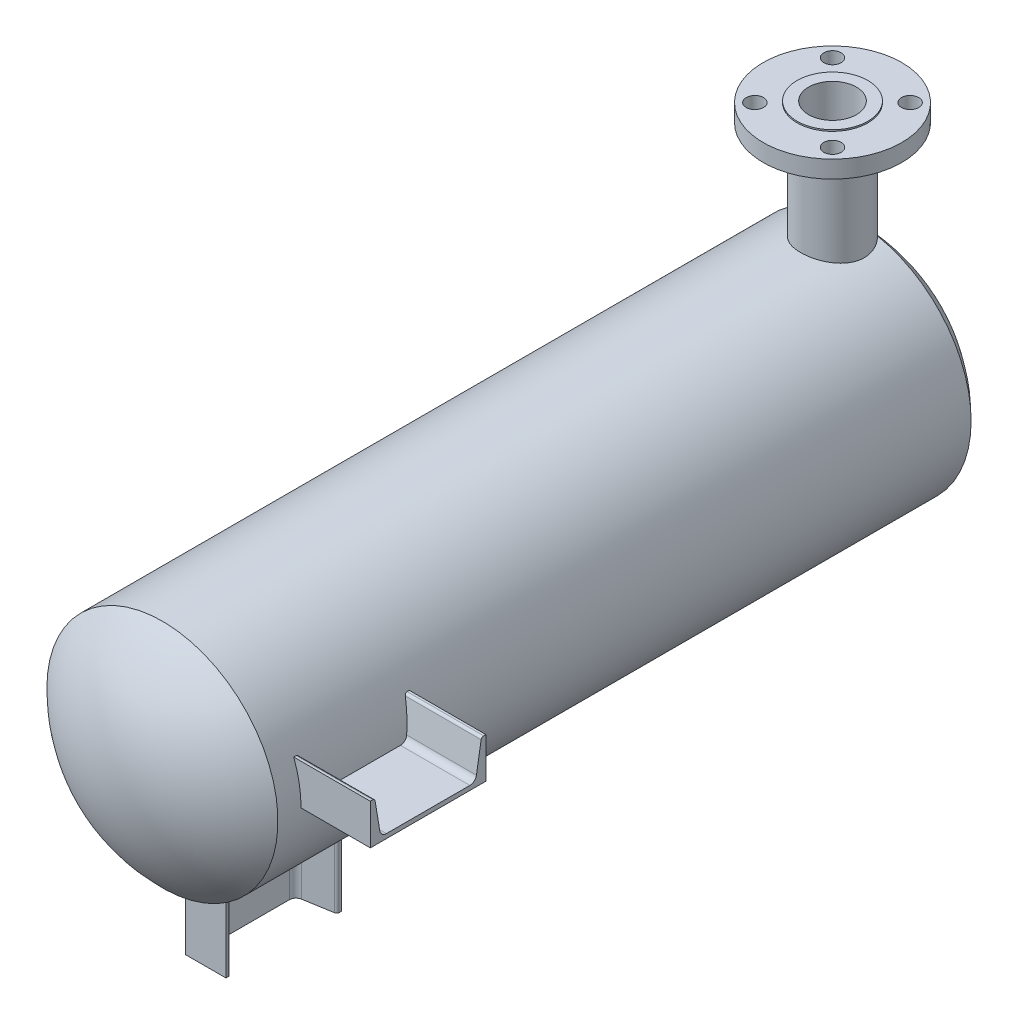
ISO-10303-21;
HEADER;
FILE_DESCRIPTION(('STEP AP214'),'2;1');
FILE_NAME('part.step','',(''),(''),'','','');
FILE_SCHEMA(('AUTOMOTIVE_DESIGN { 1 0 10303 214 1 1 1 1 }'));
ENDSEC;
DATA;
#1=APPLICATION_CONTEXT('core data for automotive mechanical design processes');
#2=APPLICATION_PROTOCOL_DEFINITION('international standard','automotive_design',2000,#1);
#3=PRODUCT_CONTEXT('',#1,'mechanical');
#4=PRODUCT('Part','Part','',(#3));
#5=PRODUCT_RELATED_PRODUCT_CATEGORY('part','',(#4));
#6=PRODUCT_DEFINITION_FORMATION('','',#4);
#7=PRODUCT_DEFINITION_CONTEXT('part definition',#1,'design');
#8=PRODUCT_DEFINITION('design','',#6,#7);
#9=PRODUCT_DEFINITION_SHAPE('','',#8);
#10=(LENGTH_UNIT() NAMED_UNIT(*) SI_UNIT(.MILLI.,.METRE.));
#11=(NAMED_UNIT(*) PLANE_ANGLE_UNIT() SI_UNIT($,.RADIAN.));
#12=(NAMED_UNIT(*) SI_UNIT($,.STERADIAN.) SOLID_ANGLE_UNIT());
#13=UNCERTAINTY_MEASURE_WITH_UNIT(LENGTH_MEASURE(1.E-05),#10,'distance_accuracy_value','');
#14=(GEOMETRIC_REPRESENTATION_CONTEXT(3) GLOBAL_UNCERTAINTY_ASSIGNED_CONTEXT((#13)) GLOBAL_UNIT_ASSIGNED_CONTEXT((#10,
#11,#12)) REPRESENTATION_CONTEXT('',''));
#15=CARTESIAN_POINT('',(0.,0.,0.));
#16=DIRECTION('',(0.,0.,1.));
#17=DIRECTION('',(1.,0.,0.));
#18=AXIS2_PLACEMENT_3D('',#15,#16,#17);
#19=CARTESIAN_POINT('',(0.,0.,-434.365921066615));
#20=DIRECTION('',(0.,0.,-1.));
#21=DIRECTION('',(-1.,0.,0.));
#22=AXIS2_PLACEMENT_3D('',#19,#20,#21);
#23=CYLINDRICAL_SURFACE('',#22,127.);
#24=DIRECTION('',(0.,0.,-1.));
#25=VECTOR('',#24,1.);
#26=CARTESIAN_POINT('',(44.4499999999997,-118.96721186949,-434.365921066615));
#27=LINE('',#26,#25);
#28=CARTESIAN_POINT('',(44.4499999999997,-118.96721186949,231.058914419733));
#29=VERTEX_POINT('',#28);
#30=CARTESIAN_POINT('',(44.4499999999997,-118.96721186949,228.6));
#31=VERTEX_POINT('',#30);
#32=EDGE_CURVE('E390',#29,#31,#27,.T.);
#33=ORIENTED_EDGE('',*,*,#32,.T.);
#34=CARTESIAN_POINT('',(0.,0.,228.6));
#35=DIRECTION('',(0.,0.,1.));
#36=DIRECTION('',(1.,0.,0.));
#37=AXIS2_PLACEMENT_3D('',#34,#35,#36);
#38=CIRCLE('',#37,127.);
#39=CARTESIAN_POINT('',(-3.02419805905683E-13,-127.,228.6));
#40=VERTEX_POINT('',#39);
#41=EDGE_CURVE('E214',#31,#40,#38,.F.);
#42=ORIENTED_EDGE('',*,*,#41,.T.);
#43=DIRECTION('',(0.,0.,-1.));
#44=VECTOR('',#43,1.);
#45=CARTESIAN_POINT('',(-3.02419805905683E-13,-127.,-434.365921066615));
#46=LINE('',#45,#44);
#47=CARTESIAN_POINT('',(-3.02419805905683E-13,-127.,355.6));
#48=VERTEX_POINT('',#47);
#49=EDGE_CURVE('E314',#40,#48,#46,.F.);
#50=ORIENTED_EDGE('',*,*,#49,.T.);
#51=CARTESIAN_POINT('',(0.,0.,355.6));
#52=DIRECTION('',(0.,0.,-1.));
#53=DIRECTION('',(-1.,0.,0.));
#54=AXIS2_PLACEMENT_3D('',#51,#52,#53);
#55=CIRCLE('',#54,127.);
#56=CARTESIAN_POINT('',(44.4499999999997,-118.96721186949,355.6));
#57=VERTEX_POINT('',#56);
#58=EDGE_CURVE('E317',#48,#57,#55,.F.);
#59=ORIENTED_EDGE('',*,*,#58,.T.);
#60=DIRECTION('',(0.,0.,-1.));
#61=VECTOR('',#60,1.);
#62=CARTESIAN_POINT('',(44.4499999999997,-118.96721186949,-434.365921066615));
#63=LINE('',#62,#61);
#64=CARTESIAN_POINT('',(44.4499999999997,-118.96721186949,353.141085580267));
#65=VERTEX_POINT('',#64);
#66=EDGE_CURVE('E320',#57,#65,#63,.T.);
#67=ORIENTED_EDGE('',*,*,#66,.T.);
#68=CARTESIAN_POINT('',(38.8619999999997,-120.908002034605,353.141085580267));
#69=CARTESIAN_POINT('',(38.8620076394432,-120.907999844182,353.292350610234));
#70=CARTESIAN_POINT('',(38.8743357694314,-120.904039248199,353.44373304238));
#71=CARTESIAN_POINT('',(38.9232381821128,-120.88830448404,353.742235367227));
#72=CARTESIAN_POINT('',(38.9598431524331,-120.876520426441,353.889349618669));
#73=CARTESIAN_POINT('',(39.0559167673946,-120.845512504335,354.174838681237));
#74=CARTESIAN_POINT('',(39.1153523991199,-120.826299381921,354.313225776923));
#75=CARTESIAN_POINT('',(39.2550138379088,-120.780997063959,354.577776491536));
#76=CARTESIAN_POINT('',(39.3352358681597,-120.754909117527,354.703942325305));
#77=CARTESIAN_POINT('',(39.5156203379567,-120.696001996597,354.943336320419));
#78=CARTESIAN_POINT('',(39.6161413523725,-120.663061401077,355.056263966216));
#79=CARTESIAN_POINT('',(39.8329670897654,-120.591657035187,355.263705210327));
#80=CARTESIAN_POINT('',(39.9492752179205,-120.553192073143,355.358214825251));
#81=CARTESIAN_POINT('',(40.1999552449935,-120.46983771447,355.530764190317));
#82=CARTESIAN_POINT('',(40.3349096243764,-120.424735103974,355.60785430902));
#83=CARTESIAN_POINT('',(40.6145801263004,-120.330701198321,355.738335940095));
#84=CARTESIAN_POINT('',(40.7592986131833,-120.281768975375,355.791721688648));
#85=CARTESIAN_POINT('',(41.061927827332,-120.178803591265,355.875929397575));
#86=CARTESIAN_POINT('',(41.2201374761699,-120.124637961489,355.905516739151));
#87=CARTESIAN_POINT('',(41.5387863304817,-120.014822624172,355.937216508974));
#88=CARTESIAN_POINT('',(41.6992260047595,-119.959172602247,355.939323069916));
#89=CARTESIAN_POINT('',(42.0235030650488,-119.84596635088,355.915735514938));
#90=CARTESIAN_POINT('',(42.1872726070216,-119.788409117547,355.889101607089));
#91=CARTESIAN_POINT('',(42.5080896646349,-119.67494008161,355.807130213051));
#92=CARTESIAN_POINT('',(42.6651365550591,-119.619028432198,355.75179006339));
#93=CARTESIAN_POINT('',(42.9680437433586,-119.510556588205,355.613477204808));
#94=CARTESIAN_POINT('',(43.1138934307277,-119.457999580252,355.530478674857));
#95=CARTESIAN_POINT('',(43.3895729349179,-119.358143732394,355.338661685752));
#96=CARTESIAN_POINT('',(43.5194054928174,-119.310843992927,355.229847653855));
#97=CARTESIAN_POINT('',(43.7538679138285,-119.225056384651,354.993655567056));
#98=CARTESIAN_POINT('',(43.8592686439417,-119.186301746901,354.867141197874));
#99=CARTESIAN_POINT('',(44.0469840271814,-119.117056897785,354.596002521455));
#100=CARTESIAN_POINT('',(44.1293083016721,-119.08656324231,354.451385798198));
#101=CARTESIAN_POINT('',(44.2631467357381,-119.036879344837,354.157762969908));
#102=CARTESIAN_POINT('',(44.3162493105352,-119.017107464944,354.009579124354));
#103=CARTESIAN_POINT('',(44.3969086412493,-118.987042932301,353.705504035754));
#104=CARTESIAN_POINT('',(44.4244748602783,-118.976746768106,353.54961567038));
#105=CARTESIAN_POINT('',(44.4521351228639,-118.96641493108,353.243365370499));
#106=CARTESIAN_POINT('',(44.4535940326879,-118.965869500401,353.093142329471));
#107=CARTESIAN_POINT('',(44.4324717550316,-118.973760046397,352.794650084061));
#108=CARTESIAN_POINT('',(44.4098935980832,-118.982194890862,352.646380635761));
#109=CARTESIAN_POINT('',(44.3420991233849,-119.007476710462,352.358203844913));
#110=CARTESIAN_POINT('',(44.2972198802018,-119.02419842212,352.218205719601));
#111=CARTESIAN_POINT('',(44.1866341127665,-119.065296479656,351.947914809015));
#112=CARTESIAN_POINT('',(44.1209255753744,-119.089673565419,351.817622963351));
#113=CARTESIAN_POINT('',(43.9687383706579,-119.145947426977,351.566326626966));
#114=CARTESIAN_POINT('',(43.8817214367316,-119.178038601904,351.4456923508));
#115=CARTESIAN_POINT('',(43.6907564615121,-119.248178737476,351.220670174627));
#116=CARTESIAN_POINT('',(43.586804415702,-119.286229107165,351.116286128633));
#117=CARTESIAN_POINT('',(43.3587235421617,-119.369328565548,350.920501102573));
#118=CARTESIAN_POINT('',(43.2337919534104,-119.41464988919,350.830151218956));
#119=CARTESIAN_POINT('',(42.9719064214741,-119.509140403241,350.6716168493));
#120=CARTESIAN_POINT('',(42.8349491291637,-119.558310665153,350.603438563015));
#121=CARTESIAN_POINT('',(42.54441409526,-119.662015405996,350.487217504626));
#122=CARTESIAN_POINT('',(42.3903334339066,-119.716695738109,350.44055985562));
#123=CARTESIAN_POINT('',(42.0768549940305,-119.82723359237,350.374319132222));
#124=CARTESIAN_POINT('',(41.9174560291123,-119.883091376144,350.354742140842));
#125=CARTESIAN_POINT('',(41.592019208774,-119.996394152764,350.342916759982));
#126=CARTESIAN_POINT('',(41.4259413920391,-120.053827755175,350.351630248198));
#127=CARTESIAN_POINT('',(41.0972830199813,-120.166732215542,350.398490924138));
#128=CARTESIAN_POINT('',(40.9347026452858,-120.22220297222,350.436639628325));
#129=CARTESIAN_POINT('',(40.6183160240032,-120.329465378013,350.541596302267));
#130=CARTESIAN_POINT('',(40.4644862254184,-120.381267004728,350.608322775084));
#131=CARTESIAN_POINT('',(40.1700263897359,-120.479845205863,350.769074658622));
#132=CARTESIAN_POINT('',(40.029393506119,-120.526622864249,350.863094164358));
#133=CARTESIAN_POINT('',(39.7710541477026,-120.612110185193,351.072264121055));
#134=CARTESIAN_POINT('',(39.6526963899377,-120.65105268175,351.186513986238));
#135=CARTESIAN_POINT('',(39.4369885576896,-120.721733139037,351.435356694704));
#136=CARTESIAN_POINT('',(39.3396375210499,-120.75347142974,351.569948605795));
#137=CARTESIAN_POINT('',(39.1741178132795,-120.807266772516,351.848193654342));
#138=CARTESIAN_POINT('',(39.1047126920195,-120.829735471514,351.99103298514));
#139=CARTESIAN_POINT('',(38.9909707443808,-120.866487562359,352.287195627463));
#140=CARTESIAN_POINT('',(38.9465927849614,-120.880784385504,352.440501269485));
#141=CARTESIAN_POINT('',(38.897781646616,-120.896496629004,352.686084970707));
#142=CARTESIAN_POINT('',(38.8843841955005,-120.900805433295,352.776495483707));
#143=CARTESIAN_POINT('',(38.86649115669,-120.906558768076,352.958284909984));
#144=CARTESIAN_POINT('',(38.8619953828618,-120.908003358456,353.049663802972));
#145=CARTESIAN_POINT('',(38.8619999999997,-120.908002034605,353.141085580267));
#146=B_SPLINE_CURVE_WITH_KNOTS('',3,(#68,#69,#70,#71,#72,#73,#74,#75,#76,#77,#78,#79,#80,#81,
#82,#83,#84,#85,#86,#87,#88,#89,#90,#91,#92,#93,#94,#95,#96,#97,#98,#99,#100,#101,#102,#103,
#104,#105,#106,#107,#108,#109,#110,#111,#112,#113,#114,#115,#116,#117,#118,#119,#120,#121,#122,
#123,#124,#125,#126,#127,#128,#129,#130,#131,#132,#133,#134,#135,#136,#137,#138,#139,#140,#141,
#142,#143,#144,#145),.UNSPECIFIED.,.T.,.F.,(4,2,2,2,2,2,2,2,2,2,2,2,2,2,2,2,2,2,2,2,2,2,2,2,2,2,
2,2,2,2,2,2,2,2,2,2,2,2,4),(0.,0.453452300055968,0.90747889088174,1.3608514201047,
1.81414163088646,2.27627750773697,2.73851322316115,3.22186530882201,3.70533485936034,
4.21250857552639,4.71979057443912,5.24417735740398,5.76861280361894,6.29353922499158,
6.81837568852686,7.32324635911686,7.82790621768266,8.30140826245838,8.77473476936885,
9.22323943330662,9.67168755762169,10.1135547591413,10.5554646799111,11.0099609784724,
11.4645649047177,11.9445657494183,12.4247006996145,12.9324762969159,13.4403659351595,
13.9657023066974,14.4910657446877,15.0149408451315,15.5387026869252,16.0432715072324,
16.54781721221,17.0265954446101,17.5045844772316,17.7786483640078,18.052706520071),.UNSPECIFIED.);
#147=CARTESIAN_POINT('',(42.1153633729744,-119.813589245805,350.385106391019));
#148=VERTEX_POINT('',#147);
#149=EDGE_CURVE('E323',#65,#148,#146,.T.);
#150=ORIENTED_EDGE('',*,*,#149,.T.);
#151=CARTESIAN_POINT('',(0.,0.,343.365367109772));
#152=DIRECTION('',(-0.164410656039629,0.,0.986391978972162));
#153=DIRECTION('',(-0.986391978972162,0.,-0.164410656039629));
#154=AXIS2_PLACEMENT_3D('',#151,#152,#153);
#155=ELLIPSE('',#154,128.752060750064,127.);
#156=CARTESIAN_POINT('',(10.9809511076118,-126.524379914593,345.195659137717));
#157=VERTEX_POINT('',#156);
#158=EDGE_CURVE('E330',#148,#157,#155,.F.);
#159=ORIENTED_EDGE('',*,*,#158,.T.);
#160=CARTESIAN_POINT('',(4.82599999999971,-126.908272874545,337.929895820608));
#161=CARTESIAN_POINT('',(4.82599834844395,-126.908272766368,337.723104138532));
#162=CARTESIAN_POINT('',(4.8347115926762,-126.907942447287,337.516339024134));
#163=CARTESIAN_POINT('',(4.86950294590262,-126.90661233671,337.104209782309));
#164=CARTESIAN_POINT('',(4.89558548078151,-126.90561237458,336.898846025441));
#165=CARTESIAN_POINT('',(4.96496555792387,-126.90291690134,336.490873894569));
#166=CARTESIAN_POINT('',(5.00827788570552,-126.901220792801,336.288268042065));
#167=CARTESIAN_POINT('',(5.11182604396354,-126.897091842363,335.887355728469));
#168=CARTESIAN_POINT('',(5.17206805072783,-126.894658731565,335.68905086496));
#169=CARTESIAN_POINT('',(5.30898126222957,-126.889004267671,335.298391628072));
#170=CARTESIAN_POINT('',(5.38563889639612,-126.885783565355,335.106032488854));
#171=CARTESIAN_POINT('',(5.55489538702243,-126.878486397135,334.72839165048));
#172=CARTESIAN_POINT('',(5.6475001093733,-126.874409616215,334.543112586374));
#173=CARTESIAN_POINT('',(5.84792372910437,-126.86532954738,334.181104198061));
#174=CARTESIAN_POINT('',(5.95573597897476,-126.860326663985,334.004371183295));
#175=CARTESIAN_POINT('',(6.18583386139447,-126.849315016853,333.660621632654));
#176=CARTESIAN_POINT('',(6.30811971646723,-126.84330623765,333.493605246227));
#177=CARTESIAN_POINT('',(6.56628105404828,-126.830204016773,333.170483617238));
#178=CARTESIAN_POINT('',(6.70215604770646,-126.823110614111,333.014377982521));
#179=CARTESIAN_POINT('',(6.9865265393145,-126.807762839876,332.714174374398));
#180=CARTESIAN_POINT('',(7.13502233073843,-126.799508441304,332.570076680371));
#181=CARTESIAN_POINT('',(7.44354076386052,-126.781771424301,332.294932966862));
#182=CARTESIAN_POINT('',(7.60356165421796,-126.772288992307,332.163884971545));
#183=CARTESIAN_POINT('',(7.93405741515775,-126.752034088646,331.915695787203));
#184=CARTESIAN_POINT('',(8.10453588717,-126.741261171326,331.798559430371));
#185=CARTESIAN_POINT('',(8.45465652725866,-126.718386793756,331.579076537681));
#186=CARTESIAN_POINT('',(8.63429792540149,-126.706285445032,331.476728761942));
#187=CARTESIAN_POINT('',(9.00153596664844,-126.680725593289,331.287488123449));
#188=CARTESIAN_POINT('',(9.18913551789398,-126.667266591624,331.200600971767));
#189=CARTESIAN_POINT('',(9.57081331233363,-126.63899926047,331.042955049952));
#190=CARTESIAN_POINT('',(9.76488915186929,-126.624191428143,330.972190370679));
#191=CARTESIAN_POINT('',(10.1582717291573,-126.593240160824,330.847204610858));
#192=CARTESIAN_POINT('',(10.3575803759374,-126.577096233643,330.792989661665));
#193=CARTESIAN_POINT('',(10.7603120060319,-126.543496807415,330.701414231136));
#194=CARTESIAN_POINT('',(10.963741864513,-126.526038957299,330.66408484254));
#195=CARTESIAN_POINT('',(11.3729850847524,-126.489910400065,330.606652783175));
#196=CARTESIAN_POINT('',(11.5787992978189,-126.471239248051,330.586556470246));
#197=CARTESIAN_POINT('',(11.9912280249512,-126.43280147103,330.563739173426));
#198=CARTESIAN_POINT('',(12.197842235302,-126.413035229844,330.561012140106));
#199=CARTESIAN_POINT('',(12.6104978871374,-126.372538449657,330.572892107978));
#200=CARTESIAN_POINT('',(12.8165390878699,-126.351807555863,330.587505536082));
#201=CARTESIAN_POINT('',(13.4334448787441,-126.288214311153,330.657470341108));
#202=CARTESIAN_POINT('',(13.841529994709,-126.244097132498,330.739031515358));
#203=CARTESIAN_POINT('',(14.6378224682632,-126.154251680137,330.969438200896));
#204=CARTESIAN_POINT('',(15.0260290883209,-126.108523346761,331.118286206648));
#205=CARTESIAN_POINT('',(15.7737980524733,-126.017180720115,331.47994486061));
#206=CARTESIAN_POINT('',(16.133216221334,-125.971567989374,331.693054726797));
#207=CARTESIAN_POINT('',(16.8111265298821,-125.882894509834,332.177059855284));
#208=CARTESIAN_POINT('',(17.129618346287,-125.839833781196,332.447955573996));
#209=CARTESIAN_POINT('',(17.7164019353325,-125.758566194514,333.039856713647));
#210=CARTESIAN_POINT('',(17.9847233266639,-125.720356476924,333.360832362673));
#211=CARTESIAN_POINT('',(18.4635271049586,-125.650932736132,334.044038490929));
#212=CARTESIAN_POINT('',(18.6740120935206,-125.619718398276,334.40626711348));
#213=CARTESIAN_POINT('',(19.0293686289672,-125.566378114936,335.158611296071));
#214=CARTESIAN_POINT('',(19.1747578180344,-125.54418060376,335.548477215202));
#215=CARTESIAN_POINT('',(19.3979738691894,-125.509886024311,336.347513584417));
#216=CARTESIAN_POINT('',(19.4758053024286,-125.497788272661,336.756682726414));
#217=CARTESIAN_POINT('',(19.5610620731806,-125.484527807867,337.578209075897));
#218=CARTESIAN_POINT('',(19.5692015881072,-125.483254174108,337.990490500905));
#219=CARTESIAN_POINT('',(19.5166998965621,-125.491430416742,338.810532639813));
#220=CARTESIAN_POINT('',(19.4560606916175,-125.500879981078,339.218293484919));
#221=CARTESIAN_POINT('',(19.2681929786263,-125.529859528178,340.016250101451));
#222=CARTESIAN_POINT('',(19.1412017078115,-125.549353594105,340.406503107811));
#223=CARTESIAN_POINT('',(18.8245533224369,-125.597220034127,341.160105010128));
#224=CARTESIAN_POINT('',(18.6348943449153,-125.62559267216,341.523453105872));
#225=CARTESIAN_POINT('',(18.1970334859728,-125.689765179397,342.215483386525));
#226=CARTESIAN_POINT('',(17.9484681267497,-125.725610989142,342.543931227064));
#227=CARTESIAN_POINT('',(17.4005335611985,-125.802614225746,343.154588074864));
#228=CARTESIAN_POINT('',(17.1011613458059,-125.843771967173,343.436794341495));
#229=CARTESIAN_POINT('',(16.4566570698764,-125.929683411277,343.950048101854));
#230=CARTESIAN_POINT('',(16.1110774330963,-125.974470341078,344.180527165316));
#231=CARTESIAN_POINT('',(15.3860284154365,-126.065074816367,344.580254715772));
#232=CARTESIAN_POINT('',(15.00655773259,-126.110892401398,344.749500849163));
#233=CARTESIAN_POINT('',(14.4191997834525,-126.178945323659,344.954218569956));
#234=CARTESIAN_POINT('',(14.219638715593,-126.201597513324,345.014392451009));
#235=CARTESIAN_POINT('',(13.8161062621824,-126.246411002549,345.117630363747));
#236=CARTESIAN_POINT('',(13.6121365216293,-126.268572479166,345.160700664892));
#237=CARTESIAN_POINT('',(13.2011448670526,-126.312202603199,345.229418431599));
#238=CARTESIAN_POINT('',(12.9941218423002,-126.333670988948,345.255059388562));
#239=CARTESIAN_POINT('',(12.5786317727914,-126.375716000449,345.288692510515));
#240=CARTESIAN_POINT('',(12.3701652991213,-126.396292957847,345.296691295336));
#241=CARTESIAN_POINT('',(11.9534033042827,-126.436386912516,345.294976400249));
#242=CARTESIAN_POINT('',(11.7451078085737,-126.455904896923,345.285279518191));
#243=CARTESIAN_POINT('',(11.3300604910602,-126.493767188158,345.248256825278));
#244=CARTESIAN_POINT('',(11.1233081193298,-126.512111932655,345.220937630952));
#245=CARTESIAN_POINT('',(10.7126855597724,-126.547543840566,345.148832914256));
#246=CARTESIAN_POINT('',(10.5088164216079,-126.564630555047,345.104041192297));
#247=CARTESIAN_POINT('',(10.1055894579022,-126.597464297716,344.9973087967));
#248=CARTESIAN_POINT('',(9.90622995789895,-126.613211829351,344.935374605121));
#249=CARTESIAN_POINT('',(9.51434879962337,-126.643261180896,344.795115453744));
#250=CARTESIAN_POINT('',(9.32179863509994,-126.657569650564,344.716871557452));
#251=CARTESIAN_POINT('',(8.94398385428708,-126.684809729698,344.544384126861));
#252=CARTESIAN_POINT('',(8.75871668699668,-126.697741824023,344.450146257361));
#253=CARTESIAN_POINT('',(8.39671565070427,-126.722247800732,344.246297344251));
#254=CARTESIAN_POINT('',(8.21998290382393,-126.733821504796,344.136684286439));
#255=CARTESIAN_POINT('',(7.8763647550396,-126.755640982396,343.90287100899));
#256=CARTESIAN_POINT('',(7.70947909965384,-126.765886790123,343.77867116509));
#257=CARTESIAN_POINT('',(7.38745011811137,-126.785060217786,343.517122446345));
#258=CARTESIAN_POINT('',(7.23225991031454,-126.793993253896,343.379831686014));
#259=CARTESIAN_POINT('',(6.93396323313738,-126.810655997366,343.092634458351));
#260=CARTESIAN_POINT('',(6.79085655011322,-126.818385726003,342.942728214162));
#261=CARTESIAN_POINT('',(6.51769735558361,-126.832717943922,342.631296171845));
#262=CARTESIAN_POINT('',(6.38765043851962,-126.839319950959,342.469765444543));
#263=CARTESIAN_POINT('',(6.14166322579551,-126.851468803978,342.136353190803));
#264=CARTESIAN_POINT('',(6.02571773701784,-126.857016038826,341.964475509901));
#265=CARTESIAN_POINT('',(5.80878431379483,-126.867134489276,341.611657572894));
#266=CARTESIAN_POINT('',(5.70778645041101,-126.871706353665,341.4307234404));
#267=CARTESIAN_POINT('',(5.52141528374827,-126.879953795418,341.06104427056));
#268=CARTESIAN_POINT('',(5.43603626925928,-126.883629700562,340.872302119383));
#269=CARTESIAN_POINT('',(5.28153498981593,-126.890154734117,340.488448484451));
#270=CARTESIAN_POINT('',(5.21239880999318,-126.893004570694,340.293342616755));
#271=CARTESIAN_POINT('',(5.09080030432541,-126.897941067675,339.898061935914));
#272=CARTESIAN_POINT('',(5.038333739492,-126.900027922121,339.697888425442));
#273=CARTESIAN_POINT('',(4.93847476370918,-126.903958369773,339.238882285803));
#274=CARTESIAN_POINT('',(4.89633380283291,-126.90558182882,338.97888847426));
#275=CARTESIAN_POINT('',(4.84009746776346,-126.907739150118,338.455880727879));
#276=CARTESIAN_POINT('',(4.82600210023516,-126.908273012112,338.192866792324));
#277=CARTESIAN_POINT('',(4.82599999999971,-126.908272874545,337.929895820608));
#278=B_SPLINE_CURVE_WITH_KNOTS('',3,(#160,#161,#162,#163,#164,#165,#166,#167,#168,#169,#170,
#171,#172,#173,#174,#175,#176,#177,#178,#179,#180,#181,#182,#183,#184,#185,#186,#187,#188,#189,
#190,#191,#192,#193,#194,#195,#196,#197,#198,#199,#200,#201,#202,#203,#204,#205,#206,#207,#208,
#209,#210,#211,#212,#213,#214,#215,#216,#217,#218,#219,#220,#221,#222,#223,#224,#225,#226,#227,
#228,#229,#230,#231,#232,#233,#234,#235,#236,#237,#238,#239,#240,#241,#242,#243,#244,#245,#246,
#247,#248,#249,#250,#251,#252,#253,#254,#255,#256,#257,#258,#259,#260,#261,#262,#263,#264,#265,
#266,#267,#268,#269,#270,#271,#272,#273,#274,#275,#276,#277),.UNSPECIFIED.,.T.,.F.,(4,2,2,2,2,2,
2,2,2,2,2,2,2,2,2,2,2,2,2,2,2,2,2,2,2,2,2,2,2,2,2,2,2,2,2,2,2,2,2,2,2,2,2,2,2,2,2,2,2,2,2,2,2,2,
2,2,2,2,4),(0.,0.620145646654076,1.24044937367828,1.86128655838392,2.48235053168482,
3.10290304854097,3.72368431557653,4.34419506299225,4.96471535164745,5.58521332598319,
6.20572573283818,6.82614404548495,7.4467772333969,8.06735835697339,8.68816824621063,
9.30875023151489,9.92956185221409,10.5515120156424,11.1736915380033,11.7956543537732,
12.4178477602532,13.6668880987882,14.9159747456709,16.1709696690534,17.4259745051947,
18.6802360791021,19.9344412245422,21.1784876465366,22.4224498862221,23.6536490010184,
24.8848122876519,26.1116034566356,27.3384310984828,28.5730354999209,29.8077130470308,
31.0553579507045,32.3030508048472,32.9314271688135,33.5595729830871,34.1879532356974,
34.8160976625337,35.443646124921,36.0709591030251,36.6984948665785,37.3257936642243,
37.9500459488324,38.5740775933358,39.1981910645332,39.8222884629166,40.4437339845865,
41.0651685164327,41.6868681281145,42.3083380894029,42.9293933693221,43.5502210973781,
44.1705150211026,44.7906510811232,45.5792720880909,46.3678932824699),.UNSPECIFIED.);
#279=CARTESIAN_POINT('',(4.82599999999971,-126.908272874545,337.929895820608));
#280=VERTEX_POINT('',#279);
#281=EDGE_CURVE('E351',#157,#280,#278,.T.);
#282=ORIENTED_EDGE('',*,*,#281,.T.);
#283=DIRECTION('',(0.,0.,-1.));
#284=VECTOR('',#283,1.);
#285=CARTESIAN_POINT('',(4.8259999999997,-126.908272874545,-434.365921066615));
#286=LINE('',#285,#284);
#287=CARTESIAN_POINT('',(4.8259999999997,-126.908272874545,246.270104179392));
#288=VERTEX_POINT('',#287);
#289=EDGE_CURVE('E357',#280,#288,#286,.T.);
#290=ORIENTED_EDGE('',*,*,#289,.T.);
#291=CARTESIAN_POINT('',(4.82599999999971,-126.908272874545,246.270104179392));
#292=CARTESIAN_POINT('',(4.82599834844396,-126.908272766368,246.063312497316));
#293=CARTESIAN_POINT('',(4.83471159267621,-126.907942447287,245.856547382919));
#294=CARTESIAN_POINT('',(4.86950294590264,-126.90661233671,245.444418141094));
#295=CARTESIAN_POINT('',(4.89558548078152,-126.90561237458,245.239054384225));
#296=CARTESIAN_POINT('',(4.96496555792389,-126.90291690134,244.831082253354));
#297=CARTESIAN_POINT('',(5.00827788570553,-126.901220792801,244.628476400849));
#298=CARTESIAN_POINT('',(5.11182604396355,-126.897091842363,244.227564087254));
#299=CARTESIAN_POINT('',(5.17206805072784,-126.894658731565,244.029259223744));
#300=CARTESIAN_POINT('',(5.3089812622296,-126.889004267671,243.638599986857));
#301=CARTESIAN_POINT('',(5.38563889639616,-126.885783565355,243.446240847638));
#302=CARTESIAN_POINT('',(5.55489538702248,-126.878486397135,243.068600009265));
#303=CARTESIAN_POINT('',(5.64750010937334,-126.874409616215,242.883320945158));
#304=CARTESIAN_POINT('',(5.84792372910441,-126.86532954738,242.521312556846));
#305=CARTESIAN_POINT('',(5.95573597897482,-126.860326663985,242.344579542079));
#306=CARTESIAN_POINT('',(6.18583386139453,-126.849315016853,242.000829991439));
#307=CARTESIAN_POINT('',(6.30811971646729,-126.84330623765,241.833813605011));
#308=CARTESIAN_POINT('',(6.56628105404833,-126.830204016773,241.510691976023));
#309=CARTESIAN_POINT('',(6.70215604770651,-126.823110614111,241.354586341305));
#310=CARTESIAN_POINT('',(6.98652653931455,-126.807762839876,241.054382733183));
#311=CARTESIAN_POINT('',(7.13502233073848,-126.799508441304,240.910285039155));
#312=CARTESIAN_POINT('',(7.44354076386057,-126.781771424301,240.635141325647));
#313=CARTESIAN_POINT('',(7.60356165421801,-126.772288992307,240.504093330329));
#314=CARTESIAN_POINT('',(7.93405741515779,-126.752034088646,240.255904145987));
#315=CARTESIAN_POINT('',(8.10453588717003,-126.741261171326,240.138767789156));
#316=CARTESIAN_POINT('',(8.4546565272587,-126.718386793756,239.919284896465));
#317=CARTESIAN_POINT('',(8.63429792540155,-126.706285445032,239.816937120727));
#318=CARTESIAN_POINT('',(9.00153596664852,-126.680725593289,239.627696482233));
#319=CARTESIAN_POINT('',(9.18913551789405,-126.667266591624,239.540809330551));
#320=CARTESIAN_POINT('',(9.57081331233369,-126.63899926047,239.383163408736));
#321=CARTESIAN_POINT('',(9.76488915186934,-126.624191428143,239.312398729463));
#322=CARTESIAN_POINT('',(10.1582717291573,-126.593240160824,239.187412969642));
#323=CARTESIAN_POINT('',(10.3575803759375,-126.577096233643,239.13319802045));
#324=CARTESIAN_POINT('',(10.7603120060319,-126.543496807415,239.04162258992));
#325=CARTESIAN_POINT('',(10.9637418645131,-126.526038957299,239.004293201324));
#326=CARTESIAN_POINT('',(11.3729850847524,-126.489910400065,238.946861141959));
#327=CARTESIAN_POINT('',(11.578799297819,-126.471239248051,238.92676482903));
#328=CARTESIAN_POINT('',(11.9912280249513,-126.43280147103,238.903947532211));
#329=CARTESIAN_POINT('',(12.1978422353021,-126.413035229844,238.901220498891));
#330=CARTESIAN_POINT('',(12.6104978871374,-126.372538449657,238.913100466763));
#331=CARTESIAN_POINT('',(12.8165390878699,-126.351807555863,238.927713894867));
#332=CARTESIAN_POINT('',(13.4334448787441,-126.288214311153,238.997678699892));
#333=CARTESIAN_POINT('',(13.841529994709,-126.244097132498,239.079239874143));
#334=CARTESIAN_POINT('',(14.6378224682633,-126.154251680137,239.309646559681));
#335=CARTESIAN_POINT('',(15.0260290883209,-126.108523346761,239.458494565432));
#336=CARTESIAN_POINT('',(15.7737980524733,-126.017180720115,239.820153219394));
#337=CARTESIAN_POINT('',(16.133216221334,-125.971567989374,240.033263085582));
#338=CARTESIAN_POINT('',(16.8111265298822,-125.882894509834,240.517268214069));
#339=CARTESIAN_POINT('',(17.1296183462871,-125.839833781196,240.788163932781));
#340=CARTESIAN_POINT('',(17.7164019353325,-125.758566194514,241.380065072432));
#341=CARTESIAN_POINT('',(17.9847233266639,-125.720356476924,241.701040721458));
#342=CARTESIAN_POINT('',(18.4635271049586,-125.650932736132,242.384246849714));
#343=CARTESIAN_POINT('',(18.6740120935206,-125.619718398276,242.746475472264));
#344=CARTESIAN_POINT('',(19.0293686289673,-125.566378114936,243.498819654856));
#345=CARTESIAN_POINT('',(19.1747578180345,-125.54418060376,243.888685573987));
#346=CARTESIAN_POINT('',(19.3979738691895,-125.509886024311,244.687721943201));
#347=CARTESIAN_POINT('',(19.4758053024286,-125.497788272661,245.096891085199));
#348=CARTESIAN_POINT('',(19.5610620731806,-125.484527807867,245.918417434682));
#349=CARTESIAN_POINT('',(19.5692015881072,-125.483254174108,246.330698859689));
#350=CARTESIAN_POINT('',(19.5166998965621,-125.491430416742,247.150740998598));
#351=CARTESIAN_POINT('',(19.4560606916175,-125.500879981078,247.558501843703));
#352=CARTESIAN_POINT('',(19.2681929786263,-125.529859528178,248.356458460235));
#353=CARTESIAN_POINT('',(19.1412017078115,-125.549353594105,248.746711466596));
#354=CARTESIAN_POINT('',(18.8245533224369,-125.597220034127,249.500313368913));
#355=CARTESIAN_POINT('',(18.6348943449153,-125.62559267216,249.863661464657));
#356=CARTESIAN_POINT('',(18.1970334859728,-125.689765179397,250.555691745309));
#357=CARTESIAN_POINT('',(17.9484681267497,-125.725610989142,250.884139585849));
#358=CARTESIAN_POINT('',(17.4005335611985,-125.802614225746,251.494796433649));
#359=CARTESIAN_POINT('',(17.1011613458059,-125.843771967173,251.777002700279));
#360=CARTESIAN_POINT('',(16.4566570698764,-125.929683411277,252.290256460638));
#361=CARTESIAN_POINT('',(16.1110774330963,-125.974470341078,252.520735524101));
#362=CARTESIAN_POINT('',(15.3860284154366,-126.065074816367,252.920463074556));
#363=CARTESIAN_POINT('',(15.00655773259,-126.110892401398,253.089709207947));
#364=CARTESIAN_POINT('',(14.4191997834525,-126.178945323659,253.294426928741));
#365=CARTESIAN_POINT('',(14.2196387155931,-126.201597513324,253.354600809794));
#366=CARTESIAN_POINT('',(13.8161062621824,-126.246411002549,253.457838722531));
#367=CARTESIAN_POINT('',(13.6121365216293,-126.268572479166,253.500909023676));
#368=CARTESIAN_POINT('',(13.2011448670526,-126.312202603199,253.569626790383));
#369=CARTESIAN_POINT('',(12.9941218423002,-126.333670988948,253.595267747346));
#370=CARTESIAN_POINT('',(12.5786317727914,-126.375716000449,253.6289008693));
#371=CARTESIAN_POINT('',(12.3701652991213,-126.396292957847,253.636899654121));
#372=CARTESIAN_POINT('',(11.9534033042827,-126.436386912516,253.635184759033));
#373=CARTESIAN_POINT('',(11.7451078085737,-126.455904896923,253.625487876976));
#374=CARTESIAN_POINT('',(11.3300604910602,-126.493767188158,253.588465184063));
#375=CARTESIAN_POINT('',(11.1233081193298,-126.512111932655,253.561145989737));
#376=CARTESIAN_POINT('',(10.7126855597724,-126.547543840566,253.48904127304));
#377=CARTESIAN_POINT('',(10.5088164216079,-126.564630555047,253.444249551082));
#378=CARTESIAN_POINT('',(10.1055894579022,-126.597464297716,253.337517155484));
#379=CARTESIAN_POINT('',(9.90622995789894,-126.613211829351,253.275582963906));
#380=CARTESIAN_POINT('',(9.51434879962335,-126.643261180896,253.135323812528));
#381=CARTESIAN_POINT('',(9.32179863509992,-126.657569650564,253.057079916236));
#382=CARTESIAN_POINT('',(8.94398385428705,-126.684809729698,252.884592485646));
#383=CARTESIAN_POINT('',(8.75871668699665,-126.697741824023,252.790354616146));
#384=CARTESIAN_POINT('',(8.39671565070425,-126.722247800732,252.586505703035));
#385=CARTESIAN_POINT('',(8.21998290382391,-126.733821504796,252.476892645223));
#386=CARTESIAN_POINT('',(7.87636475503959,-126.755640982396,252.243079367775));
#387=CARTESIAN_POINT('',(7.70947909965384,-126.765886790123,252.118879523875));
#388=CARTESIAN_POINT('',(7.38745011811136,-126.785060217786,251.85733080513));
#389=CARTESIAN_POINT('',(7.23225991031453,-126.793993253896,251.720040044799));
#390=CARTESIAN_POINT('',(6.93396323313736,-126.810655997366,251.432842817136));
#391=CARTESIAN_POINT('',(6.79085655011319,-126.818385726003,251.282936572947));
#392=CARTESIAN_POINT('',(6.51769735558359,-126.832717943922,250.97150453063));
#393=CARTESIAN_POINT('',(6.38765043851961,-126.839319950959,250.809973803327));
#394=CARTESIAN_POINT('',(6.14166322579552,-126.851468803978,250.476561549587));
#395=CARTESIAN_POINT('',(6.02571773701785,-126.857016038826,250.304683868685));
#396=CARTESIAN_POINT('',(5.80878431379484,-126.867134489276,249.951865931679));
#397=CARTESIAN_POINT('',(5.707786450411,-126.871706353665,249.770931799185));
#398=CARTESIAN_POINT('',(5.52141528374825,-126.879953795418,249.401252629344));
#399=CARTESIAN_POINT('',(5.43603626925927,-126.883629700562,249.212510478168));
#400=CARTESIAN_POINT('',(5.28153498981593,-126.890154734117,248.828656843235));
#401=CARTESIAN_POINT('',(5.21239880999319,-126.893004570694,248.63355097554));
#402=CARTESIAN_POINT('',(5.09080030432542,-126.897941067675,248.238270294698));
#403=CARTESIAN_POINT('',(5.03833373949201,-126.900027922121,248.038096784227));
#404=CARTESIAN_POINT('',(4.93847476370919,-126.903958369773,247.579090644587));
#405=CARTESIAN_POINT('',(4.89633380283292,-126.90558182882,247.319096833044));
#406=CARTESIAN_POINT('',(4.84009746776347,-126.907739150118,246.796089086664));
#407=CARTESIAN_POINT('',(4.82600210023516,-126.908273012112,246.533075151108));
#408=CARTESIAN_POINT('',(4.82599999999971,-126.908272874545,246.270104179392));
#409=B_SPLINE_CURVE_WITH_KNOTS('',3,(#291,#292,#293,#294,#295,#296,#297,#298,#299,#300,#301,
#302,#303,#304,#305,#306,#307,#308,#309,#310,#311,#312,#313,#314,#315,#316,#317,#318,#319,#320,
#321,#322,#323,#324,#325,#326,#327,#328,#329,#330,#331,#332,#333,#334,#335,#336,#337,#338,#339,
#340,#341,#342,#343,#344,#345,#346,#347,#348,#349,#350,#351,#352,#353,#354,#355,#356,#357,#358,
#359,#360,#361,#362,#363,#364,#365,#366,#367,#368,#369,#370,#371,#372,#373,#374,#375,#376,#377,
#378,#379,#380,#381,#382,#383,#384,#385,#386,#387,#388,#389,#390,#391,#392,#393,#394,#395,#396,
#397,#398,#399,#400,#401,#402,#403,#404,#405,#406,#407,#408),.UNSPECIFIED.,.T.,.F.,(4,2,2,2,2,2,
2,2,2,2,2,2,2,2,2,2,2,2,2,2,2,2,2,2,2,2,2,2,2,2,2,2,2,2,2,2,2,2,2,2,2,2,2,2,2,2,2,2,2,2,2,2,2,2,
2,2,2,2,4),(0.,0.620145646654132,1.24044937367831,1.86128655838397,2.48235053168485,
3.10290304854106,3.7236843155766,4.3441950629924,4.96471535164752,5.58521332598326,
6.20572573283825,6.82614404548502,7.44677723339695,8.06735835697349,8.68816824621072,
9.30875023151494,9.92956185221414,10.5515120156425,11.1736915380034,11.7956543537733,
12.4178477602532,13.6668880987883,14.915974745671,16.1709696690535,17.4259745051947,
18.6802360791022,19.9344412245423,21.1784876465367,22.4224498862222,23.6536490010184,
24.8848122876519,26.1116034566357,27.3384310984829,28.573035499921,29.8077130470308,
31.0553579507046,32.3030508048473,32.9314271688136,33.5595729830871,34.1879532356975,
34.8160976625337,35.4436461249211,36.0709591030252,36.6984948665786,37.3257936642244,
37.9500459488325,38.5740775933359,39.1981910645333,39.8222884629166,40.4437339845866,
41.0651685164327,41.6868681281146,42.3083380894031,42.9293933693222,43.5502210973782,
44.1705150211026,44.7906510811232,45.579272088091,46.36789328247),.UNSPECIFIED.);
#410=CARTESIAN_POINT('',(10.9809511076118,-126.524379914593,239.004340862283));
#411=VERTEX_POINT('',#410);
#412=EDGE_CURVE('E360',#288,#411,#409,.T.);
#413=ORIENTED_EDGE('',*,*,#412,.T.);
#414=CARTESIAN_POINT('',(0.,0.,240.834632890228));
#415=DIRECTION('',(-0.164410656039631,0.,-0.986391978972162));
#416=DIRECTION('',(0.986391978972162,0.,-0.164410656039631));
#417=AXIS2_PLACEMENT_3D('',#414,#415,#416);
#418=ELLIPSE('',#417,128.752060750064,127.);
#419=CARTESIAN_POINT('',(42.1153633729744,-119.813589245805,233.814893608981));
#420=VERTEX_POINT('',#419);
#421=EDGE_CURVE('E366',#411,#420,#418,.F.);
#422=ORIENTED_EDGE('',*,*,#421,.T.);
#423=CARTESIAN_POINT('',(38.8619999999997,-120.908002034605,231.058914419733));
#424=CARTESIAN_POINT('',(38.8620076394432,-120.907999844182,231.2101794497));
#425=CARTESIAN_POINT('',(38.8743357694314,-120.904039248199,231.361561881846));
#426=CARTESIAN_POINT('',(38.9232381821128,-120.88830448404,231.660064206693));
#427=CARTESIAN_POINT('',(38.9598431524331,-120.876520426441,231.807178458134));
#428=CARTESIAN_POINT('',(39.0559167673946,-120.845512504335,232.092667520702));
#429=CARTESIAN_POINT('',(39.1153523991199,-120.826299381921,232.231054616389));
#430=CARTESIAN_POINT('',(39.2550138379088,-120.780997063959,232.495605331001));
#431=CARTESIAN_POINT('',(39.3352358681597,-120.754909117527,232.62177116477));
#432=CARTESIAN_POINT('',(39.5156203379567,-120.696001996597,232.861165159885));
#433=CARTESIAN_POINT('',(39.6161413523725,-120.663061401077,232.974092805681));
#434=CARTESIAN_POINT('',(39.8329670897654,-120.591657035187,233.181534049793));
#435=CARTESIAN_POINT('',(39.9492752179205,-120.553192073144,233.276043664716));
#436=CARTESIAN_POINT('',(40.1999552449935,-120.46983771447,233.448593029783));
#437=CARTESIAN_POINT('',(40.3349096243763,-120.424735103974,233.525683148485));
#438=CARTESIAN_POINT('',(40.6145801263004,-120.330701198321,233.656164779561));
#439=CARTESIAN_POINT('',(40.7592986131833,-120.281768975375,233.709550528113));
#440=CARTESIAN_POINT('',(41.0619278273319,-120.178803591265,233.79375823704));
#441=CARTESIAN_POINT('',(41.2201374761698,-120.124637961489,233.823345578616));
#442=CARTESIAN_POINT('',(41.5387863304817,-120.014822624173,233.855045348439));
#443=CARTESIAN_POINT('',(41.6992260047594,-119.959172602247,233.857151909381));
#444=CARTESIAN_POINT('',(42.0235030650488,-119.84596635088,233.833564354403));
#445=CARTESIAN_POINT('',(42.1872726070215,-119.788409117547,233.806930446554));
#446=CARTESIAN_POINT('',(42.5080896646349,-119.67494008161,233.724959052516));
#447=CARTESIAN_POINT('',(42.665136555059,-119.619028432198,233.669618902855));
#448=CARTESIAN_POINT('',(42.9680437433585,-119.510556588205,233.531306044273));
#449=CARTESIAN_POINT('',(43.1138934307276,-119.457999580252,233.448307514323));
#450=CARTESIAN_POINT('',(43.3895729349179,-119.358143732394,233.256490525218));
#451=CARTESIAN_POINT('',(43.5194054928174,-119.310843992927,233.147676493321));
#452=CARTESIAN_POINT('',(43.7538679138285,-119.225056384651,232.911484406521));
#453=CARTESIAN_POINT('',(43.8592686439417,-119.186301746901,232.784970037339));
#454=CARTESIAN_POINT('',(44.0469840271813,-119.117056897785,232.51383136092));
#455=CARTESIAN_POINT('',(44.129308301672,-119.08656324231,232.369214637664));
#456=CARTESIAN_POINT('',(44.263146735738,-119.036879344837,232.075591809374));
#457=CARTESIAN_POINT('',(44.3162493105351,-119.017107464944,231.92740796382));
#458=CARTESIAN_POINT('',(44.3969086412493,-118.987042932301,231.62333287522));
#459=CARTESIAN_POINT('',(44.4244748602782,-118.976746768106,231.467444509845));
#460=CARTESIAN_POINT('',(44.4521351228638,-118.96641493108,231.161194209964));
#461=CARTESIAN_POINT('',(44.4535940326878,-118.965869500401,231.010971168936));
#462=CARTESIAN_POINT('',(44.4324717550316,-118.973760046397,230.712478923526));
#463=CARTESIAN_POINT('',(44.4098935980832,-118.982194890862,230.564209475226));
#464=CARTESIAN_POINT('',(44.3420991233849,-119.007476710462,230.276032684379));
#465=CARTESIAN_POINT('',(44.2972198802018,-119.02419842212,230.136034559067));
#466=CARTESIAN_POINT('',(44.1866341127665,-119.065296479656,229.86574364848));
#467=CARTESIAN_POINT('',(44.1209255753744,-119.089673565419,229.735451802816));
#468=CARTESIAN_POINT('',(43.9687383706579,-119.145947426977,229.484155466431));
#469=CARTESIAN_POINT('',(43.8817214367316,-119.178038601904,229.363521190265));
#470=CARTESIAN_POINT('',(43.6907564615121,-119.248178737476,229.138499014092));
#471=CARTESIAN_POINT('',(43.586804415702,-119.286229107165,229.034114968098));
#472=CARTESIAN_POINT('',(43.3587235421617,-119.369328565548,228.838329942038));
#473=CARTESIAN_POINT('',(43.2337919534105,-119.41464988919,228.747980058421));
#474=CARTESIAN_POINT('',(42.9719064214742,-119.509140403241,228.589445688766));
#475=CARTESIAN_POINT('',(42.8349491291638,-119.558310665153,228.52126740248));
#476=CARTESIAN_POINT('',(42.54441409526,-119.662015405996,228.405046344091));
#477=CARTESIAN_POINT('',(42.3903334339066,-119.716695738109,228.358388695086));
#478=CARTESIAN_POINT('',(42.0768549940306,-119.82723359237,228.292147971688));
#479=CARTESIAN_POINT('',(41.9174560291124,-119.883091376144,228.272570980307));
#480=CARTESIAN_POINT('',(41.5920192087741,-119.996394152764,228.260745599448));
#481=CARTESIAN_POINT('',(41.4259413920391,-120.053827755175,228.269459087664));
#482=CARTESIAN_POINT('',(41.0972830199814,-120.166732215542,228.316319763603));
#483=CARTESIAN_POINT('',(40.9347026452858,-120.22220297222,228.354468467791));
#484=CARTESIAN_POINT('',(40.6183160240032,-120.329465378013,228.459425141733));
#485=CARTESIAN_POINT('',(40.4644862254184,-120.381267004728,228.526151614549));
#486=CARTESIAN_POINT('',(40.170026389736,-120.479845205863,228.686903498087));
#487=CARTESIAN_POINT('',(40.0293935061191,-120.526622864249,228.780923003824));
#488=CARTESIAN_POINT('',(39.7710541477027,-120.612110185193,228.990092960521));
#489=CARTESIAN_POINT('',(39.6526963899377,-120.65105268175,229.104342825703));
#490=CARTESIAN_POINT('',(39.4369885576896,-120.721733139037,229.35318553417));
#491=CARTESIAN_POINT('',(39.33963752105,-120.75347142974,229.48777744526));
#492=CARTESIAN_POINT('',(39.1741178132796,-120.807266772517,229.766022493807));
#493=CARTESIAN_POINT('',(39.1047126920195,-120.829735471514,229.908861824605));
#494=CARTESIAN_POINT('',(38.9909707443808,-120.866487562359,230.205024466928));
#495=CARTESIAN_POINT('',(38.9465927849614,-120.880784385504,230.358330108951));
#496=CARTESIAN_POINT('',(38.8977816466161,-120.896496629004,230.603913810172));
#497=CARTESIAN_POINT('',(38.8843841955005,-120.900805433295,230.694324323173));
#498=CARTESIAN_POINT('',(38.86649115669,-120.906558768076,230.87611374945));
#499=CARTESIAN_POINT('',(38.8619953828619,-120.908003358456,230.967492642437));
#500=CARTESIAN_POINT('',(38.8619999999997,-120.908002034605,231.058914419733));
#501=B_SPLINE_CURVE_WITH_KNOTS('',3,(#423,#424,#425,#426,#427,#428,#429,#430,#431,#432,#433,
#434,#435,#436,#437,#438,#439,#440,#441,#442,#443,#444,#445,#446,#447,#448,#449,#450,#451,#452,
#453,#454,#455,#456,#457,#458,#459,#460,#461,#462,#463,#464,#465,#466,#467,#468,#469,#470,#471,
#472,#473,#474,#475,#476,#477,#478,#479,#480,#481,#482,#483,#484,#485,#486,#487,#488,#489,#490,
#491,#492,#493,#494,#495,#496,#497,#498,#499,#500),.UNSPECIFIED.,.T.,.F.,(4,2,2,2,2,2,2,2,2,2,2,
2,2,2,2,2,2,2,2,2,2,2,2,2,2,2,2,2,2,2,2,2,2,2,2,2,2,2,4),(0.,0.453452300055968,
0.907478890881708,1.3608514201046,1.81414163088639,2.27627750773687,2.73851322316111,
3.22186530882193,3.70533485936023,4.21250857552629,4.71979057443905,5.24417735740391,
5.76861280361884,6.2935392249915,6.81837568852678,7.32324635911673,7.82790621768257,
8.30140826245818,8.77473476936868,9.22323943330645,9.67168755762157,10.1135547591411,
10.555464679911,11.0099609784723,11.4645649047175,11.9445657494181,12.4247006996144,
12.9324762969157,13.4403659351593,13.9657023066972,14.4910657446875,15.0149408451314,
15.538702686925,16.0432715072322,16.5478172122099,17.0265954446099,17.5045844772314,
17.7786483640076,18.0527065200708),.UNSPECIFIED.);
#502=EDGE_CURVE('E384',#420,#29,#501,.T.);
#503=ORIENTED_EDGE('',*,*,#502,.T.);
#504=EDGE_LOOP('',(#33,#42,#50,#59,#67,#150,#159,#282,#290,#413,#422,#503));
#505=FACE_BOUND('',#504,.T.);
#506=CARTESIAN_POINT('',(0.,0.,381.));
#507=DIRECTION('',(0.,0.,-1.));
#508=DIRECTION('',(-1.,0.,0.));
#509=AXIS2_PLACEMENT_3D('',#506,#507,#508);
#510=CIRCLE('',#509,127.);
#511=CARTESIAN_POINT('',(-127.,0.,381.));
#512=VERTEX_POINT('',#511);
#513=EDGE_CURVE('E221',#512,#512,#510,.T.);
#514=ORIENTED_EDGE('',*,*,#513,.T.);
#515=EDGE_LOOP('',(#514));
#516=FACE_BOUND('',#515,.T.);
#517=DIRECTION('',(0.,0.,-1.));
#518=VECTOR('',#517,1.);
#519=CARTESIAN_POINT('',(118.96721186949,44.45,-434.365921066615));
#520=LINE('',#519,#518);
#521=CARTESIAN_POINT('',(118.96721186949,44.45,231.058914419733));
#522=VERTEX_POINT('',#521);
#523=CARTESIAN_POINT('',(118.96721186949,44.45,228.6));
#524=VERTEX_POINT('',#523);
#525=EDGE_CURVE('E308',#522,#524,#520,.T.);
#526=ORIENTED_EDGE('',*,*,#525,.T.);
#527=CARTESIAN_POINT('',(0.,0.,228.6));
#528=DIRECTION('',(0.,0.,1.));
#529=DIRECTION('',(1.,0.,0.));
#530=AXIS2_PLACEMENT_3D('',#527,#528,#529);
#531=CIRCLE('',#530,127.);
#532=CARTESIAN_POINT('',(127.,0.,228.6));
#533=VERTEX_POINT('',#532);
#534=EDGE_CURVE('E311',#524,#533,#531,.F.);
#535=ORIENTED_EDGE('',*,*,#534,.T.);
#536=DIRECTION('',(0.,0.,-1.));
#537=VECTOR('',#536,1.);
#538=CARTESIAN_POINT('',(127.,0.,-434.365921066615));
#539=LINE('',#538,#537);
#540=CARTESIAN_POINT('',(127.,0.,355.6));
#541=VERTEX_POINT('',#540);
#542=EDGE_CURVE('E224',#533,#541,#539,.F.);
#543=ORIENTED_EDGE('',*,*,#542,.T.);
#544=CARTESIAN_POINT('',(0.,0.,355.6));
#545=DIRECTION('',(0.,0.,-1.));
#546=DIRECTION('',(-1.,0.,0.));
#547=AXIS2_PLACEMENT_3D('',#544,#545,#546);
#548=CIRCLE('',#547,127.);
#549=CARTESIAN_POINT('',(118.96721186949,44.45,355.6));
#550=VERTEX_POINT('',#549);
#551=EDGE_CURVE('E232',#541,#550,#548,.F.);
#552=ORIENTED_EDGE('',*,*,#551,.T.);
#553=DIRECTION('',(0.,0.,-1.));
#554=VECTOR('',#553,1.);
#555=CARTESIAN_POINT('',(118.96721186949,44.45,-434.365921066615));
#556=LINE('',#555,#554);
#557=CARTESIAN_POINT('',(118.96721186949,44.45,353.141085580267));
#558=VERTEX_POINT('',#557);
#559=EDGE_CURVE('E235',#550,#558,#556,.T.);
#560=ORIENTED_EDGE('',*,*,#559,.T.);
#561=CARTESIAN_POINT('',(119.974070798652,41.656,355.935085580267));
#562=CARTESIAN_POINT('',(119.916830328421,41.8208575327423,355.935079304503));
#563=CARTESIAN_POINT('',(119.859203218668,41.9857235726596,355.920458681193));
#564=CARTESIAN_POINT('',(119.744841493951,42.3107873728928,355.862301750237));
#565=CARTESIAN_POINT('',(119.688108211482,42.4709784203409,355.818725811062));
#566=CARTESIAN_POINT('',(119.577268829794,42.7820528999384,355.703497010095));
#567=CARTESIAN_POINT('',(119.523164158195,42.9329312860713,355.631829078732));
#568=CARTESIAN_POINT('',(119.419442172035,43.2205995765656,355.46193707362));
#569=CARTESIAN_POINT('',(119.36982315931,43.3573948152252,355.363723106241));
#570=CARTESIAN_POINT('',(119.278120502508,43.6090297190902,355.14585201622));
#571=CARTESIAN_POINT('',(119.23587557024,43.7243444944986,355.026812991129));
#572=CARTESIAN_POINT('',(119.15913704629,43.9330451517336,354.768666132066));
#573=CARTESIAN_POINT('',(119.124640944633,44.026438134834,354.629564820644));
#574=CARTESIAN_POINT('',(119.066768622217,44.1827021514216,354.34404795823));
#575=CARTESIAN_POINT('',(119.042855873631,44.2470503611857,354.198549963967));
#576=CARTESIAN_POINT('',(119.004421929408,44.3503171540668,353.897631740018));
#577=CARTESIAN_POINT('',(118.989896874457,44.3892461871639,353.742215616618));
#578=CARTESIAN_POINT('',(118.97149773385,44.4385348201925,353.435492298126));
#579=CARTESIAN_POINT('',(118.967061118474,44.4504034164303,353.284459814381));
#580=CARTESIAN_POINT('',(118.967370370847,44.4495758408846,352.982485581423));
#581=CARTESIAN_POINT('',(118.972114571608,44.4368841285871,352.831543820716));
#582=CARTESIAN_POINT('',(118.990340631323,44.3880555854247,352.537800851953));
#583=CARTESIAN_POINT('',(119.003610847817,44.3524866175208,352.394891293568));
#584=CARTESIAN_POINT('',(119.038120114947,44.2597829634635,352.117283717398));
#585=CARTESIAN_POINT('',(119.059359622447,44.2026470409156,351.982586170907));
#586=CARTESIAN_POINT('',(119.109471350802,44.0674382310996,351.722155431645));
#587=CARTESIAN_POINT('',(119.138489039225,43.9889658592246,351.596658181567));
#588=CARTESIAN_POINT('',(119.202866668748,43.8142126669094,351.36059802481));
#589=CARTESIAN_POINT('',(119.23822796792,43.7179280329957,351.250038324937));
#590=CARTESIAN_POINT('',(119.316099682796,43.504963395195,351.040801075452));
#591=CARTESIAN_POINT('',(119.35888653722,43.3874822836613,350.943042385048));
#592=CARTESIAN_POINT('',(119.448793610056,43.1393453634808,350.768502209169));
#593=CARTESIAN_POINT('',(119.495915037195,43.0086858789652,350.691726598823));
#594=CARTESIAN_POINT('',(119.596025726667,42.729543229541,350.556635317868));
#595=CARTESIAN_POINT('',(119.649197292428,42.5804622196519,350.499688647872));
#596=CARTESIAN_POINT('',(119.757325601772,42.275396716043,350.411984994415));
#597=CARTESIAN_POINT('',(119.812282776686,42.11941055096,350.381234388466));
#598=CARTESIAN_POINT('',(119.924754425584,41.7981265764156,350.345839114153));
#599=CARTESIAN_POINT('',(119.982281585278,41.6327088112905,350.34231324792));
#600=CARTESIAN_POINT('',(120.096050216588,41.3033786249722,350.364516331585));
#601=CARTESIAN_POINT('',(120.15229156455,41.1394663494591,350.390248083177));
#602=CARTESIAN_POINT('',(120.262217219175,40.8170097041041,350.470825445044));
#603=CARTESIAN_POINT('',(120.315886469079,40.6584982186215,350.525823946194));
#604=CARTESIAN_POINT('',(120.418796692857,40.352688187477,350.663999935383));
#605=CARTESIAN_POINT('',(120.468038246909,40.2053881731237,350.747173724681));
#606=CARTESIAN_POINT('',(120.559179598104,39.9312468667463,350.936864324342));
#607=CARTESIAN_POINT('',(120.601258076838,39.8039171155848,351.04258809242));
#608=CARTESIAN_POINT('',(120.678556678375,39.5689434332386,351.276134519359));
#609=CARTESIAN_POINT('',(120.713778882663,39.4612935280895,351.403950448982));
#610=CARTESIAN_POINT('',(120.774634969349,39.2746321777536,351.671141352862));
#611=CARTESIAN_POINT('',(120.800662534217,39.1944510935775,351.809609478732));
#612=CARTESIAN_POINT('',(120.844663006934,39.058578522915,352.099259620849));
#613=CARTESIAN_POINT('',(120.862638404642,39.0028794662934,352.250437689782));
#614=CARTESIAN_POINT('',(120.889295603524,38.9201749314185,352.55353685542));
#615=CARTESIAN_POINT('',(120.898374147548,38.8919449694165,352.705089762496));
#616=CARTESIAN_POINT('',(120.908389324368,38.8607986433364,353.011031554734));
#617=CARTESIAN_POINT('',(120.909327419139,38.8578777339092,353.165419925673));
#618=CARTESIAN_POINT('',(120.903114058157,38.8772053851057,353.468541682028));
#619=CARTESIAN_POINT('',(120.896164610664,38.8988254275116,353.617319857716));
#620=CARTESIAN_POINT('',(120.874713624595,38.965431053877,353.908971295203));
#621=CARTESIAN_POINT('',(120.860212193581,39.0104163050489,354.051844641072));
#622=CARTESIAN_POINT('',(120.824001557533,39.1224245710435,354.328434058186));
#623=CARTESIAN_POINT('',(120.802260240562,39.189545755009,354.462106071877));
#624=CARTESIAN_POINT('',(120.752203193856,39.3435122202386,354.716175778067));
#625=CARTESIAN_POINT('',(120.723886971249,39.4303589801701,354.836572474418));
#626=CARTESIAN_POINT('',(120.66046133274,39.6240299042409,355.064785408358));
#627=CARTESIAN_POINT('',(120.62516807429,39.7313912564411,355.172094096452));
#628=CARTESIAN_POINT('',(120.549317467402,39.9609391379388,355.367275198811));
#629=CARTESIAN_POINT('',(120.508757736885,40.083132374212,355.455138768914));
#630=CARTESIAN_POINT('',(120.421343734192,40.3450109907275,355.613384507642));
#631=CARTESIAN_POINT('',(120.37428094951,40.4852540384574,355.682727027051));
#632=CARTESIAN_POINT('',(120.276730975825,40.7741482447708,355.796807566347));
#633=CARTESIAN_POINT('',(120.226246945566,40.9227916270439,355.841567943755));
#634=CARTESIAN_POINT('',(120.141920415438,41.1695188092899,355.894156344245));
#635=CARTESIAN_POINT('',(120.108717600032,41.2662879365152,355.90949895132));
#636=CARTESIAN_POINT('',(120.041745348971,41.4607037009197,355.929965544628));
#637=CARTESIAN_POINT('',(120.007975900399,41.558350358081,355.935089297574));
#638=CARTESIAN_POINT('',(119.974070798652,41.656,355.935085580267));
#639=B_SPLINE_CURVE_WITH_KNOTS('',3,(#561,#562,#563,#564,#565,#566,#567,#568,#569,#570,#571,
#572,#573,#574,#575,#576,#577,#578,#579,#580,#581,#582,#583,#584,#585,#586,#587,#588,#589,#590,
#591,#592,#593,#594,#595,#596,#597,#598,#599,#600,#601,#602,#603,#604,#605,#606,#607,#608,#609,
#610,#611,#612,#613,#614,#615,#616,#617,#618,#619,#620,#621,#622,#623,#624,#625,#626,#627,#628,
#629,#630,#631,#632,#633,#634,#635,#636,#637,#638),.UNSPECIFIED.,.T.,.F.,(4,2,2,2,2,2,2,2,2,2,2,
2,2,2,2,2,2,2,2,2,2,2,2,2,2,2,2,2,2,2,2,2,2,2,2,2,2,2,4),(0.,0.523164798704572,1.04704713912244,
1.57121089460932,2.09517537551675,2.60563167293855,3.11592238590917,3.59606714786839,
4.0760143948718,4.52846498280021,4.98083342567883,5.42238509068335,5.86396207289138,
6.31445586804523,6.76504622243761,7.23910645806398,7.71329929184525,8.21568648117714,
8.71819594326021,9.24125153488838,9.76435721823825,10.2902228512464,10.8160194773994,
11.3257107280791,11.8352470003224,12.3191109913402,12.8028252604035,13.2638271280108,
13.7247462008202,14.1741219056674,14.6234912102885,15.0748808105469,15.5263042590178,
15.9917635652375,16.457434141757,16.9454228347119,17.4329669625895,17.7428447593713,
18.0527296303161),.UNSPECIFIED.);
#640=CARTESIAN_POINT('',(119.813589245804,42.1153633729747,350.385106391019));
#641=VERTEX_POINT('',#640);
#642=EDGE_CURVE('E238',#558,#641,#639,.T.);
#643=ORIENTED_EDGE('',*,*,#642,.T.);
#644=CARTESIAN_POINT('',(0.,0.,343.365367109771));
#645=DIRECTION('',(0.,-0.164410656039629,0.986391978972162));
#646=DIRECTION('',(0.,-0.986391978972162,-0.164410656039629));
#647=AXIS2_PLACEMENT_3D('',#644,#645,#646);
#648=ELLIPSE('',#647,128.752060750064,127.);
#649=CARTESIAN_POINT('',(126.524379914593,10.9809511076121,345.195659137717));
#650=VERTEX_POINT('',#649);
#651=EDGE_CURVE('E245',#641,#650,#648,.F.);
#652=ORIENTED_EDGE('',*,*,#651,.T.);
#653=CARTESIAN_POINT('',(126.413429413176,12.192,345.295895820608));
#654=CARTESIAN_POINT('',(126.433369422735,11.9852540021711,345.295897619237));
#655=CARTESIAN_POINT('',(126.452797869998,11.7784874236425,345.287188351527));
#656=CARTESIAN_POINT('',(126.490518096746,11.3662508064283,345.252387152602));
#657=CARTESIAN_POINT('',(126.508809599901,11.1607810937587,345.226291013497));
#658=CARTESIAN_POINT('',(126.544165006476,10.7525035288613,345.156840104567));
#659=CARTESIAN_POINT('',(126.561227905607,10.5496979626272,345.113471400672));
#660=CARTESIAN_POINT('',(126.594047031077,10.1482915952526,345.009740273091));
#661=CARTESIAN_POINT('',(126.609802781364,9.9496923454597,344.949371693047));
#662=CARTESIAN_POINT('',(126.639952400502,9.55829320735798,344.812085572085));
#663=CARTESIAN_POINT('',(126.654346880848,9.36549074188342,344.73517551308));
#664=CARTESIAN_POINT('',(126.681767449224,8.98697983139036,344.565318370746));
#665=CARTESIAN_POINT('',(126.694793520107,8.80127147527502,344.47237108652));
#666=CARTESIAN_POINT('',(126.719483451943,8.43834066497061,344.271113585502));
#667=CARTESIAN_POINT('',(126.731147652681,8.26111610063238,344.162807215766));
#668=CARTESIAN_POINT('',(126.753148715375,7.9163835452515,343.931573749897));
#669=CARTESIAN_POINT('',(126.763485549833,7.74887575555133,343.808646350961));
#670=CARTESIAN_POINT('',(126.782850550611,7.42529474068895,343.549443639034));
#671=CARTESIAN_POINT('',(126.791882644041,7.2691879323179,343.413210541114));
#672=CARTESIAN_POINT('',(126.808741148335,6.96891629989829,343.127995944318));
#673=CARTESIAN_POINT('',(126.816567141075,6.82475562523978,342.979010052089));
#674=CARTESIAN_POINT('',(126.831079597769,6.54952207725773,342.669440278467));
#675=CARTESIAN_POINT('',(126.837766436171,6.41844490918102,342.508860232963));
#676=CARTESIAN_POINT('',(126.8500839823,6.17022261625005,342.17713987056));
#677=CARTESIAN_POINT('',(126.855714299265,6.05308265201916,342.005995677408));
#678=CARTESIAN_POINT('',(126.865985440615,5.833846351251,341.654760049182));
#679=CARTESIAN_POINT('',(126.870628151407,5.73172145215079,341.474686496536));
#680=CARTESIAN_POINT('',(126.87901605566,5.54294327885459,341.106500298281));
#681=CARTESIAN_POINT('',(126.882760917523,5.45629572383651,340.918384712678));
#682=CARTESIAN_POINT('',(126.889420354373,5.29916859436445,340.5355859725));
#683=CARTESIAN_POINT('',(126.89233523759,5.22868301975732,340.340905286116));
#684=CARTESIAN_POINT('',(126.897398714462,5.10431947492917,339.946221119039));
#685=CARTESIAN_POINT('',(126.899547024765,5.05044764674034,339.746215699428));
#686=CARTESIAN_POINT('',(126.903124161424,4.95975208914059,339.342459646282));
#687=CARTESIAN_POINT('',(126.904553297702,4.9229210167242,339.138710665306));
#688=CARTESIAN_POINT('',(126.906728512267,4.86652360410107,338.728760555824));
#689=CARTESIAN_POINT('',(126.907474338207,4.84696364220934,338.52255854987));
#690=CARTESIAN_POINT('',(126.908300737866,4.8252813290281,338.109300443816));
#691=CARTESIAN_POINT('',(126.90838155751,4.8231525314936,337.902244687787));
#692=CARTESIAN_POINT('',(126.907880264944,4.83631093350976,337.48866756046));
#693=CARTESIAN_POINT('',(126.907297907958,4.85160456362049,337.282146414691));
#694=CARTESIAN_POINT('',(126.904537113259,4.92354103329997,336.665699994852));
#695=CARTESIAN_POINT('',(126.901345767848,5.00621909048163,336.258496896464));
#696=CARTESIAN_POINT('',(126.89196045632,5.23866822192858,335.463986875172));
#697=CARTESIAN_POINT('',(126.885766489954,5.38843930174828,335.076679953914));
#698=CARTESIAN_POINT('',(126.869859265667,5.75078856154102,334.332698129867));
#699=CARTESIAN_POINT('',(126.860146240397,5.96336258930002,333.976021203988));
#700=CARTESIAN_POINT('',(126.836575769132,6.44523289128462,333.303472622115));
#701=CARTESIAN_POINT('',(126.822718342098,6.71452890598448,332.987600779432));
#702=CARTESIAN_POINT('',(126.790243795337,7.30208394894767,332.405619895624));
#703=CARTESIAN_POINT('',(126.771627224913,7.62033732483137,332.139505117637));
#704=CARTESIAN_POINT('',(126.729158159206,8.29669159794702,331.664490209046));
#705=CARTESIAN_POINT('',(126.70530567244,8.65479243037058,331.455589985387));
#706=CARTESIAN_POINT('',(126.652135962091,9.40086508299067,331.100671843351));
#707=CARTESIAN_POINT('',(126.622814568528,9.78885956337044,330.95470219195));
#708=CARTESIAN_POINT('',(126.558881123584,10.5834001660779,330.729837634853));
#709=CARTESIAN_POINT('',(126.524268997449,10.9899465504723,330.650943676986));
#710=CARTESIAN_POINT('',(126.450235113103,11.8113751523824,330.562109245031));
#711=CARTESIAN_POINT('',(126.41079854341,12.2262795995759,330.552386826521));
#712=CARTESIAN_POINT('',(126.328265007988,13.051492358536,330.602541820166));
#713=CARTESIAN_POINT('',(126.285167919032,13.4618005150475,330.662421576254));
#714=CARTESIAN_POINT('',(126.196574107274,14.2685068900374,330.850452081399));
#715=CARTESIAN_POINT('',(126.151065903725,14.6648201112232,330.978962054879));
#716=CARTESIAN_POINT('',(126.05974262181,15.4301639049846,331.300826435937));
#717=CARTESIAN_POINT('',(126.013927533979,15.7991936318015,331.494182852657));
#718=CARTESIAN_POINT('',(125.923981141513,16.5008090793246,331.941087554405));
#719=CARTESIAN_POINT('',(125.879856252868,16.8332634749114,332.19484301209));
#720=CARTESIAN_POINT('',(125.795718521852,17.4509174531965,332.755400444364));
#721=CARTESIAN_POINT('',(125.755705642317,17.7361174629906,333.062201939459));
#722=CARTESIAN_POINT('',(125.70054602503,18.1215223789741,333.554712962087));
#723=CARTESIAN_POINT('',(125.682986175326,18.2428140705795,333.724063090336));
#724=CARTESIAN_POINT('',(125.649698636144,18.4706922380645,334.072534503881));
#725=CARTESIAN_POINT('',(125.633970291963,18.5772839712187,334.251652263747));
#726=CARTESIAN_POINT('',(125.604579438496,18.7749733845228,334.618423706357));
#727=CARTESIAN_POINT('',(125.590917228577,18.8660688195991,334.806078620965));
#728=CARTESIAN_POINT('',(125.565869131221,19.0320665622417,335.188564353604));
#729=CARTESIAN_POINT('',(125.554483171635,19.1069693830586,335.383394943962));
#730=CARTESIAN_POINT('',(125.534265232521,19.2393528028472,335.776887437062));
#731=CARTESIAN_POINT('',(125.525409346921,19.2969967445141,335.975493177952));
#732=CARTESIAN_POINT('',(125.510242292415,19.3954005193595,336.376935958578));
#733=CARTESIAN_POINT('',(125.503931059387,19.4361607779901,336.579772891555));
#734=CARTESIAN_POINT('',(125.493951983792,19.5004891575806,336.988250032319));
#735=CARTESIAN_POINT('',(125.490284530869,19.5240547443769,337.193890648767));
#736=CARTESIAN_POINT('',(125.485653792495,19.5537955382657,337.606378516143));
#737=CARTESIAN_POINT('',(125.484689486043,19.5599773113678,337.81322528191));
#738=CARTESIAN_POINT('',(125.485474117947,19.5549428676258,338.22494167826));
#739=CARTESIAN_POINT('',(125.487200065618,19.5438740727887,338.429813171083));
#740=CARTESIAN_POINT('',(125.493294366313,19.5047035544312,338.83780907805));
#741=CARTESIAN_POINT('',(125.497661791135,19.476607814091,339.040934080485));
#742=CARTESIAN_POINT('',(125.508971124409,19.4035957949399,339.444101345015));
#743=CARTESIAN_POINT('',(125.515913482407,19.3586765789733,339.644143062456));
#744=CARTESIAN_POINT('',(125.532265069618,19.2523587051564,340.039689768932));
#745=CARTESIAN_POINT('',(125.541674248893,19.1909603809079,340.235194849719));
#746=CARTESIAN_POINT('',(125.562816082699,19.052142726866,340.620303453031));
#747=CARTESIAN_POINT('',(125.574548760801,18.9747232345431,340.809906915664));
#748=CARTESIAN_POINT('',(125.60016145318,18.8044370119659,341.181891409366));
#749=CARTESIAN_POINT('',(125.614041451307,18.7115703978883,341.364272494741));
#750=CARTESIAN_POINT('',(125.643747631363,18.5110494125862,341.720591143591));
#751=CARTESIAN_POINT('',(125.659574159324,18.4033924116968,341.894527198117));
#752=CARTESIAN_POINT('',(125.692938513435,18.1741194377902,342.232675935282));
#753=CARTESIAN_POINT('',(125.710475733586,18.0525084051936,342.396892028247));
#754=CARTESIAN_POINT('',(125.747186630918,17.7950025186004,342.715993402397));
#755=CARTESIAN_POINT('',(125.766373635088,17.6589887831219,342.870781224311));
#756=CARTESIAN_POINT('',(125.805974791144,17.3746166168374,343.168289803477));
#757=CARTESIAN_POINT('',(125.826388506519,17.2262625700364,343.311014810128));
#758=CARTESIAN_POINT('',(125.868191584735,16.9181125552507,343.583580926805));
#759=CARTESIAN_POINT('',(125.889581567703,16.7583092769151,343.713413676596));
#760=CARTESIAN_POINT('',(125.933043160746,16.4285205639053,343.959168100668));
#761=CARTESIAN_POINT('',(125.955114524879,16.2585387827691,344.075094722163));
#762=CARTESIAN_POINT('',(125.99991348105,15.907652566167,344.293466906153));
#763=CARTESIAN_POINT('',(126.022645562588,15.7266509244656,344.395755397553));
#764=CARTESIAN_POINT('',(126.068256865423,15.3567355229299,344.584632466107));
#765=CARTESIAN_POINT('',(126.091136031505,15.167824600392,344.671226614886));
#766=CARTESIAN_POINT('',(126.136772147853,14.7835081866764,344.828089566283));
#767=CARTESIAN_POINT('',(126.159529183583,14.5881081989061,344.898371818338));
#768=CARTESIAN_POINT('',(126.204690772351,14.1921017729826,345.022186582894));
#769=CARTESIAN_POINT('',(126.227095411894,13.9914966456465,345.075723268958));
#770=CARTESIAN_POINT('',(126.277807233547,13.5271814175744,345.178834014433));
#771=CARTESIAN_POINT('',(126.305926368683,13.2621586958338,345.222679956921));
#772=CARTESIAN_POINT('',(126.360794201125,12.7287688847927,345.281209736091));
#773=CARTESIAN_POINT('',(126.387542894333,12.460401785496,345.295893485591));
#774=CARTESIAN_POINT('',(126.413429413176,12.192,345.295895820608));
#775=B_SPLINE_CURVE_WITH_KNOTS('',3,(#653,#654,#655,#656,#657,#658,#659,#660,#661,#662,#663,
#664,#665,#666,#667,#668,#669,#670,#671,#672,#673,#674,#675,#676,#677,#678,#679,#680,#681,#682,
#683,#684,#685,#686,#687,#688,#689,#690,#691,#692,#693,#694,#695,#696,#697,#698,#699,#700,#701,
#702,#703,#704,#705,#706,#707,#708,#709,#710,#711,#712,#713,#714,#715,#716,#717,#718,#719,#720,
#721,#722,#723,#724,#725,#726,#727,#728,#729,#730,#731,#732,#733,#734,#735,#736,#737,#738,#739,
#740,#741,#742,#743,#744,#745,#746,#747,#748,#749,#750,#751,#752,#753,#754,#755,#756,#757,#758,
#759,#760,#761,#762,#763,#764,#765,#766,#767,#768,#769,#770,#771,#772,#773,#774),.UNSPECIFIED.,
.T.,.F.,(4,2,2,2,2,2,2,2,2,2,2,2,2,2,2,2,2,2,2,2,2,2,2,2,2,2,2,2,2,2,2,2,2,2,2,2,2,2,2,2,2,2,2,
2,2,2,2,2,2,2,2,2,2,2,2,2,2,2,2,2,4),(0.,0.622883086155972,1.24591697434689,1.86945449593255,
2.49321811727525,3.11670019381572,3.74019008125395,4.36352407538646,4.98687098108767,
5.60830074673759,6.2299454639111,6.85138544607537,7.47305482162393,8.09352587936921,
8.71422574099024,9.33469479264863,9.95539295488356,10.5758234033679,11.1964828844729,
11.8169128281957,12.4375718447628,13.6777187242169,14.917865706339,16.1579307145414,
17.3979900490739,18.6379063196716,19.8778205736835,21.1186841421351,22.3595652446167,
23.6043563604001,24.8491893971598,26.1006029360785,27.3520552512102,28.6078636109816,
29.8636606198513,30.4901753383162,31.1164654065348,31.7428461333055,32.3692070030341,
32.9894374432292,33.6096522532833,34.2299584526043,34.8500303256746,35.4648320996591,
36.0794179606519,36.6941111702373,37.3087919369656,37.9234789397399,38.538161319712,
39.1529531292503,39.7675279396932,40.3876429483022,41.0075385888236,41.6278336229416,
42.2479073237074,42.874598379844,43.5010665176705,44.127016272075,44.7528098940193,
45.5614467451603,46.3700860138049),.UNSPECIFIED.);
#776=CARTESIAN_POINT('',(126.908272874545,4.82600000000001,337.929895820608));
#777=VERTEX_POINT('',#776);
#778=EDGE_CURVE('E269',#650,#777,#775,.T.);
#779=ORIENTED_EDGE('',*,*,#778,.T.);
#780=DIRECTION('',(0.,0.,-1.));
#781=VECTOR('',#780,1.);
#782=CARTESIAN_POINT('',(126.908272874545,4.826,-434.365921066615));
#783=LINE('',#782,#781);
#784=CARTESIAN_POINT('',(126.908272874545,4.826,246.270104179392));
#785=VERTEX_POINT('',#784);
#786=EDGE_CURVE('E275',#777,#785,#783,.T.);
#787=ORIENTED_EDGE('',*,*,#786,.T.);
#788=CARTESIAN_POINT('',(126.413429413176,12.192,253.636104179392));
#789=CARTESIAN_POINT('',(126.433369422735,11.9852540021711,253.636105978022));
#790=CARTESIAN_POINT('',(126.452797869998,11.7784874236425,253.627396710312));
#791=CARTESIAN_POINT('',(126.490518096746,11.3662508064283,253.592595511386));
#792=CARTESIAN_POINT('',(126.508809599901,11.1607810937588,253.566499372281));
#793=CARTESIAN_POINT('',(126.544165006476,10.7525035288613,253.497048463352));
#794=CARTESIAN_POINT('',(126.561227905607,10.5496979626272,253.453679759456));
#795=CARTESIAN_POINT('',(126.594047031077,10.1482915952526,253.349948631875));
#796=CARTESIAN_POINT('',(126.609802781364,9.94969234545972,253.289580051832));
#797=CARTESIAN_POINT('',(126.639952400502,9.55829320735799,253.15229393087));
#798=CARTESIAN_POINT('',(126.654346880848,9.36549074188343,253.075383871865));
#799=CARTESIAN_POINT('',(126.681767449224,8.98697983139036,252.905526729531));
#800=CARTESIAN_POINT('',(126.694793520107,8.80127147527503,252.812579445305));
#801=CARTESIAN_POINT('',(126.719483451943,8.43834066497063,252.611321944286));
#802=CARTESIAN_POINT('',(126.731147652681,8.26111610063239,252.50301557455));
#803=CARTESIAN_POINT('',(126.753148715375,7.91638354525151,252.271782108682));
#804=CARTESIAN_POINT('',(126.763485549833,7.74887575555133,252.148854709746));
#805=CARTESIAN_POINT('',(126.782850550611,7.42529474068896,251.889651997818));
#806=CARTESIAN_POINT('',(126.791882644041,7.2691879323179,251.753418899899));
#807=CARTESIAN_POINT('',(126.808741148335,6.96891629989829,251.468204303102));
#808=CARTESIAN_POINT('',(126.816567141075,6.82475562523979,251.319218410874));
#809=CARTESIAN_POINT('',(126.831079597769,6.54952207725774,251.009648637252));
#810=CARTESIAN_POINT('',(126.837766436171,6.41844490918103,250.849068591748));
#811=CARTESIAN_POINT('',(126.8500839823,6.17022261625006,250.517348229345));
#812=CARTESIAN_POINT('',(126.855714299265,6.05308265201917,250.346204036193));
#813=CARTESIAN_POINT('',(126.865985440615,5.83384635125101,249.994968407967));
#814=CARTESIAN_POINT('',(126.870628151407,5.73172145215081,249.81489485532));
#815=CARTESIAN_POINT('',(126.87901605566,5.54294327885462,249.446708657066));
#816=CARTESIAN_POINT('',(126.882760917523,5.45629572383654,249.258593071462));
#817=CARTESIAN_POINT('',(126.889420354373,5.29916859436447,248.875794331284));
#818=CARTESIAN_POINT('',(126.89233523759,5.22868301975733,248.681113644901));
#819=CARTESIAN_POINT('',(126.897398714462,5.10431947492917,248.286429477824));
#820=CARTESIAN_POINT('',(126.899547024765,5.05044764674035,248.086424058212));
#821=CARTESIAN_POINT('',(126.903124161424,4.9597520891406,247.682668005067));
#822=CARTESIAN_POINT('',(126.904553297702,4.9229210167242,247.47891902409));
#823=CARTESIAN_POINT('',(126.906728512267,4.86652360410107,247.068968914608));
#824=CARTESIAN_POINT('',(126.907474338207,4.84696364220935,246.862766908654));
#825=CARTESIAN_POINT('',(126.908300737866,4.8252813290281,246.449508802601));
#826=CARTESIAN_POINT('',(126.90838155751,4.82315253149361,246.242453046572));
#827=CARTESIAN_POINT('',(126.907880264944,4.83631093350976,245.828875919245));
#828=CARTESIAN_POINT('',(126.907297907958,4.8516045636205,245.622354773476));
#829=CARTESIAN_POINT('',(126.904537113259,4.92354103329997,245.005908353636));
#830=CARTESIAN_POINT('',(126.901345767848,5.00621909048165,244.598705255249));
#831=CARTESIAN_POINT('',(126.89196045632,5.23866822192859,243.804195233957));
#832=CARTESIAN_POINT('',(126.885766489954,5.38843930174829,243.416888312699));
#833=CARTESIAN_POINT('',(126.869859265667,5.75078856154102,242.672906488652));
#834=CARTESIAN_POINT('',(126.860146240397,5.96336258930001,242.316229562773));
#835=CARTESIAN_POINT('',(126.836575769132,6.44523289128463,241.643680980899));
#836=CARTESIAN_POINT('',(126.822718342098,6.71452890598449,241.327809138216));
#837=CARTESIAN_POINT('',(126.790243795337,7.30208394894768,240.745828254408));
#838=CARTESIAN_POINT('',(126.771627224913,7.62033732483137,240.479713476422));
#839=CARTESIAN_POINT('',(126.729158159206,8.29669159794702,240.00469856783));
#840=CARTESIAN_POINT('',(126.70530567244,8.65479243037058,239.795798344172));
#841=CARTESIAN_POINT('',(126.652135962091,9.40086508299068,239.440880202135));
#842=CARTESIAN_POINT('',(126.622814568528,9.78885956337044,239.294910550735));
#843=CARTESIAN_POINT('',(126.558881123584,10.5834001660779,239.070045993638));
#844=CARTESIAN_POINT('',(126.524268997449,10.9899465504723,238.991152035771));
#845=CARTESIAN_POINT('',(126.450235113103,11.8113751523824,238.902317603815));
#846=CARTESIAN_POINT('',(126.41079854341,12.2262795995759,238.892595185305));
#847=CARTESIAN_POINT('',(126.328265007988,13.051492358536,238.94275017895));
#848=CARTESIAN_POINT('',(126.285167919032,13.4618005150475,239.002629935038));
#849=CARTESIAN_POINT('',(126.196574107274,14.2685068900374,239.190660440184));
#850=CARTESIAN_POINT('',(126.151065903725,14.6648201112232,239.319170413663));
#851=CARTESIAN_POINT('',(126.05974262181,15.4301639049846,239.641034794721));
#852=CARTESIAN_POINT('',(126.013927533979,15.7991936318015,239.834391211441));
#853=CARTESIAN_POINT('',(125.923981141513,16.5008090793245,240.281295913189));
#854=CARTESIAN_POINT('',(125.879856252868,16.8332634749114,240.535051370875));
#855=CARTESIAN_POINT('',(125.795718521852,17.4509174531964,241.095608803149));
#856=CARTESIAN_POINT('',(125.755705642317,17.7361174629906,241.402410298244));
#857=CARTESIAN_POINT('',(125.70054602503,18.1215223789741,241.894921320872));
#858=CARTESIAN_POINT('',(125.682986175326,18.2428140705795,242.06427144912));
#859=CARTESIAN_POINT('',(125.649698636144,18.4706922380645,242.412742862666));
#860=CARTESIAN_POINT('',(125.633970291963,18.5772839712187,242.591860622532));
#861=CARTESIAN_POINT('',(125.604579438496,18.7749733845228,242.958632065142));
#862=CARTESIAN_POINT('',(125.590917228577,18.8660688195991,243.14628697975));
#863=CARTESIAN_POINT('',(125.565869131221,19.0320665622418,243.528772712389));
#864=CARTESIAN_POINT('',(125.554483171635,19.1069693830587,243.723603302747));
#865=CARTESIAN_POINT('',(125.534265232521,19.2393528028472,244.117095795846));
#866=CARTESIAN_POINT('',(125.525409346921,19.2969967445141,244.315701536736));
#867=CARTESIAN_POINT('',(125.510242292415,19.3954005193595,244.717144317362));
#868=CARTESIAN_POINT('',(125.503931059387,19.4361607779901,244.91998125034));
#869=CARTESIAN_POINT('',(125.493951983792,19.5004891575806,245.328458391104));
#870=CARTESIAN_POINT('',(125.490284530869,19.5240547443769,245.534099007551));
#871=CARTESIAN_POINT('',(125.485653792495,19.5537955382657,245.946586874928));
#872=CARTESIAN_POINT('',(125.484689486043,19.5599773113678,246.153433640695));
#873=CARTESIAN_POINT('',(125.485474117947,19.5549428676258,246.565150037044));
#874=CARTESIAN_POINT('',(125.487200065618,19.5438740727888,246.770021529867));
#875=CARTESIAN_POINT('',(125.493294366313,19.5047035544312,247.178017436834));
#876=CARTESIAN_POINT('',(125.497661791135,19.4766078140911,247.381142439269));
#877=CARTESIAN_POINT('',(125.508971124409,19.4035957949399,247.784309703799));
#878=CARTESIAN_POINT('',(125.515913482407,19.3586765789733,247.98435142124));
#879=CARTESIAN_POINT('',(125.532265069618,19.2523587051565,248.379898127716));
#880=CARTESIAN_POINT('',(125.541674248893,19.1909603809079,248.575403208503));
#881=CARTESIAN_POINT('',(125.562816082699,19.052142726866,248.960511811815));
#882=CARTESIAN_POINT('',(125.574548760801,18.9747232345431,249.150115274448));
#883=CARTESIAN_POINT('',(125.60016145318,18.804437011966,249.52209976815));
#884=CARTESIAN_POINT('',(125.614041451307,18.7115703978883,249.704480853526));
#885=CARTESIAN_POINT('',(125.643747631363,18.5110494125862,250.060799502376));
#886=CARTESIAN_POINT('',(125.659574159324,18.4033924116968,250.234735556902));
#887=CARTESIAN_POINT('',(125.692938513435,18.1741194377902,250.572884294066));
#888=CARTESIAN_POINT('',(125.710475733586,18.0525084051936,250.737100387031));
#889=CARTESIAN_POINT('',(125.747186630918,17.7950025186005,251.056201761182));
#890=CARTESIAN_POINT('',(125.766373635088,17.6589887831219,251.210989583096));
#891=CARTESIAN_POINT('',(125.805974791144,17.3746166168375,251.508498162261));
#892=CARTESIAN_POINT('',(125.826388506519,17.2262625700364,251.651223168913));
#893=CARTESIAN_POINT('',(125.868191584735,16.9181125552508,251.923789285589));
#894=CARTESIAN_POINT('',(125.889581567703,16.7583092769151,252.05362203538));
#895=CARTESIAN_POINT('',(125.933043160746,16.4285205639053,252.299376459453));
#896=CARTESIAN_POINT('',(125.955114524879,16.2585387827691,252.415303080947));
#897=CARTESIAN_POINT('',(125.99991348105,15.907652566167,252.633675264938));
#898=CARTESIAN_POINT('',(126.022645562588,15.7266509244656,252.735963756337));
#899=CARTESIAN_POINT('',(126.068256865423,15.3567355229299,252.924840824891));
#900=CARTESIAN_POINT('',(126.091136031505,15.167824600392,253.011434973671));
#901=CARTESIAN_POINT('',(126.136772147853,14.7835081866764,253.168297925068));
#902=CARTESIAN_POINT('',(126.159529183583,14.5881081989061,253.238580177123));
#903=CARTESIAN_POINT('',(126.204690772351,14.1921017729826,253.362394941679));
#904=CARTESIAN_POINT('',(126.227095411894,13.9914966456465,253.415931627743));
#905=CARTESIAN_POINT('',(126.277807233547,13.5271814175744,253.519042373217));
#906=CARTESIAN_POINT('',(126.305926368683,13.2621586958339,253.562888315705));
#907=CARTESIAN_POINT('',(126.360794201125,12.7287688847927,253.621418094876));
#908=CARTESIAN_POINT('',(126.387542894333,12.460401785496,253.636101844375));
#909=CARTESIAN_POINT('',(126.413429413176,12.192,253.636104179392));
#910=B_SPLINE_CURVE_WITH_KNOTS('',3,(#788,#789,#790,#791,#792,#793,#794,#795,#796,#797,#798,
#799,#800,#801,#802,#803,#804,#805,#806,#807,#808,#809,#810,#811,#812,#813,#814,#815,#816,#817,
#818,#819,#820,#821,#822,#823,#824,#825,#826,#827,#828,#829,#830,#831,#832,#833,#834,#835,#836,
#837,#838,#839,#840,#841,#842,#843,#844,#845,#846,#847,#848,#849,#850,#851,#852,#853,#854,#855,
#856,#857,#858,#859,#860,#861,#862,#863,#864,#865,#866,#867,#868,#869,#870,#871,#872,#873,#874,
#875,#876,#877,#878,#879,#880,#881,#882,#883,#884,#885,#886,#887,#888,#889,#890,#891,#892,#893,
#894,#895,#896,#897,#898,#899,#900,#901,#902,#903,#904,#905,#906,#907,#908,#909),.UNSPECIFIED.,
.T.,.F.,(4,2,2,2,2,2,2,2,2,2,2,2,2,2,2,2,2,2,2,2,2,2,2,2,2,2,2,2,2,2,2,2,2,2,2,2,2,2,2,2,2,2,2,
2,2,2,2,2,2,2,2,2,2,2,2,2,2,2,2,2,4),(0.,0.622883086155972,1.24591697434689,1.86945449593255,
2.49321811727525,3.1167001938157,3.74019008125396,4.36352407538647,4.98687098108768,
5.6083007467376,6.2299454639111,6.85138544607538,7.47305482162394,8.09352587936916,
8.71422574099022,9.33469479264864,9.95539295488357,10.5758234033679,11.1964828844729,
11.8169128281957,12.4375718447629,13.677718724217,14.917865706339,16.1579307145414,
17.3979900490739,18.6379063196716,19.8778205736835,21.1186841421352,22.3595652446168,
23.6043563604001,24.8491893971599,26.1006029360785,27.3520552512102,28.6078636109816,
29.8636606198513,30.4901753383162,31.1164654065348,31.7428461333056,32.3692070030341,
32.9894374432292,33.6096522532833,34.2299584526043,34.8500303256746,35.4648320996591,
36.0794179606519,36.6941111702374,37.3087919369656,37.9234789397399,38.538161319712,
39.1529531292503,39.7675279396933,40.3876429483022,41.0075385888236,41.6278336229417,
42.2479073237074,42.874598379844,43.5010665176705,44.1270162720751,44.7528098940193,
45.5614467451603,46.3700860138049),.UNSPECIFIED.);
#911=CARTESIAN_POINT('',(126.524379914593,10.9809511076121,239.004340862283));
#912=VERTEX_POINT('',#911);
#913=EDGE_CURVE('E278',#785,#912,#910,.T.);
#914=ORIENTED_EDGE('',*,*,#913,.T.);
#915=CARTESIAN_POINT('',(0.,0.,240.834632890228));
#916=DIRECTION('',(0.,-0.164410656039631,-0.986391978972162));
#917=DIRECTION('',(0.,0.986391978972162,-0.164410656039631));
#918=AXIS2_PLACEMENT_3D('',#915,#916,#917);
#919=ELLIPSE('',#918,128.752060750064,127.);
#920=CARTESIAN_POINT('',(119.813589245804,42.1153633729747,233.814893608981));
#921=VERTEX_POINT('',#920);
#922=EDGE_CURVE('E284',#912,#921,#919,.F.);
#923=ORIENTED_EDGE('',*,*,#922,.T.);
#924=CARTESIAN_POINT('',(119.974070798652,41.656,233.852914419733));
#925=CARTESIAN_POINT('',(119.916830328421,41.8208575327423,233.852908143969));
#926=CARTESIAN_POINT('',(119.859203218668,41.9857235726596,233.838287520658));
#927=CARTESIAN_POINT('',(119.744841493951,42.3107873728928,233.780130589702));
#928=CARTESIAN_POINT('',(119.688108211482,42.4709784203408,233.736554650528));
#929=CARTESIAN_POINT('',(119.577268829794,42.7820528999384,233.62132584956));
#930=CARTESIAN_POINT('',(119.523164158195,42.9329312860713,233.549657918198));
#931=CARTESIAN_POINT('',(119.419442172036,43.2205995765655,233.379765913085));
#932=CARTESIAN_POINT('',(119.36982315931,43.3573948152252,233.281551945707));
#933=CARTESIAN_POINT('',(119.278120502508,43.6090297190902,233.063680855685));
#934=CARTESIAN_POINT('',(119.23587557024,43.7243444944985,232.944641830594));
#935=CARTESIAN_POINT('',(119.15913704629,43.9330451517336,232.686494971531));
#936=CARTESIAN_POINT('',(119.124640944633,44.026438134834,232.54739366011));
#937=CARTESIAN_POINT('',(119.066768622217,44.1827021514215,232.261876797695));
#938=CARTESIAN_POINT('',(119.042855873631,44.2470503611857,232.116378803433));
#939=CARTESIAN_POINT('',(119.004421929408,44.3503171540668,231.815460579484));
#940=CARTESIAN_POINT('',(118.989896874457,44.3892461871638,231.660044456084));
#941=CARTESIAN_POINT('',(118.97149773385,44.4385348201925,231.353321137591));
#942=CARTESIAN_POINT('',(118.967061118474,44.4504034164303,231.202288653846));
#943=CARTESIAN_POINT('',(118.967370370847,44.4495758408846,230.900314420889));
#944=CARTESIAN_POINT('',(118.972114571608,44.4368841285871,230.749372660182));
#945=CARTESIAN_POINT('',(118.990340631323,44.3880555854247,230.455629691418));
#946=CARTESIAN_POINT('',(119.003610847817,44.3524866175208,230.312720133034));
#947=CARTESIAN_POINT('',(119.038120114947,44.2597829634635,230.035112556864));
#948=CARTESIAN_POINT('',(119.059359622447,44.2026470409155,229.900415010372));
#949=CARTESIAN_POINT('',(119.109471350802,44.0674382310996,229.63998427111));
#950=CARTESIAN_POINT('',(119.138489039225,43.9889658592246,229.514487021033));
#951=CARTESIAN_POINT('',(119.202866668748,43.8142126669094,229.278426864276));
#952=CARTESIAN_POINT('',(119.23822796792,43.7179280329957,229.167867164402));
#953=CARTESIAN_POINT('',(119.316099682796,43.504963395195,228.958629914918));
#954=CARTESIAN_POINT('',(119.35888653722,43.3874822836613,228.860871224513));
#955=CARTESIAN_POINT('',(119.448793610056,43.1393453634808,228.686331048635));
#956=CARTESIAN_POINT('',(119.495915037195,43.0086858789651,228.609555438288));
#957=CARTESIAN_POINT('',(119.596025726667,42.729543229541,228.474464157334));
#958=CARTESIAN_POINT('',(119.649197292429,42.5804622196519,228.417517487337));
#959=CARTESIAN_POINT('',(119.757325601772,42.275396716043,228.329813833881));
#960=CARTESIAN_POINT('',(119.812282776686,42.11941055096,228.299063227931));
#961=CARTESIAN_POINT('',(119.924754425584,41.7981265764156,228.263667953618));
#962=CARTESIAN_POINT('',(119.982281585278,41.6327088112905,228.260142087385));
#963=CARTESIAN_POINT('',(120.096050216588,41.3033786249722,228.282345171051));
#964=CARTESIAN_POINT('',(120.15229156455,41.1394663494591,228.308076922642));
#965=CARTESIAN_POINT('',(120.262217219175,40.8170097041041,228.388654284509));
#966=CARTESIAN_POINT('',(120.315886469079,40.6584982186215,228.443652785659));
#967=CARTESIAN_POINT('',(120.418796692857,40.352688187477,228.581828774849));
#968=CARTESIAN_POINT('',(120.468038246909,40.2053881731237,228.665002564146));
#969=CARTESIAN_POINT('',(120.559179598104,39.9312468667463,228.854693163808));
#970=CARTESIAN_POINT('',(120.601258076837,39.8039171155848,228.960416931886));
#971=CARTESIAN_POINT('',(120.678556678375,39.5689434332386,229.193963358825));
#972=CARTESIAN_POINT('',(120.713778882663,39.4612935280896,229.321779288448));
#973=CARTESIAN_POINT('',(120.774634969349,39.2746321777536,229.588970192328));
#974=CARTESIAN_POINT('',(120.800662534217,39.1944510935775,229.727438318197));
#975=CARTESIAN_POINT('',(120.844663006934,39.058578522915,230.017088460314));
#976=CARTESIAN_POINT('',(120.862638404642,39.0028794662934,230.168266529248));
#977=CARTESIAN_POINT('',(120.889295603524,38.9201749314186,230.471365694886));
#978=CARTESIAN_POINT('',(120.898374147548,38.8919449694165,230.622918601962));
#979=CARTESIAN_POINT('',(120.908389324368,38.8607986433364,230.9288603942));
#980=CARTESIAN_POINT('',(120.909327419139,38.8578777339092,231.083248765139));
#981=CARTESIAN_POINT('',(120.903114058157,38.8772053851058,231.386370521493));
#982=CARTESIAN_POINT('',(120.896164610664,38.8988254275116,231.535148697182));
#983=CARTESIAN_POINT('',(120.874713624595,38.965431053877,231.826800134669));
#984=CARTESIAN_POINT('',(120.860212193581,39.0104163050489,231.969673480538));
#985=CARTESIAN_POINT('',(120.824001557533,39.1224245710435,232.246262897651));
#986=CARTESIAN_POINT('',(120.802260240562,39.189545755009,232.379934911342));
#987=CARTESIAN_POINT('',(120.752203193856,39.3435122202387,232.634004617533));
#988=CARTESIAN_POINT('',(120.723886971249,39.4303589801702,232.754401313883));
#989=CARTESIAN_POINT('',(120.66046133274,39.6240299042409,232.982614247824));
#990=CARTESIAN_POINT('',(120.62516807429,39.7313912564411,233.089922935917));
#991=CARTESIAN_POINT('',(120.549317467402,39.9609391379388,233.285104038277));
#992=CARTESIAN_POINT('',(120.508757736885,40.083132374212,233.37296760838));
#993=CARTESIAN_POINT('',(120.421343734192,40.3450109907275,233.531213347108));
#994=CARTESIAN_POINT('',(120.37428094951,40.4852540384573,233.600555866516));
#995=CARTESIAN_POINT('',(120.276730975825,40.7741482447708,233.714636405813));
#996=CARTESIAN_POINT('',(120.226246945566,40.9227916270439,233.75939678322));
#997=CARTESIAN_POINT('',(120.141920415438,41.1695188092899,233.811985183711));
#998=CARTESIAN_POINT('',(120.108717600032,41.2662879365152,233.827327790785));
#999=CARTESIAN_POINT('',(120.041745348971,41.4607037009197,233.847794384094));
#1000=CARTESIAN_POINT('',(120.007975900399,41.558350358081,233.85291813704));
#1001=CARTESIAN_POINT('',(119.974070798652,41.656,233.852914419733));
#1002=B_SPLINE_CURVE_WITH_KNOTS('',3,(#924,#925,#926,#927,#928,#929,#930,#931,#932,#933,#934,
#935,#936,#937,#938,#939,#940,#941,#942,#943,#944,#945,#946,#947,#948,#949,#950,#951,#952,#953,
#954,#955,#956,#957,#958,#959,#960,#961,#962,#963,#964,#965,#966,#967,#968,#969,#970,#971,#972,
#973,#974,#975,#976,#977,#978,#979,#980,#981,#982,#983,#984,#985,#986,#987,#988,#989,#990,#991,
#992,#993,#994,#995,#996,#997,#998,#999,#1000,#1001),.UNSPECIFIED.,.T.,.F.,(4,2,2,2,2,2,2,2,2,2,
2,2,2,2,2,2,2,2,2,2,2,2,2,2,2,2,2,2,2,2,2,2,2,2,2,2,2,2,4),(0.,0.523164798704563,
1.04704713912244,1.57121089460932,2.0951753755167,2.60563167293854,3.11592238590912,
3.59606714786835,4.07601439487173,4.52846498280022,4.98083342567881,5.42238509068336,
5.86396207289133,6.31445586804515,6.76504622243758,7.23910645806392,7.71329929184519,
8.21568648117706,8.7181959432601,9.24125153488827,9.76435721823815,10.2902228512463,
10.8160194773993,11.325710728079,11.8352470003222,12.3191109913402,12.8028252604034,
13.2638271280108,13.7247462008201,14.1741219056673,14.6234912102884,15.0748808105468,
15.5263042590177,15.9917635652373,16.4574341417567,16.9454228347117,17.4329669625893,
17.7428447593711,18.0527296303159),.UNSPECIFIED.);
#1003=EDGE_CURVE('E302',#921,#522,#1002,.T.);
#1004=ORIENTED_EDGE('',*,*,#1003,.T.);
#1005=EDGE_LOOP('',(#526,#535,#543,#552,#560,#643,#652,#779,#787,#914,#923,#1004));
#1006=FACE_BOUND('',#1005,.T.);
#1007=CARTESIAN_POINT('',(0.,0.,-381.));
#1008=DIRECTION('',(0.,0.,-1.));
#1009=DIRECTION('',(-1.,0.,0.));
#1010=AXIS2_PLACEMENT_3D('',#1007,#1008,#1009);
#1011=CIRCLE('',#1010,127.);
#1012=CARTESIAN_POINT('',(24.0077166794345,124.710182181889,-381.));
#1013=VERTEX_POINT('',#1012);
#1014=CARTESIAN_POINT('',(-24.0077166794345,124.710182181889,-381.));
#1015=VERTEX_POINT('',#1014);
#1016=EDGE_CURVE('E216',#1013,#1015,#1011,.T.);
#1017=ORIENTED_EDGE('',*,*,#1016,.F.);
#1018=CARTESIAN_POINT('',(0.,127.,-390.5504));
#1019=CARTESIAN_POINT('',(0.96226672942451,126.999998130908,-390.550396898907));
#1020=CARTESIAN_POINT('',(1.92459179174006,126.989036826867,-390.510626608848));
#1021=CARTESIAN_POINT('',(3.84223535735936,126.945489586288,-390.351885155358));
#1022=CARTESIAN_POINT('',(4.79755328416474,126.912901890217,-390.232907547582));
#1023=CARTESIAN_POINT('',(6.69458462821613,126.826986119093,-389.916730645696));
#1024=CARTESIAN_POINT('',(7.63629266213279,126.773650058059,-389.719501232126));
#1025=CARTESIAN_POINT('',(9.49901679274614,126.647700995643,-389.248507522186));
#1026=CARTESIAN_POINT('',(10.4200332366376,126.575088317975,-388.974744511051));
#1027=CARTESIAN_POINT('',(12.2338108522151,126.412665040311,-388.353352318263));
#1028=CARTESIAN_POINT('',(13.1266087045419,126.322877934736,-388.00582397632));
#1029=CARTESIAN_POINT('',(14.8793245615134,126.128439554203,-387.23939085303));
#1030=CARTESIAN_POINT('',(15.7392424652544,126.023788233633,-386.820485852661));
#1031=CARTESIAN_POINT('',(17.4207095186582,125.802377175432,-385.914377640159));
#1032=CARTESIAN_POINT('',(18.242256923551,125.685616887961,-385.427171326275));
#1033=CARTESIAN_POINT('',(19.8418225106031,125.443041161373,-384.387884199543));
#1034=CARTESIAN_POINT('',(20.6198399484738,125.31722556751,-383.835802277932));
#1035=CARTESIAN_POINT('',(22.1442457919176,125.056960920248,-382.6575540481));
#1036=CARTESIAN_POINT('',(22.8895555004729,124.922382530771,-382.030020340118));
#1037=CARTESIAN_POINT('',(24.3249855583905,124.650827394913,-380.715192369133));
#1038=CARTESIAN_POINT('',(25.0151051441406,124.51385061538,-380.027897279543));
#1039=CARTESIAN_POINT('',(26.3358118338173,124.241216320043,-378.59788859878));
#1040=CARTESIAN_POINT('',(26.9663911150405,124.105558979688,-377.85516774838));
#1041=CARTESIAN_POINT('',(28.1637606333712,123.839326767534,-376.319106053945));
#1042=CARTESIAN_POINT('',(28.7305503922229,123.708751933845,-375.525764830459));
#1043=CARTESIAN_POINT('',(29.8063098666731,123.454020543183,-373.878399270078));
#1044=CARTESIAN_POINT('',(30.3140163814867,123.330027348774,-373.023523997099));
#1045=CARTESIAN_POINT('',(31.2554014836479,123.094822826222,-371.272225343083));
#1046=CARTESIAN_POINT('',(31.689078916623,122.983611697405,-370.375801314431));
#1047=CARTESIAN_POINT('',(32.4788736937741,122.777397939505,-368.547757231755));
#1048=CARTESIAN_POINT('',(32.8350029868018,122.68239281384,-367.616142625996));
#1049=CARTESIAN_POINT('',(33.4667535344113,122.511565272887,-365.724293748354));
#1050=CARTESIAN_POINT('',(33.7423771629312,122.435742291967,-364.764060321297));
#1051=CARTESIAN_POINT('',(34.2050482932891,122.307280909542,-362.845381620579));
#1052=CARTESIAN_POINT('',(34.3940578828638,122.254131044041,-361.887443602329));
#1053=CARTESIAN_POINT('',(34.6913470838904,122.17010429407,-359.958149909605));
#1054=CARTESIAN_POINT('',(34.7996278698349,122.139227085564,-358.986794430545));
#1055=CARTESIAN_POINT('',(34.9344519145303,122.100733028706,-357.038136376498));
#1056=CARTESIAN_POINT('',(34.9610094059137,122.093112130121,-356.06083486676));
#1057=CARTESIAN_POINT('',(34.9321777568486,122.101364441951,-354.107550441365));
#1058=CARTESIAN_POINT('',(34.8767900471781,122.117237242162,-353.131567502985));
#1059=CARTESIAN_POINT('',(34.6874679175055,122.171145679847,-351.217395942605));
#1060=CARTESIAN_POINT('',(34.5559316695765,122.208504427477,-350.27894983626));
#1061=CARTESIAN_POINT('',(34.217370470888,122.30373026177,-348.416860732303));
#1062=CARTESIAN_POINT('',(34.0103472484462,122.361596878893,-347.493217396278));
#1063=CARTESIAN_POINT('',(33.522516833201,122.496141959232,-345.66699021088));
#1064=CARTESIAN_POINT('',(33.2417053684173,122.572821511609,-344.764407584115));
#1065=CARTESIAN_POINT('',(32.6085281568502,122.742784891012,-342.986315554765));
#1066=CARTESIAN_POINT('',(32.2561610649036,122.83606903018,-342.110806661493));
#1067=CARTESIAN_POINT('',(31.4779253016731,123.037813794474,-340.382256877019));
#1068=CARTESIAN_POINT('',(31.0512337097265,123.146441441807,-339.529606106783));
#1069=CARTESIAN_POINT('',(30.1303959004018,123.374973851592,-337.863145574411));
#1070=CARTESIAN_POINT('',(29.6362494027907,123.494878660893,-337.049335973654));
#1071=CARTESIAN_POINT('',(28.58379457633,123.742712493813,-335.465417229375));
#1072=CARTESIAN_POINT('',(28.0254751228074,123.870642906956,-334.695315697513));
#1073=CARTESIAN_POINT('',(26.8483749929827,124.13109211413,-333.203617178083));
#1074=CARTESIAN_POINT('',(26.2295929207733,124.263611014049,-332.48202131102));
#1075=CARTESIAN_POINT('',(24.9128578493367,124.534399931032,-331.067452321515));
#1076=CARTESIAN_POINT('',(24.2128965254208,124.672709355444,-330.376354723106));
#1077=CARTESIAN_POINT('',(22.7569331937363,124.94667109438,-329.055344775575));
#1078=CARTESIAN_POINT('',(22.0009298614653,125.082323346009,-328.425433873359));
#1079=CARTESIAN_POINT('',(20.4377432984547,125.347225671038,-327.231061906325));
#1080=CARTESIAN_POINT('',(19.6305573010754,125.476475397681,-326.666604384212));
#1081=CARTESIAN_POINT('',(17.9703204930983,125.724985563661,-325.607205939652));
#1082=CARTESIAN_POINT('',(17.1172699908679,125.844246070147,-325.1122645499));
#1083=CARTESIAN_POINT('',(15.3666932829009,126.070009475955,-324.193357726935));
#1084=CARTESIAN_POINT('',(14.4689691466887,126.176446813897,-323.769752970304));
#1085=CARTESIAN_POINT('',(12.6391758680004,126.37285228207,-322.99989459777));
#1086=CARTESIAN_POINT('',(11.7071064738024,126.462820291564,-322.653641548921));
#1087=CARTESIAN_POINT('',(9.81552120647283,126.623679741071,-322.041483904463));
#1088=CARTESIAN_POINT('',(8.85601057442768,126.694574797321,-321.775564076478));
#1089=CARTESIAN_POINT('',(6.9165388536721,126.8152409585,-321.326355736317));
#1090=CARTESIAN_POINT('',(5.93657838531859,126.865012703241,-321.143064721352));
#1091=CARTESIAN_POINT('',(3.99395079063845,126.94079002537,-320.865119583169));
#1092=CARTESIAN_POINT('',(3.03167342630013,126.967476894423,-320.767922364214));
#1093=CARTESIAN_POINT('',(1.10202308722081,126.99888417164,-320.653611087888));
#1094=CARTESIAN_POINT('',(0.13465021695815,127.003605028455,-320.636495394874));
#1095=CARTESIAN_POINT('',(-1.7979378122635,126.990948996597,-320.682496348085));
#1096=CARTESIAN_POINT('',(-2.76315317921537,126.973574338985,-320.74560489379));
#1097=CARTESIAN_POINT('',(-4.68440626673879,126.917216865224,-320.951476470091));
#1098=CARTESIAN_POINT('',(-5.64044403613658,126.878234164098,-321.094239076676));
#1099=CARTESIAN_POINT('',(-7.51882003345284,126.780658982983,-321.454789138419));
#1100=CARTESIAN_POINT('',(-8.44145447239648,126.722442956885,-321.671138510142));
#1101=CARTESIAN_POINT('',(-10.2648678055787,126.587788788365,-322.177578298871));
#1102=CARTESIAN_POINT('',(-11.165647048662,126.511350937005,-322.467667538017));
#1103=CARTESIAN_POINT('',(-12.9394570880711,126.342250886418,-323.119332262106));
#1104=CARTESIAN_POINT('',(-13.812485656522,126.249587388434,-323.480913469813));
#1105=CARTESIAN_POINT('',(-15.5251346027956,126.050440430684,-324.272842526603));
#1106=CARTESIAN_POINT('',(-16.364754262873,125.943956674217,-324.703191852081));
#1107=CARTESIAN_POINT('',(-18.0221969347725,125.717597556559,-325.639106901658));
#1108=CARTESIAN_POINT('',(-18.8392196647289,125.597492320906,-326.146034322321));
#1109=CARTESIAN_POINT('',(-20.4278883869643,125.34890479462,-327.22476832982));
#1110=CARTESIAN_POINT('',(-21.1995338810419,125.220422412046,-327.796575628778));
#1111=CARTESIAN_POINT('',(-22.6928098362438,124.958437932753,-329.001365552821));
#1112=CARTESIAN_POINT('',(-23.4144311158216,124.824934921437,-329.634359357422));
#1113=CARTESIAN_POINT('',(-24.8030557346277,124.556447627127,-330.957382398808));
#1114=CARTESIAN_POINT('',(-25.4700580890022,124.421463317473,-331.647412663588));
#1115=CARTESIAN_POINT('',(-26.7645458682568,124.149545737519,-333.10187338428));
#1116=CARTESIAN_POINT('',(-27.3902282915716,124.012676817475,-333.867921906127));
#1117=CARTESIAN_POINT('',(-28.5749083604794,123.745074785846,-335.450992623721));
#1118=CARTESIAN_POINT('',(-29.1339045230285,123.614341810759,-336.268015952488));
#1119=CARTESIAN_POINT('',(-30.1811905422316,123.362822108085,-337.94764495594));
#1120=CARTESIAN_POINT('',(-30.6694814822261,123.242035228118,-338.810249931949));
#1121=CARTESIAN_POINT('',(-31.5716589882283,123.014011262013,-340.575252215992));
#1122=CARTESIAN_POINT('',(-31.985546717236,122.90677396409,-341.477648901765));
#1123=CARTESIAN_POINT('',(-32.733463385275,122.709694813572,-343.310770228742));
#1124=CARTESIAN_POINT('',(-33.0679322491,122.619757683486,-344.241305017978));
#1125=CARTESIAN_POINT('',(-33.6571948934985,122.45932630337,-346.128926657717));
#1126=CARTESIAN_POINT('',(-33.911988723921,122.388832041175,-347.086013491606));
#1127=CARTESIAN_POINT('',(-34.3395795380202,122.269549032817,-349.019442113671));
#1128=CARTESIAN_POINT('',(-34.5123955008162,122.220755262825,-349.995779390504));
#1129=CARTESIAN_POINT('',(-34.7745074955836,122.146437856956,-351.96047062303));
#1130=CARTESIAN_POINT('',(-34.8638060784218,122.120913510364,-352.948824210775));
#1131=CARTESIAN_POINT('',(-34.956393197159,122.0944418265,-354.895164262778));
#1132=CARTESIAN_POINT('',(-34.9625831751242,122.092665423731,-355.853002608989));
#1133=CARTESIAN_POINT('',(-34.8963577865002,122.1116104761,-357.765717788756));
#1134=CARTESIAN_POINT('',(-34.8239443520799,122.132331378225,-358.720594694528));
#1135=CARTESIAN_POINT('',(-34.6011630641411,122.195633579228,-360.620431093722));
#1136=CARTESIAN_POINT('',(-34.4507979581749,122.238214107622,-361.565390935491));
#1137=CARTESIAN_POINT('',(-34.0734232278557,122.34394205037,-363.438700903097));
#1138=CARTESIAN_POINT('',(-33.8464132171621,122.407089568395,-364.367050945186));
#1139=CARTESIAN_POINT('',(-33.319986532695,122.551426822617,-366.19261473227));
#1140=CARTESIAN_POINT('',(-33.0212254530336,122.632452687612,-367.090030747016));
#1141=CARTESIAN_POINT('',(-32.3526257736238,122.810533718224,-368.856310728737));
#1142=CARTESIAN_POINT('',(-31.9827878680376,122.907588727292,-369.725174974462));
#1143=CARTESIAN_POINT('',(-31.1747261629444,123.115028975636,-371.428961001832));
#1144=CARTESIAN_POINT('',(-30.7364936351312,123.225415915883,-372.263878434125));
#1145=CARTESIAN_POINT('',(-29.7947409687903,123.456504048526,-373.894546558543));
#1146=CARTESIAN_POINT('',(-29.2912191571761,123.577205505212,-374.690296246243));
#1147=CARTESIAN_POINT('',(-28.2055383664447,123.829591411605,-376.262006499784));
#1148=CARTESIAN_POINT('',(-27.6214163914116,123.961501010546,-377.036575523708));
#1149=CARTESIAN_POINT('',(-26.3912071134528,124.229225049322,-378.534116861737));
#1150=CARTESIAN_POINT('',(-25.74511856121,124.365039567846,-379.257088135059));
#1151=CARTESIAN_POINT('',(-24.394995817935,124.636906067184,-380.647026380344));
#1152=CARTESIAN_POINT('',(-23.6909480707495,124.772958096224,-381.313980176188));
#1153=CARTESIAN_POINT('',(-22.2294977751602,125.041598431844,-382.587390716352));
#1154=CARTESIAN_POINT('',(-21.472095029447,125.174186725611,-383.193847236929));
#1155=CARTESIAN_POINT('',(-19.8904929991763,125.435343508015,-384.355586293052));
#1156=CARTESIAN_POINT('',(-19.0651495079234,125.563746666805,-384.909349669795));
#1157=CARTESIAN_POINT('',(-17.3690523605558,125.809579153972,-385.945245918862));
#1158=CARTESIAN_POINT('',(-16.4982967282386,125.927008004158,-386.427375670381));
#1159=CARTESIAN_POINT('',(-14.7178400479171,126.147490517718,-387.316006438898));
#1160=CARTESIAN_POINT('',(-13.8081598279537,126.250551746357,-387.722547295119));
#1161=CARTESIAN_POINT('',(-11.9559042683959,126.43940254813,-388.456948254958));
#1162=CARTESIAN_POINT('',(-11.0133330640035,126.525194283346,-388.784818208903));
#1163=CARTESIAN_POINT('',(-9.24501359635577,126.665681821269,-389.316178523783));
#1164=CARTESIAN_POINT('',(-8.42284568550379,126.72310829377,-389.530932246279));
#1165=CARTESIAN_POINT('',(-6.76421403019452,126.822456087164,-389.900109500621));
#1166=CARTESIAN_POINT('',(-5.92775195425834,126.864379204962,-390.054540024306));
#1167=CARTESIAN_POINT('',(-4.24521930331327,126.931819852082,-390.302039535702));
#1168=CARTESIAN_POINT('',(-3.39914963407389,126.957338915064,-390.395114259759));
#1169=CARTESIAN_POINT('',(-1.70206884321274,126.991430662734,-390.519298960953));
#1170=CARTESIAN_POINT('',(-0.851057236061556,127.000001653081,-390.550402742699));
#1171=CARTESIAN_POINT('',(0.,127.,-390.5504));
#1172=B_SPLINE_CURVE_WITH_KNOTS('',3,(#1018,#1019,#1020,#1021,#1022,#1023,#1024,#1025,#1026,
#1027,#1028,#1029,#1030,#1031,#1032,#1033,#1034,#1035,#1036,#1037,#1038,#1039,#1040,#1041,#1042,
#1043,#1044,#1045,#1046,#1047,#1048,#1049,#1050,#1051,#1052,#1053,#1054,#1055,#1056,#1057,#1058,
#1059,#1060,#1061,#1062,#1063,#1064,#1065,#1066,#1067,#1068,#1069,#1070,#1071,#1072,#1073,#1074,
#1075,#1076,#1077,#1078,#1079,#1080,#1081,#1082,#1083,#1084,#1085,#1086,#1087,#1088,#1089,#1090,
#1091,#1092,#1093,#1094,#1095,#1096,#1097,#1098,#1099,#1100,#1101,#1102,#1103,#1104,#1105,#1106,
#1107,#1108,#1109,#1110,#1111,#1112,#1113,#1114,#1115,#1116,#1117,#1118,#1119,#1120,#1121,#1122,
#1123,#1124,#1125,#1126,#1127,#1128,#1129,#1130,#1131,#1132,#1133,#1134,#1135,#1136,#1137,#1138,
#1139,#1140,#1141,#1142,#1143,#1144,#1145,#1146,#1147,#1148,#1149,#1150,#1151,#1152,#1153,#1154,
#1155,#1156,#1157,#1158,#1159,#1160,#1161,#1162,#1163,#1164,#1165,#1166,#1167,#1168,#1169,#1170,
#1171),.UNSPECIFIED.,.T.,.F.,(4,2,2,2,2,2,2,2,2,2,2,2,2,2,2,2,2,2,2,2,2,2,2,2,2,2,2,2,2,2,2,2,2,
2,2,2,2,2,2,2,2,2,2,2,2,2,2,2,2,2,2,2,2,2,2,2,2,2,2,2,2,2,2,2,2,2,2,2,2,2,2,2,2,2,2,2,4),(0.,
2.88602063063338,5.77227609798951,8.65964357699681,11.5469625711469,14.4303596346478,
17.313765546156,20.1973024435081,23.0808886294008,26.02818913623,28.9755304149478,
31.9232583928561,34.8710084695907,37.8732749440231,40.8755882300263,43.8774385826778,
46.8792004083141,49.8091183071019,52.738993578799,55.6683585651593,58.5976724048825,
61.4393958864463,64.2810543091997,67.1228772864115,69.9647536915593,72.8403677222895,
75.71599369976,78.5921189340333,81.4683105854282,84.4447967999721,87.4213533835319,
90.3980709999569,93.3747686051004,96.3660917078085,99.357436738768,102.348214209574,
105.338901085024,108.237978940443,111.136997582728,114.035723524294,116.934434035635,
119.779472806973,122.624466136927,125.469687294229,128.314969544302,131.218610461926,
134.122283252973,137.026487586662,139.930744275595,142.922755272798,145.914832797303,
148.906864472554,151.898849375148,154.873852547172,157.848853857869,160.823166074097,
163.797387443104,166.667493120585,169.537528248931,172.407462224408,175.277410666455,
178.122072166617,180.966705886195,183.811702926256,186.656772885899,189.590588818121,
192.524463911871,195.459027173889,198.393601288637,201.396461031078,204.399451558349,
207.400854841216,210.401882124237,212.954643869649,215.507109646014,218.059336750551,
220.611818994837),.UNSPECIFIED.);
#1173=EDGE_CURVE('E54',#1013,#1015,#1172,.T.);
#1174=ORIENTED_EDGE('',*,*,#1173,.T.);
#1175=EDGE_LOOP('',(#1017,#1174));
#1176=FACE_BOUND('',#1175,.T.);
#1177=ADVANCED_FACE('F34',(#505,#516,#1006,#1176),#23,.T.);
#1178=CARTESIAN_POINT('',(0.,0.,-256.565921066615));
#1179=DIRECTION('',(0.,0.,-1.));
#1180=DIRECTION('',(1.,0.,0.));
#1181=AXIS2_PLACEMENT_3D('',#1178,#1179,#1180);
#1182=SPHERICAL_SURFACE('',#1181,177.8);
#1183=ORIENTED_EDGE('',*,*,#1016,.T.);
#1184=CARTESIAN_POINT('',(-24.0079282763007,124.710341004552,-380.9998));
#1185=CARTESIAN_POINT('',(-23.3909178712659,124.247243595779,-381.58299588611));
#1186=CARTESIAN_POINT('',(-22.7478082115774,123.795729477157,-382.14829160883));
#1187=CARTESIAN_POINT('',(-21.4096054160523,122.92020920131,-383.238834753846));
#1188=CARTESIAN_POINT('',(-20.7144602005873,122.496231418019,-383.764040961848));
#1189=CARTESIAN_POINT('',(-19.2660914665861,121.676804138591,-384.774230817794));
#1190=CARTESIAN_POINT('',(-18.5123346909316,121.281700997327,-385.258734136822));
#1191=CARTESIAN_POINT('',(-16.9553121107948,120.530745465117,-386.175540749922));
#1192=CARTESIAN_POINT('',(-16.152059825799,120.174882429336,-386.607858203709));
#1193=CARTESIAN_POINT('',(-14.4932896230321,119.506086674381,-387.417172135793));
#1194=CARTESIAN_POINT('',(-13.6374551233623,119.193460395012,-387.793774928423));
#1195=CARTESIAN_POINT('',(-11.8827185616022,118.620348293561,-388.481893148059));
#1196=CARTESIAN_POINT('',(-10.9838127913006,118.359866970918,-388.793402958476));
#1197=CARTESIAN_POINT('',(-9.61065721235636,118.013587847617,-389.206446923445));
#1198=CARTESIAN_POINT('',(-9.14981630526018,117.905751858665,-389.334874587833));
#1199=CARTESIAN_POINT('',(-8.22017173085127,117.70526539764,-389.57336240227));
#1200=CARTESIAN_POINT('',(-7.75136923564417,117.612612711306,-389.683425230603));
#1201=CARTESIAN_POINT('',(-6.80692482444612,117.443149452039,-389.884534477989));
#1202=CARTESIAN_POINT('',(-6.33128373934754,117.366336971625,-389.975583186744));
#1203=CARTESIAN_POINT('',(-5.37438360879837,117.229103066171,-390.138125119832));
#1204=CARTESIAN_POINT('',(-4.8931248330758,117.168680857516,-390.209619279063));
#1205=CARTESIAN_POINT('',(-3.58624408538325,117.028144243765,-390.375818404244));
#1206=CARTESIAN_POINT('',(-2.75633205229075,116.96403855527,-390.451518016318));
#1207=CARTESIAN_POINT('',(-1.09103661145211,116.886282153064,-390.543321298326));
#1208=CARTESIAN_POINT('',(-0.255653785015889,116.872626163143,-390.559431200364));
#1209=CARTESIAN_POINT('',(1.41387332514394,116.896060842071,-390.531772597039));
#1210=CARTESIAN_POINT('',(2.24801669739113,116.933178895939,-390.487971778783));
#1211=CARTESIAN_POINT('',(3.90729787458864,117.057342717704,-390.341288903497));
#1212=CARTESIAN_POINT('',(4.73243594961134,117.144386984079,-390.238408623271));
#1213=CARTESIAN_POINT('',(6.28770509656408,117.355639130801,-389.988286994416));
#1214=CARTESIAN_POINT('',(7.01929666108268,117.475430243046,-389.846308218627));
#1215=CARTESIAN_POINT('',(8.46519776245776,117.752002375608,-389.517848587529));
#1216=CARTESIAN_POINT('',(9.17950871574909,117.908780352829,-389.331371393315));
#1217=CARTESIAN_POINT('',(10.5871839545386,118.256834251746,-388.916370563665));
#1218=CARTESIAN_POINT('',(11.2805471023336,118.448112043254,-388.68784464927));
#1219=CARTESIAN_POINT('',(12.6432675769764,118.862400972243,-388.19147425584));
#1220=CARTESIAN_POINT('',(13.312623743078,119.085413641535,-387.923627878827));
#1221=CARTESIAN_POINT('',(14.683058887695,119.581342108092,-387.326099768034));
#1222=CARTESIAN_POINT('',(15.3816981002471,119.856928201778,-386.993042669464));
#1223=CARTESIAN_POINT('',(16.7456584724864,120.438743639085,-386.287186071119));
#1224=CARTESIAN_POINT('',(17.4109650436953,120.744986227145,-385.914369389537));
#1225=CARTESIAN_POINT('',(18.7060779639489,121.384348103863,-385.132777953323));
#1226=CARTESIAN_POINT('',(19.3358991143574,121.717456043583,-384.724018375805));
#1227=CARTESIAN_POINT('',(20.5593333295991,122.407393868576,-383.873649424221));
#1228=CARTESIAN_POINT('',(21.1529451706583,122.764224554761,-383.432038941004));
#1229=CARTESIAN_POINT('',(22.1262088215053,123.385526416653,-382.659560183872));
#1230=CARTESIAN_POINT('',(22.5154936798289,123.644632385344,-382.33642758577));
#1231=CARTESIAN_POINT('',(23.2754370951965,124.171272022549,-381.67751471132));
#1232=CARTESIAN_POINT('',(23.6461339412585,124.438786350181,-381.341763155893));
#1233=CARTESIAN_POINT('',(24.0079282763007,124.710341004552,-380.9998));
#1234=B_SPLINE_CURVE_WITH_KNOTS('',3,(#1184,#1185,#1186,#1187,#1188,#1189,#1190,#1191,#1192,
#1193,#1194,#1195,#1196,#1197,#1198,#1199,#1200,#1201,#1202,#1203,#1204,#1205,#1206,#1207,#1208,
#1209,#1210,#1211,#1212,#1213,#1214,#1215,#1216,#1217,#1218,#1219,#1220,#1221,#1222,#1223,#1224,
#1225,#1226,#1227,#1228,#1229,#1230,#1231,#1232,#1233),.UNSPECIFIED.,.F.,.F.,(4,2,2,2,2,2,2,2,2,
2,2,2,2,2,2,2,2,2,2,2,2,2,2,2,4),(0.,2.90117090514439,5.80528529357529,8.73989787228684,
11.6737123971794,14.6273575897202,17.5812575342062,19.0519391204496,20.5224060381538,
21.9926957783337,23.4629152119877,25.9664990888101,28.4698211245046,30.9744938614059,
33.4790912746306,35.7410719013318,38.0028664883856,40.2647836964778,42.5268101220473,
44.9891476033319,47.4525535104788,49.9149241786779,52.3773780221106,54.0821396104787,
55.7832317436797),.UNSPECIFIED.);
#1235=EDGE_CURVE('E48',#1015,#1013,#1234,.T.);
#1236=ORIENTED_EDGE('',*,*,#1235,.T.);
#1237=EDGE_LOOP('',(#1183,#1236));
#1238=FACE_BOUND('',#1237,.T.);
#1239=ADVANCED_FACE('F219',(#1238),#1182,.T.);
#1240=CARTESIAN_POINT('',(0.,0.,256.565921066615));
#1241=DIRECTION('',(0.,0.,-1.));
#1242=DIRECTION('',(-1.,0.,0.));
#1243=AXIS2_PLACEMENT_3D('',#1240,#1241,#1242);
#1244=SPHERICAL_SURFACE('',#1243,177.8);
#1245=ORIENTED_EDGE('',*,*,#513,.F.);
#1246=EDGE_LOOP('',(#1245));
#1247=FACE_BOUND('',#1246,.T.);
#1248=ADVANCED_FACE('F448',(#1247),#1244,.T.);
#1249=CARTESIAN_POINT('',(203.2,0.,228.6));
#1250=DIRECTION('',(0.,0.,1.));
#1251=DIRECTION('',(1.,0.,0.));
#1252=AXIS2_PLACEMENT_3D('',#1249,#1250,#1251);
#1253=PLANE('',#1252);
#1254=ORIENTED_EDGE('',*,*,#534,.F.);
#1255=DIRECTION('',(-1.,0.,0.));
#1256=VECTOR('',#1255,1.);
#1257=CARTESIAN_POINT('',(203.2,44.45,228.6));
#1258=LINE('',#1257,#1256);
#1259=CARTESIAN_POINT('',(203.2,44.45,228.6));
#1260=VERTEX_POINT('',#1259);
#1261=EDGE_CURVE('E226',#1260,#524,#1258,.T.);
#1262=ORIENTED_EDGE('',*,*,#1261,.F.);
#1263=DIRECTION('',(0.,1.,0.));
#1264=VECTOR('',#1263,1.);
#1265=CARTESIAN_POINT('',(203.2,0.,228.6));
#1266=LINE('',#1265,#1264);
#1267=CARTESIAN_POINT('',(203.2,0.,228.6));
#1268=VERTEX_POINT('',#1267);
#1269=EDGE_CURVE('E903',#1268,#1260,#1266,.T.);
#1270=ORIENTED_EDGE('',*,*,#1269,.F.);
#1271=DIRECTION('',(-1.,0.,0.));
#1272=VECTOR('',#1271,1.);
#1273=CARTESIAN_POINT('',(203.2,0.,228.6));
#1274=LINE('',#1273,#1272);
#1275=EDGE_CURVE('E879',#1268,#533,#1274,.T.);
#1276=ORIENTED_EDGE('',*,*,#1275,.T.);
#1277=EDGE_LOOP('',(#1254,#1262,#1270,#1276));
#1278=FACE_BOUND('',#1277,.T.);
#1279=ADVANCED_FACE('F821',(#1278),#1253,.F.);
#1280=CARTESIAN_POINT('',(203.2,44.45,228.6));
#1281=DIRECTION('',(0.,-1.,0.));
#1282=DIRECTION('',(0.,0.,-1.));
#1283=AXIS2_PLACEMENT_3D('',#1280,#1281,#1282);
#1284=PLANE('',#1283);
#1285=ORIENTED_EDGE('',*,*,#525,.F.);
#1286=DIRECTION('',(-1.,0.,0.));
#1287=VECTOR('',#1286,1.);
#1288=CARTESIAN_POINT('',(203.2,44.45,231.058914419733));
#1289=LINE('',#1288,#1287);
#1290=CARTESIAN_POINT('',(203.2,44.45,231.058914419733));
#1291=VERTEX_POINT('',#1290);
#1292=EDGE_CURVE('E846',#1291,#522,#1289,.T.);
#1293=ORIENTED_EDGE('',*,*,#1292,.F.);
#1294=DIRECTION('',(0.,0.,1.));
#1295=VECTOR('',#1294,1.);
#1296=CARTESIAN_POINT('',(203.2,44.45,228.6));
#1297=LINE('',#1296,#1295);
#1298=EDGE_CURVE('E901',#1260,#1291,#1297,.T.);
#1299=ORIENTED_EDGE('',*,*,#1298,.F.);
#1300=ORIENTED_EDGE('',*,*,#1261,.T.);
#1301=EDGE_LOOP('',(#1285,#1293,#1299,#1300));
#1302=FACE_BOUND('',#1301,.T.);
#1303=ADVANCED_FACE('F299',(#1302),#1284,.F.);
#1304=CARTESIAN_POINT('',(203.2,41.656,231.058914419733));
#1305=DIRECTION('',(-1.,0.,0.));
#1306=DIRECTION('',(0.,0.,1.));
#1307=AXIS2_PLACEMENT_3D('',#1304,#1305,#1306);
#1308=CYLINDRICAL_SURFACE('',#1307,2.79399999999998);
#1309=ORIENTED_EDGE('',*,*,#1003,.F.);
#1310=DIRECTION('',(-1.,0.,0.));
#1311=VECTOR('',#1310,1.);
#1312=CARTESIAN_POINT('',(203.2,42.1153633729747,233.814893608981));
#1313=LINE('',#1312,#1311);
#1314=CARTESIAN_POINT('',(203.2,42.1153633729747,233.814893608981));
#1315=VERTEX_POINT('',#1314);
#1316=EDGE_CURVE('E852',#1315,#921,#1313,.T.);
#1317=ORIENTED_EDGE('',*,*,#1316,.F.);
#1318=CARTESIAN_POINT('',(203.2,41.656,231.058914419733));
#1319=DIRECTION('',(1.,0.,0.));
#1320=DIRECTION('',(0.,0.,-1.));
#1321=AXIS2_PLACEMENT_3D('',#1318,#1319,#1320);
#1322=CIRCLE('',#1321,2.79399999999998);
#1323=EDGE_CURVE('E851',#1291,#1315,#1322,.T.);
#1324=ORIENTED_EDGE('',*,*,#1323,.F.);
#1325=ORIENTED_EDGE('',*,*,#1292,.T.);
#1326=EDGE_LOOP('',(#1309,#1317,#1324,#1325));
#1327=FACE_BOUND('',#1326,.T.);
#1328=ADVANCED_FACE('F294',(#1327),#1308,.T.);
#1329=CARTESIAN_POINT('',(203.2,10.9809511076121,239.004340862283));
#1330=DIRECTION('',(0.,-0.164410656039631,-0.986391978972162));
#1331=DIRECTION('',(0.,0.986391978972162,-0.164410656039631));
#1332=AXIS2_PLACEMENT_3D('',#1329,#1330,#1331);
#1333=PLANE('',#1332);
#1334=ORIENTED_EDGE('',*,*,#922,.F.);
#1335=DIRECTION('',(-1.,0.,0.));
#1336=VECTOR('',#1335,1.);
#1337=CARTESIAN_POINT('',(203.2,10.9809511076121,239.004340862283));
#1338=LINE('',#1337,#1336);
#1339=CARTESIAN_POINT('',(203.2,10.9809511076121,239.004340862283));
#1340=VERTEX_POINT('',#1339);
#1341=EDGE_CURVE('E854',#1340,#912,#1338,.T.);
#1342=ORIENTED_EDGE('',*,*,#1341,.F.);
#1343=DIRECTION('',(0.,-0.986391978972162,0.164410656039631));
#1344=VECTOR('',#1343,1.);
#1345=CARTESIAN_POINT('',(203.2,10.9809511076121,239.004340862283));
#1346=LINE('',#1345,#1344);
#1347=EDGE_CURVE('E898',#1315,#1340,#1346,.T.);
#1348=ORIENTED_EDGE('',*,*,#1347,.F.);
#1349=ORIENTED_EDGE('',*,*,#1316,.T.);
#1350=EDGE_LOOP('',(#1334,#1342,#1348,#1349));
#1351=FACE_BOUND('',#1350,.T.);
#1352=ADVANCED_FACE('F290',(#1351),#1333,.F.);
#1353=CARTESIAN_POINT('',(203.2,12.192,246.270104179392));
#1354=DIRECTION('',(-1.,0.,0.));
#1355=DIRECTION('',(0.,0.,1.));
#1356=AXIS2_PLACEMENT_3D('',#1353,#1354,#1355);
#1357=CYLINDRICAL_SURFACE('',#1356,7.36599999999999);
#1358=ORIENTED_EDGE('',*,*,#913,.F.);
#1359=DIRECTION('',(-1.,0.,0.));
#1360=VECTOR('',#1359,1.);
#1361=CARTESIAN_POINT('',(203.2,4.826,246.270104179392));
#1362=LINE('',#1361,#1360);
#1363=CARTESIAN_POINT('',(203.2,4.826,246.270104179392));
#1364=VERTEX_POINT('',#1363);
#1365=EDGE_CURVE('E859',#1364,#785,#1362,.T.);
#1366=ORIENTED_EDGE('',*,*,#1365,.F.);
#1367=CARTESIAN_POINT('',(203.2,12.192,246.270104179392));
#1368=DIRECTION('',(-1.,0.,0.));
#1369=DIRECTION('',(0.,0.,-1.));
#1370=AXIS2_PLACEMENT_3D('',#1367,#1368,#1369);
#1371=CIRCLE('',#1370,7.36599999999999);
#1372=EDGE_CURVE('E896',#1340,#1364,#1371,.T.);
#1373=ORIENTED_EDGE('',*,*,#1372,.F.);
#1374=ORIENTED_EDGE('',*,*,#1341,.T.);
#1375=EDGE_LOOP('',(#1358,#1366,#1373,#1374));
#1376=FACE_BOUND('',#1375,.T.);
#1377=ADVANCED_FACE('F286',(#1376),#1357,.F.);
#1378=CARTESIAN_POINT('',(203.2,4.826,337.929895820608));
#1379=DIRECTION('',(0.,-1.,0.));
#1380=DIRECTION('',(0.,0.,-1.));
#1381=AXIS2_PLACEMENT_3D('',#1378,#1379,#1380);
#1382=PLANE('',#1381);
#1383=ORIENTED_EDGE('',*,*,#786,.F.);
#1384=DIRECTION('',(-1.,0.,0.));
#1385=VECTOR('',#1384,1.);
#1386=CARTESIAN_POINT('',(203.2,4.82600000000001,337.929895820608));
#1387=LINE('',#1386,#1385);
#1388=CARTESIAN_POINT('',(203.2,4.82600000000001,337.929895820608));
#1389=VERTEX_POINT('',#1388);
#1390=EDGE_CURVE('E862',#1389,#777,#1387,.T.);
#1391=ORIENTED_EDGE('',*,*,#1390,.F.);
#1392=DIRECTION('',(0.,0.,1.));
#1393=VECTOR('',#1392,1.);
#1394=CARTESIAN_POINT('',(203.2,4.826,337.929895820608));
#1395=LINE('',#1394,#1393);
#1396=EDGE_CURVE('E894',#1364,#1389,#1395,.T.);
#1397=ORIENTED_EDGE('',*,*,#1396,.F.);
#1398=ORIENTED_EDGE('',*,*,#1365,.T.);
#1399=EDGE_LOOP('',(#1383,#1391,#1397,#1398));
#1400=FACE_BOUND('',#1399,.T.);
#1401=ADVANCED_FACE('F266',(#1400),#1382,.F.);
#1402=CARTESIAN_POINT('',(203.2,12.192,337.929895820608));
#1403=DIRECTION('',(-1.,0.,0.));
#1404=DIRECTION('',(0.,0.,1.));
#1405=AXIS2_PLACEMENT_3D('',#1402,#1403,#1404);
#1406=CYLINDRICAL_SURFACE('',#1405,7.36599999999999);
#1407=ORIENTED_EDGE('',*,*,#778,.F.);
#1408=DIRECTION('',(-1.,0.,0.));
#1409=VECTOR('',#1408,1.);
#1410=CARTESIAN_POINT('',(203.2,10.9809511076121,345.195659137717));
#1411=LINE('',#1410,#1409);
#1412=CARTESIAN_POINT('',(203.2,10.9809511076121,345.195659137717));
#1413=VERTEX_POINT('',#1412);
#1414=EDGE_CURVE('E865',#1413,#650,#1411,.T.);
#1415=ORIENTED_EDGE('',*,*,#1414,.F.);
#1416=CARTESIAN_POINT('',(203.2,12.192,337.929895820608));
#1417=DIRECTION('',(-1.,0.,0.));
#1418=DIRECTION('',(0.,0.,1.));
#1419=AXIS2_PLACEMENT_3D('',#1416,#1417,#1418);
#1420=CIRCLE('',#1419,7.36599999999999);
#1421=EDGE_CURVE('E892',#1389,#1413,#1420,.T.);
#1422=ORIENTED_EDGE('',*,*,#1421,.F.);
#1423=ORIENTED_EDGE('',*,*,#1390,.T.);
#1424=EDGE_LOOP('',(#1407,#1415,#1422,#1423));
#1425=FACE_BOUND('',#1424,.T.);
#1426=ADVANCED_FACE('F261',(#1425),#1406,.F.);
#1427=CARTESIAN_POINT('',(203.2,10.9809511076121,345.195659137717));
#1428=DIRECTION('',(0.,-0.164410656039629,0.986391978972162));
#1429=DIRECTION('',(0.,-0.986391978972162,-0.164410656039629));
#1430=AXIS2_PLACEMENT_3D('',#1427,#1428,#1429);
#1431=PLANE('',#1430);
#1432=ORIENTED_EDGE('',*,*,#651,.F.);
#1433=DIRECTION('',(-1.,0.,0.));
#1434=VECTOR('',#1433,1.);
#1435=CARTESIAN_POINT('',(203.2,42.1153633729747,350.385106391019));
#1436=LINE('',#1435,#1434);
#1437=CARTESIAN_POINT('',(203.2,42.1153633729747,350.385106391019));
#1438=VERTEX_POINT('',#1437);
#1439=EDGE_CURVE('E868',#1438,#641,#1436,.T.);
#1440=ORIENTED_EDGE('',*,*,#1439,.F.);
#1441=DIRECTION('',(0.,0.986391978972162,0.164410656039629));
#1442=VECTOR('',#1441,1.);
#1443=CARTESIAN_POINT('',(203.2,10.9809511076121,345.195659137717));
#1444=LINE('',#1443,#1442);
#1445=EDGE_CURVE('E890',#1413,#1438,#1444,.T.);
#1446=ORIENTED_EDGE('',*,*,#1445,.F.);
#1447=ORIENTED_EDGE('',*,*,#1414,.T.);
#1448=EDGE_LOOP('',(#1432,#1440,#1446,#1447));
#1449=FACE_BOUND('',#1448,.T.);
#1450=ADVANCED_FACE('F256',(#1449),#1431,.F.);
#1451=CARTESIAN_POINT('',(203.2,41.656,353.141085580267));
#1452=DIRECTION('',(-1.,0.,0.));
#1453=DIRECTION('',(0.,0.,1.));
#1454=AXIS2_PLACEMENT_3D('',#1451,#1452,#1453);
#1455=CYLINDRICAL_SURFACE('',#1454,2.79400000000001);
#1456=ORIENTED_EDGE('',*,*,#642,.F.);
#1457=DIRECTION('',(-1.,0.,0.));
#1458=VECTOR('',#1457,1.);
#1459=CARTESIAN_POINT('',(203.2,44.45,353.141085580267));
#1460=LINE('',#1459,#1458);
#1461=CARTESIAN_POINT('',(203.2,44.45,353.141085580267));
#1462=VERTEX_POINT('',#1461);
#1463=EDGE_CURVE('E871',#1462,#558,#1460,.T.);
#1464=ORIENTED_EDGE('',*,*,#1463,.F.);
#1465=CARTESIAN_POINT('',(203.2,41.656,353.141085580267));
#1466=DIRECTION('',(1.,0.,0.));
#1467=DIRECTION('',(0.,0.,1.));
#1468=AXIS2_PLACEMENT_3D('',#1465,#1466,#1467);
#1469=CIRCLE('',#1468,2.79400000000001);
#1470=EDGE_CURVE('E888',#1438,#1462,#1469,.T.);
#1471=ORIENTED_EDGE('',*,*,#1470,.F.);
#1472=ORIENTED_EDGE('',*,*,#1439,.T.);
#1473=EDGE_LOOP('',(#1456,#1464,#1471,#1472));
#1474=FACE_BOUND('',#1473,.T.);
#1475=ADVANCED_FACE('F250',(#1474),#1455,.T.);
#1476=CARTESIAN_POINT('',(203.2,44.45,355.6));
#1477=DIRECTION('',(0.,-1.,0.));
#1478=DIRECTION('',(0.,0.,-1.));
#1479=AXIS2_PLACEMENT_3D('',#1476,#1477,#1478);
#1480=PLANE('',#1479);
#1481=ORIENTED_EDGE('',*,*,#559,.F.);
#1482=DIRECTION('',(-1.,0.,0.));
#1483=VECTOR('',#1482,1.);
#1484=CARTESIAN_POINT('',(203.2,44.45,355.6));
#1485=LINE('',#1484,#1483);
#1486=CARTESIAN_POINT('',(203.2,44.45,355.6));
#1487=VERTEX_POINT('',#1486);
#1488=EDGE_CURVE('E874',#1487,#550,#1485,.T.);
#1489=ORIENTED_EDGE('',*,*,#1488,.F.);
#1490=DIRECTION('',(0.,0.,1.));
#1491=VECTOR('',#1490,1.);
#1492=CARTESIAN_POINT('',(203.2,44.45,355.6));
#1493=LINE('',#1492,#1491);
#1494=EDGE_CURVE('E886',#1462,#1487,#1493,.T.);
#1495=ORIENTED_EDGE('',*,*,#1494,.F.);
#1496=ORIENTED_EDGE('',*,*,#1463,.T.);
#1497=EDGE_LOOP('',(#1481,#1489,#1495,#1496));
#1498=FACE_BOUND('',#1497,.T.);
#1499=ADVANCED_FACE('F255',(#1498),#1480,.F.);
#1500=CARTESIAN_POINT('',(203.2,0.,355.6));
#1501=DIRECTION('',(0.,0.,-1.));
#1502=DIRECTION('',(-1.,0.,0.));
#1503=AXIS2_PLACEMENT_3D('',#1500,#1501,#1502);
#1504=PLANE('',#1503);
#1505=ORIENTED_EDGE('',*,*,#551,.F.);
#1506=DIRECTION('',(-1.,0.,0.));
#1507=VECTOR('',#1506,1.);
#1508=CARTESIAN_POINT('',(203.2,0.,355.6));
#1509=LINE('',#1508,#1507);
#1510=CARTESIAN_POINT('',(203.2,0.,355.6));
#1511=VERTEX_POINT('',#1510);
#1512=EDGE_CURVE('E877',#1511,#541,#1509,.T.);
#1513=ORIENTED_EDGE('',*,*,#1512,.F.);
#1514=DIRECTION('',(0.,-1.,0.));
#1515=VECTOR('',#1514,1.);
#1516=CARTESIAN_POINT('',(203.2,0.,355.6));
#1517=LINE('',#1516,#1515);
#1518=EDGE_CURVE('E884',#1487,#1511,#1517,.T.);
#1519=ORIENTED_EDGE('',*,*,#1518,.F.);
#1520=ORIENTED_EDGE('',*,*,#1488,.T.);
#1521=EDGE_LOOP('',(#1505,#1513,#1519,#1520));
#1522=FACE_BOUND('',#1521,.T.);
#1523=ADVANCED_FACE('F751',(#1522),#1504,.F.);
#1524=CARTESIAN_POINT('',(203.2,0.,228.6));
#1525=DIRECTION('',(0.,1.,0.));
#1526=DIRECTION('',(0.,0.,1.));
#1527=AXIS2_PLACEMENT_3D('',#1524,#1525,#1526);
#1528=PLANE('',#1527);
#1529=ORIENTED_EDGE('',*,*,#542,.F.);
#1530=ORIENTED_EDGE('',*,*,#1275,.F.);
#1531=DIRECTION('',(0.,0.,-1.));
#1532=VECTOR('',#1531,1.);
#1533=CARTESIAN_POINT('',(203.2,0.,228.6));
#1534=LINE('',#1533,#1532);
#1535=EDGE_CURVE('E882',#1511,#1268,#1534,.T.);
#1536=ORIENTED_EDGE('',*,*,#1535,.F.);
#1537=ORIENTED_EDGE('',*,*,#1512,.T.);
#1538=EDGE_LOOP('',(#1529,#1530,#1536,#1537));
#1539=FACE_BOUND('',#1538,.T.);
#1540=ADVANCED_FACE('F741',(#1539),#1528,.F.);
#1541=CARTESIAN_POINT('',(203.2,41.656,231.058914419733));
#1542=DIRECTION('',(1.,0.,0.));
#1543=DIRECTION('',(0.,0.,-1.));
#1544=AXIS2_PLACEMENT_3D('',#1541,#1542,#1543);
#1545=PLANE('',#1544);
#1546=ORIENTED_EDGE('',*,*,#1269,.T.);
#1547=ORIENTED_EDGE('',*,*,#1298,.T.);
#1548=ORIENTED_EDGE('',*,*,#1323,.T.);
#1549=ORIENTED_EDGE('',*,*,#1347,.T.);
#1550=ORIENTED_EDGE('',*,*,#1372,.T.);
#1551=ORIENTED_EDGE('',*,*,#1396,.T.);
#1552=ORIENTED_EDGE('',*,*,#1421,.T.);
#1553=ORIENTED_EDGE('',*,*,#1445,.T.);
#1554=ORIENTED_EDGE('',*,*,#1470,.T.);
#1555=ORIENTED_EDGE('',*,*,#1494,.T.);
#1556=ORIENTED_EDGE('',*,*,#1518,.T.);
#1557=ORIENTED_EDGE('',*,*,#1535,.T.);
#1558=EDGE_LOOP('',(#1546,#1547,#1548,#1549,#1550,#1551,#1552,#1553,#1554,#1555,#1556,#1557));
#1559=FACE_BOUND('',#1558,.T.);
#1560=ADVANCED_FACE('F732',(#1559),#1545,.T.);
#1561=CARTESIAN_POINT('',(-4.83871689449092E-13,-203.2,228.6));
#1562=DIRECTION('',(0.,0.,1.));
#1563=DIRECTION('',(1.,0.,0.));
#1564=AXIS2_PLACEMENT_3D('',#1561,#1562,#1563);
#1565=PLANE('',#1564);
#1566=ORIENTED_EDGE('',*,*,#41,.F.);
#1567=DIRECTION('',(0.,1.,0.));
#1568=VECTOR('',#1567,1.);
#1569=CARTESIAN_POINT('',(44.4499999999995,-203.2,228.6));
#1570=LINE('',#1569,#1568);
#1571=CARTESIAN_POINT('',(44.4499999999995,-203.2,228.6));
#1572=VERTEX_POINT('',#1571);
#1573=EDGE_CURVE('E906',#1572,#31,#1570,.T.);
#1574=ORIENTED_EDGE('',*,*,#1573,.F.);
#1575=DIRECTION('',(1.,0.,0.));
#1576=VECTOR('',#1575,1.);
#1577=CARTESIAN_POINT('',(-4.83871689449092E-13,-203.2,228.6));
#1578=LINE('',#1577,#1576);
#1579=CARTESIAN_POINT('',(-4.83871689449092E-13,-203.2,228.6));
#1580=VERTEX_POINT('',#1579);
#1581=EDGE_CURVE('E418',#1580,#1572,#1578,.T.);
#1582=ORIENTED_EDGE('',*,*,#1581,.F.);
#1583=DIRECTION('',(0.,1.,0.));
#1584=VECTOR('',#1583,1.);
#1585=CARTESIAN_POINT('',(-4.83871689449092E-13,-203.2,228.6));
#1586=LINE('',#1585,#1584);
#1587=EDGE_CURVE('E938',#1580,#40,#1586,.T.);
#1588=ORIENTED_EDGE('',*,*,#1587,.T.);
#1589=EDGE_LOOP('',(#1566,#1574,#1582,#1588));
#1590=FACE_BOUND('',#1589,.T.);
#1591=ADVANCED_FACE('F723',(#1590),#1565,.F.);
#1592=CARTESIAN_POINT('',(44.4499999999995,-203.2,228.6));
#1593=DIRECTION('',(-1.,0.,0.));
#1594=DIRECTION('',(0.,-1.,0.));
#1595=AXIS2_PLACEMENT_3D('',#1592,#1593,#1594);
#1596=PLANE('',#1595);
#1597=ORIENTED_EDGE('',*,*,#32,.F.);
#1598=DIRECTION('',(0.,1.,0.));
#1599=VECTOR('',#1598,1.);
#1600=CARTESIAN_POINT('',(44.4499999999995,-203.2,231.058914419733));
#1601=LINE('',#1600,#1599);
#1602=CARTESIAN_POINT('',(44.4499999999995,-203.2,231.058914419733));
#1603=VERTEX_POINT('',#1602);
#1604=EDGE_CURVE('E909',#1603,#29,#1601,.T.);
#1605=ORIENTED_EDGE('',*,*,#1604,.F.);
#1606=DIRECTION('',(0.,0.,1.));
#1607=VECTOR('',#1606,1.);
#1608=CARTESIAN_POINT('',(44.4499999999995,-203.2,228.6));
#1609=LINE('',#1608,#1607);
#1610=EDGE_CURVE('E960',#1572,#1603,#1609,.T.);
#1611=ORIENTED_EDGE('',*,*,#1610,.F.);
#1612=ORIENTED_EDGE('',*,*,#1573,.T.);
#1613=EDGE_LOOP('',(#1597,#1605,#1611,#1612));
#1614=FACE_BOUND('',#1613,.T.);
#1615=ADVANCED_FACE('F381',(#1614),#1596,.F.);
#1616=CARTESIAN_POINT('',(41.6559999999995,-203.2,231.058914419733));
#1617=DIRECTION('',(0.,1.,0.));
#1618=DIRECTION('',(-1.,0.,0.));
#1619=AXIS2_PLACEMENT_3D('',#1616,#1617,#1618);
#1620=CYLINDRICAL_SURFACE('',#1619,2.79399999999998);
#1621=ORIENTED_EDGE('',*,*,#502,.F.);
#1622=DIRECTION('',(0.,1.,0.));
#1623=VECTOR('',#1622,1.);
#1624=CARTESIAN_POINT('',(42.1153633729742,-203.2,233.814893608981));
#1625=LINE('',#1624,#1623);
#1626=CARTESIAN_POINT('',(42.1153633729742,-203.2,233.814893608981));
#1627=VERTEX_POINT('',#1626);
#1628=EDGE_CURVE('E912',#1627,#420,#1625,.T.);
#1629=ORIENTED_EDGE('',*,*,#1628,.F.);
#1630=CARTESIAN_POINT('',(41.6559999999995,-203.2,231.058914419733));
#1631=DIRECTION('',(0.,-1.,0.));
#1632=DIRECTION('',(0.,0.,-1.));
#1633=AXIS2_PLACEMENT_3D('',#1630,#1631,#1632);
#1634=CIRCLE('',#1633,2.79399999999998);
#1635=EDGE_CURVE('E959',#1603,#1627,#1634,.T.);
#1636=ORIENTED_EDGE('',*,*,#1635,.F.);
#1637=ORIENTED_EDGE('',*,*,#1604,.T.);
#1638=EDGE_LOOP('',(#1621,#1629,#1636,#1637));
#1639=FACE_BOUND('',#1638,.T.);
#1640=ADVANCED_FACE('F376',(#1639),#1620,.T.);
#1641=CARTESIAN_POINT('',(10.9809511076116,-203.2,239.004340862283));
#1642=DIRECTION('',(-0.164410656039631,0.,-0.986391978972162));
#1643=DIRECTION('',(-0.986391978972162,0.,0.164410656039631));
#1644=AXIS2_PLACEMENT_3D('',#1641,#1642,#1643);
#1645=PLANE('',#1644);
#1646=ORIENTED_EDGE('',*,*,#421,.F.);
#1647=DIRECTION('',(0.,1.,0.));
#1648=VECTOR('',#1647,1.);
#1649=CARTESIAN_POINT('',(10.9809511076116,-203.2,239.004340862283));
#1650=LINE('',#1649,#1648);
#1651=CARTESIAN_POINT('',(10.9809511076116,-203.2,239.004340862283));
#1652=VERTEX_POINT('',#1651);
#1653=EDGE_CURVE('E915',#1652,#411,#1650,.T.);
#1654=ORIENTED_EDGE('',*,*,#1653,.F.);
#1655=DIRECTION('',(-0.986391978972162,0.,0.164410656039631));
#1656=VECTOR('',#1655,1.);
#1657=CARTESIAN_POINT('',(10.9809511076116,-203.2,239.004340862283));
#1658=LINE('',#1657,#1656);
#1659=EDGE_CURVE('E957',#1627,#1652,#1658,.T.);
#1660=ORIENTED_EDGE('',*,*,#1659,.F.);
#1661=ORIENTED_EDGE('',*,*,#1628,.T.);
#1662=EDGE_LOOP('',(#1646,#1654,#1660,#1661));
#1663=FACE_BOUND('',#1662,.T.);
#1664=ADVANCED_FACE('F372',(#1663),#1645,.F.);
#1665=CARTESIAN_POINT('',(12.1919999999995,-203.2,246.270104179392));
#1666=DIRECTION('',(0.,1.,0.));
#1667=DIRECTION('',(-1.,0.,0.));
#1668=AXIS2_PLACEMENT_3D('',#1665,#1666,#1667);
#1669=CYLINDRICAL_SURFACE('',#1668,7.36599999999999);
#1670=ORIENTED_EDGE('',*,*,#412,.F.);
#1671=DIRECTION('',(0.,1.,0.));
#1672=VECTOR('',#1671,1.);
#1673=CARTESIAN_POINT('',(4.82599999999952,-203.2,246.270104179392));
#1674=LINE('',#1673,#1672);
#1675=CARTESIAN_POINT('',(4.82599999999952,-203.2,246.270104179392));
#1676=VERTEX_POINT('',#1675);
#1677=EDGE_CURVE('E918',#1676,#288,#1674,.T.);
#1678=ORIENTED_EDGE('',*,*,#1677,.F.);
#1679=CARTESIAN_POINT('',(12.1919999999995,-203.2,246.270104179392));
#1680=DIRECTION('',(0.,1.,0.));
#1681=DIRECTION('',(0.,0.,-1.));
#1682=AXIS2_PLACEMENT_3D('',#1679,#1680,#1681);
#1683=CIRCLE('',#1682,7.36599999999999);
#1684=EDGE_CURVE('E955',#1652,#1676,#1683,.T.);
#1685=ORIENTED_EDGE('',*,*,#1684,.F.);
#1686=ORIENTED_EDGE('',*,*,#1653,.T.);
#1687=EDGE_LOOP('',(#1670,#1678,#1685,#1686));
#1688=FACE_BOUND('',#1687,.T.);
#1689=ADVANCED_FACE('F368',(#1688),#1669,.F.);
#1690=CARTESIAN_POINT('',(4.82599999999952,-203.2,337.929895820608));
#1691=DIRECTION('',(-1.,0.,0.));
#1692=DIRECTION('',(0.,-1.,0.));
#1693=AXIS2_PLACEMENT_3D('',#1690,#1691,#1692);
#1694=PLANE('',#1693);
#1695=ORIENTED_EDGE('',*,*,#289,.F.);
#1696=DIRECTION('',(0.,1.,0.));
#1697=VECTOR('',#1696,1.);
#1698=CARTESIAN_POINT('',(4.82599999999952,-203.2,337.929895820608));
#1699=LINE('',#1698,#1697);
#1700=CARTESIAN_POINT('',(4.82599999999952,-203.2,337.929895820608));
#1701=VERTEX_POINT('',#1700);
#1702=EDGE_CURVE('E921',#1701,#280,#1699,.T.);
#1703=ORIENTED_EDGE('',*,*,#1702,.F.);
#1704=DIRECTION('',(0.,0.,1.));
#1705=VECTOR('',#1704,1.);
#1706=CARTESIAN_POINT('',(4.82599999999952,-203.2,337.929895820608));
#1707=LINE('',#1706,#1705);
#1708=EDGE_CURVE('E953',#1676,#1701,#1707,.T.);
#1709=ORIENTED_EDGE('',*,*,#1708,.F.);
#1710=ORIENTED_EDGE('',*,*,#1677,.T.);
#1711=EDGE_LOOP('',(#1695,#1703,#1709,#1710));
#1712=FACE_BOUND('',#1711,.T.);
#1713=ADVANCED_FACE('F348',(#1712),#1694,.F.);
#1714=CARTESIAN_POINT('',(12.1919999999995,-203.2,337.929895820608));
#1715=DIRECTION('',(0.,1.,0.));
#1716=DIRECTION('',(-1.,0.,0.));
#1717=AXIS2_PLACEMENT_3D('',#1714,#1715,#1716);
#1718=CYLINDRICAL_SURFACE('',#1717,7.36599999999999);
#1719=ORIENTED_EDGE('',*,*,#281,.F.);
#1720=DIRECTION('',(0.,1.,0.));
#1721=VECTOR('',#1720,1.);
#1722=CARTESIAN_POINT('',(10.9809511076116,-203.2,345.195659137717));
#1723=LINE('',#1722,#1721);
#1724=CARTESIAN_POINT('',(10.9809511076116,-203.2,345.195659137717));
#1725=VERTEX_POINT('',#1724);
#1726=EDGE_CURVE('E924',#1725,#157,#1723,.T.);
#1727=ORIENTED_EDGE('',*,*,#1726,.F.);
#1728=CARTESIAN_POINT('',(12.1919999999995,-203.2,337.929895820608));
#1729=DIRECTION('',(0.,1.,0.));
#1730=DIRECTION('',(0.,0.,1.));
#1731=AXIS2_PLACEMENT_3D('',#1728,#1729,#1730);
#1732=CIRCLE('',#1731,7.36599999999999);
#1733=EDGE_CURVE('E951',#1701,#1725,#1732,.T.);
#1734=ORIENTED_EDGE('',*,*,#1733,.F.);
#1735=ORIENTED_EDGE('',*,*,#1702,.T.);
#1736=EDGE_LOOP('',(#1719,#1727,#1734,#1735));
#1737=FACE_BOUND('',#1736,.T.);
#1738=ADVANCED_FACE('F343',(#1737),#1718,.F.);
#1739=CARTESIAN_POINT('',(10.9809511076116,-203.2,345.195659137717));
#1740=DIRECTION('',(-0.164410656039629,0.,0.986391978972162));
#1741=DIRECTION('',(0.986391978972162,0.,0.164410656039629));
#1742=AXIS2_PLACEMENT_3D('',#1739,#1740,#1741);
#1743=PLANE('',#1742);
#1744=ORIENTED_EDGE('',*,*,#158,.F.);
#1745=DIRECTION('',(0.,1.,0.));
#1746=VECTOR('',#1745,1.);
#1747=CARTESIAN_POINT('',(42.1153633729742,-203.2,350.385106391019));
#1748=LINE('',#1747,#1746);
#1749=CARTESIAN_POINT('',(42.1153633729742,-203.2,350.385106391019));
#1750=VERTEX_POINT('',#1749);
#1751=EDGE_CURVE('E927',#1750,#148,#1748,.T.);
#1752=ORIENTED_EDGE('',*,*,#1751,.F.);
#1753=DIRECTION('',(0.986391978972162,0.,0.164410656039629));
#1754=VECTOR('',#1753,1.);
#1755=CARTESIAN_POINT('',(10.9809511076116,-203.2,345.195659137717));
#1756=LINE('',#1755,#1754);
#1757=EDGE_CURVE('E949',#1725,#1750,#1756,.T.);
#1758=ORIENTED_EDGE('',*,*,#1757,.F.);
#1759=ORIENTED_EDGE('',*,*,#1726,.T.);
#1760=EDGE_LOOP('',(#1744,#1752,#1758,#1759));
#1761=FACE_BOUND('',#1760,.T.);
#1762=ADVANCED_FACE('F338',(#1761),#1743,.F.);
#1763=CARTESIAN_POINT('',(41.6559999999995,-203.2,353.141085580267));
#1764=DIRECTION('',(0.,1.,0.));
#1765=DIRECTION('',(-1.,0.,0.));
#1766=AXIS2_PLACEMENT_3D('',#1763,#1764,#1765);
#1767=CYLINDRICAL_SURFACE('',#1766,2.79400000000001);
#1768=ORIENTED_EDGE('',*,*,#149,.F.);
#1769=DIRECTION('',(0.,1.,0.));
#1770=VECTOR('',#1769,1.);
#1771=CARTESIAN_POINT('',(44.4499999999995,-203.2,353.141085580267));
#1772=LINE('',#1771,#1770);
#1773=CARTESIAN_POINT('',(44.4499999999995,-203.2,353.141085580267));
#1774=VERTEX_POINT('',#1773);
#1775=EDGE_CURVE('E930',#1774,#65,#1772,.T.);
#1776=ORIENTED_EDGE('',*,*,#1775,.F.);
#1777=CARTESIAN_POINT('',(41.6559999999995,-203.2,353.141085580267));
#1778=DIRECTION('',(0.,-1.,0.));
#1779=DIRECTION('',(0.,0.,1.));
#1780=AXIS2_PLACEMENT_3D('',#1777,#1778,#1779);
#1781=CIRCLE('',#1780,2.79400000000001);
#1782=EDGE_CURVE('E947',#1750,#1774,#1781,.T.);
#1783=ORIENTED_EDGE('',*,*,#1782,.F.);
#1784=ORIENTED_EDGE('',*,*,#1751,.T.);
#1785=EDGE_LOOP('',(#1768,#1776,#1783,#1784));
#1786=FACE_BOUND('',#1785,.T.);
#1787=ADVANCED_FACE('F332',(#1786),#1767,.T.);
#1788=CARTESIAN_POINT('',(44.4499999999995,-203.2,355.6));
#1789=DIRECTION('',(-1.,0.,0.));
#1790=DIRECTION('',(0.,-1.,0.));
#1791=AXIS2_PLACEMENT_3D('',#1788,#1789,#1790);
#1792=PLANE('',#1791);
#1793=ORIENTED_EDGE('',*,*,#66,.F.);
#1794=DIRECTION('',(0.,1.,0.));
#1795=VECTOR('',#1794,1.);
#1796=CARTESIAN_POINT('',(44.4499999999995,-203.2,355.6));
#1797=LINE('',#1796,#1795);
#1798=CARTESIAN_POINT('',(44.4499999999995,-203.2,355.6));
#1799=VERTEX_POINT('',#1798);
#1800=EDGE_CURVE('E933',#1799,#57,#1797,.T.);
#1801=ORIENTED_EDGE('',*,*,#1800,.F.);
#1802=DIRECTION('',(0.,0.,1.));
#1803=VECTOR('',#1802,1.);
#1804=CARTESIAN_POINT('',(44.4499999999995,-203.2,355.6));
#1805=LINE('',#1804,#1803);
#1806=EDGE_CURVE('E945',#1774,#1799,#1805,.T.);
#1807=ORIENTED_EDGE('',*,*,#1806,.F.);
#1808=ORIENTED_EDGE('',*,*,#1775,.T.);
#1809=EDGE_LOOP('',(#1793,#1801,#1807,#1808));
#1810=FACE_BOUND('',#1809,.T.);
#1811=ADVANCED_FACE('F337',(#1810),#1792,.F.);
#1812=CARTESIAN_POINT('',(-4.83871689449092E-13,-203.2,355.6));
#1813=DIRECTION('',(0.,0.,-1.));
#1814=DIRECTION('',(-1.,0.,0.));
#1815=AXIS2_PLACEMENT_3D('',#1812,#1813,#1814);
#1816=PLANE('',#1815);
#1817=ORIENTED_EDGE('',*,*,#58,.F.);
#1818=DIRECTION('',(0.,1.,0.));
#1819=VECTOR('',#1818,1.);
#1820=CARTESIAN_POINT('',(-4.83871689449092E-13,-203.2,355.6));
#1821=LINE('',#1820,#1819);
#1822=CARTESIAN_POINT('',(-4.83871689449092E-13,-203.2,355.6));
#1823=VERTEX_POINT('',#1822);
#1824=EDGE_CURVE('E936',#1823,#48,#1821,.T.);
#1825=ORIENTED_EDGE('',*,*,#1824,.F.);
#1826=DIRECTION('',(-1.,0.,0.));
#1827=VECTOR('',#1826,1.);
#1828=CARTESIAN_POINT('',(-4.83871689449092E-13,-203.2,355.6));
#1829=LINE('',#1828,#1827);
#1830=EDGE_CURVE('E943',#1799,#1823,#1829,.T.);
#1831=ORIENTED_EDGE('',*,*,#1830,.F.);
#1832=ORIENTED_EDGE('',*,*,#1800,.T.);
#1833=EDGE_LOOP('',(#1817,#1825,#1831,#1832));
#1834=FACE_BOUND('',#1833,.T.);
#1835=ADVANCED_FACE('F434',(#1834),#1816,.F.);
#1836=CARTESIAN_POINT('',(-4.83871689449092E-13,-203.2,228.6));
#1837=DIRECTION('',(1.,0.,0.));
#1838=DIRECTION('',(0.,1.,0.));
#1839=AXIS2_PLACEMENT_3D('',#1836,#1837,#1838);
#1840=PLANE('',#1839);
#1841=ORIENTED_EDGE('',*,*,#49,.F.);
#1842=ORIENTED_EDGE('',*,*,#1587,.F.);
#1843=DIRECTION('',(0.,0.,-1.));
#1844=VECTOR('',#1843,1.);
#1845=CARTESIAN_POINT('',(-4.83871689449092E-13,-203.2,228.6));
#1846=LINE('',#1845,#1844);
#1847=EDGE_CURVE('E941',#1823,#1580,#1846,.T.);
#1848=ORIENTED_EDGE('',*,*,#1847,.F.);
#1849=ORIENTED_EDGE('',*,*,#1824,.T.);
#1850=EDGE_LOOP('',(#1841,#1842,#1848,#1849));
#1851=FACE_BOUND('',#1850,.T.);
#1852=ADVANCED_FACE('F431',(#1851),#1840,.F.);
#1853=CARTESIAN_POINT('',(41.6559999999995,-203.2,231.058914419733));
#1854=DIRECTION('',(0.,-1.,0.));
#1855=DIRECTION('',(0.,0.,-1.));
#1856=AXIS2_PLACEMENT_3D('',#1853,#1854,#1855);
#1857=PLANE('',#1856);
#1858=ORIENTED_EDGE('',*,*,#1581,.T.);
#1859=ORIENTED_EDGE('',*,*,#1610,.T.);
#1860=ORIENTED_EDGE('',*,*,#1635,.T.);
#1861=ORIENTED_EDGE('',*,*,#1659,.T.);
#1862=ORIENTED_EDGE('',*,*,#1684,.T.);
#1863=ORIENTED_EDGE('',*,*,#1708,.T.);
#1864=ORIENTED_EDGE('',*,*,#1733,.T.);
#1865=ORIENTED_EDGE('',*,*,#1757,.T.);
#1866=ORIENTED_EDGE('',*,*,#1782,.T.);
#1867=ORIENTED_EDGE('',*,*,#1806,.T.);
#1868=ORIENTED_EDGE('',*,*,#1830,.T.);
#1869=ORIENTED_EDGE('',*,*,#1847,.T.);
#1870=EDGE_LOOP('',(#1858,#1859,#1860,#1861,#1862,#1863,#1864,#1865,#1866,#1867,#1868,#1869));
#1871=FACE_BOUND('',#1870,.T.);
#1872=ADVANCED_FACE('F426',(#1871),#1857,.T.);
#1873=CARTESIAN_POINT('',(0.,0.,-355.6));
#1874=DIRECTION('',(0.,-1.,0.));
#1875=DIRECTION('',(0.,0.,-1.));
#1876=AXIS2_PLACEMENT_3D('',#1873,#1874,#1875);
#1877=CYLINDRICAL_SURFACE('',#1876,26.3143999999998);
#1878=CARTESIAN_POINT('',(0.,127.,-381.9144));
#1879=CARTESIAN_POINT('',(-0.73075721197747,126.9999981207,-381.914396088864));
#1880=CARTESIAN_POINT('',(-1.46160159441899,126.993676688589,-381.883934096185));
#1881=CARTESIAN_POINT('',(-2.91807610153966,126.968561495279,-381.762314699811));
#1882=CARTESIAN_POINT('',(-3.64370536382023,126.949765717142,-381.671147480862));
#1883=CARTESIAN_POINT('',(-5.08497497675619,126.900209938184,-381.428763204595));
#1884=CARTESIAN_POINT('',(-5.80060805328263,126.869441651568,-381.27750455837));
#1885=CARTESIAN_POINT('',(-7.21624335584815,126.796798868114,-380.916143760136));
#1886=CARTESIAN_POINT('',(-7.91624618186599,126.754924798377,-380.706043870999));
#1887=CARTESIAN_POINT('',(-9.29507952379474,126.66127489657,-380.228861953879));
#1888=CARTESIAN_POINT('',(-9.97393038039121,126.609508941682,-379.961836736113));
#1889=CARTESIAN_POINT('',(-11.3065507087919,126.497466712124,-379.372680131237));
#1890=CARTESIAN_POINT('',(-11.9603199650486,126.437190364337,-379.050548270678));
#1891=CARTESIAN_POINT('',(-13.2383411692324,126.309772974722,-378.353543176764));
#1892=CARTESIAN_POINT('',(-13.86259523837,126.242632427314,-377.978673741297));
#1893=CARTESIAN_POINT('',(-15.0775199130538,126.103300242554,-377.178809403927));
#1894=CARTESIAN_POINT('',(-15.668190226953,126.031108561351,-376.75381406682));
#1895=CARTESIAN_POINT('',(-16.8195177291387,125.882664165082,-375.850769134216));
#1896=CARTESIAN_POINT('',(-17.3796857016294,125.806370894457,-375.372102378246));
#1897=CARTESIAN_POINT('',(-18.4578541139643,125.652712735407,-374.369580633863));
#1898=CARTESIAN_POINT('',(-18.9758541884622,125.575347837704,-373.845725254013));
#1899=CARTESIAN_POINT('',(-19.9662376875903,125.421690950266,-372.756309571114));
#1900=CARTESIAN_POINT('',(-20.438617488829,125.345399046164,-372.19074596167));
#1901=CARTESIAN_POINT('',(-21.3344823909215,125.196030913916,-371.021731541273));
#1902=CARTESIAN_POINT('',(-21.7579673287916,125.122954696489,-370.418280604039));
#1903=CARTESIAN_POINT('',(-22.5569922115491,124.981392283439,-369.171418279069));
#1904=CARTESIAN_POINT('',(-22.9320189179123,124.912958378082,-368.527671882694));
#1905=CARTESIAN_POINT('',(-23.6264182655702,124.783481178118,-367.210105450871));
#1906=CARTESIAN_POINT('',(-23.9457904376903,124.722437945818,-366.536285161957));
#1907=CARTESIAN_POINT('',(-24.526417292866,124.60955975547,-365.163365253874));
#1908=CARTESIAN_POINT('',(-24.7876767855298,124.557724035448,-364.464267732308));
#1909=CARTESIAN_POINT('',(-25.2500447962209,124.464817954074,-363.045760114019));
#1910=CARTESIAN_POINT('',(-25.4511542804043,124.423747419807,-362.326350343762));
#1911=CARTESIAN_POINT('',(-25.7891993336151,124.354117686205,-360.882682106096));
#1912=CARTESIAN_POINT('',(-25.9269954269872,124.325391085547,-360.158633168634));
#1913=CARTESIAN_POINT('',(-26.1414055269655,124.280484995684,-358.701145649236));
#1914=CARTESIAN_POINT('',(-26.2180200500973,124.264305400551,-357.967707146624));
#1915=CARTESIAN_POINT('',(-26.3094300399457,124.244984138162,-356.496887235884));
#1916=CARTESIAN_POINT('',(-26.3242314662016,124.241841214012,-355.759506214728));
#1917=CARTESIAN_POINT('',(-26.291907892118,124.248685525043,-354.286167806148));
#1918=CARTESIAN_POINT('',(-26.244783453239,124.258672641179,-353.550210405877));
#1919=CARTESIAN_POINT('',(-26.0902712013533,124.291205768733,-352.097061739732));
#1920=CARTESIAN_POINT('',(-25.9838764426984,124.31354478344,-351.379759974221));
#1921=CARTESIAN_POINT('',(-25.7123886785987,124.369981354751,-349.956834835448));
#1922=CARTESIAN_POINT('',(-25.5472964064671,124.404078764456,-349.251211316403));
#1923=CARTESIAN_POINT('',(-25.1596895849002,124.483047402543,-347.856515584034));
#1924=CARTESIAN_POINT('',(-24.9371730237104,124.527919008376,-347.167443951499));
#1925=CARTESIAN_POINT('',(-24.4364005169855,124.627153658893,-345.810568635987));
#1926=CARTESIAN_POINT('',(-24.1581439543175,124.681516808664,-345.142765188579));
#1927=CARTESIAN_POINT('',(-23.5457291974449,124.798623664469,-343.828174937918));
#1928=CARTESIAN_POINT('',(-23.2111829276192,124.861424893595,-343.181574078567));
#1929=CARTESIAN_POINT('',(-22.4900115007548,124.993334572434,-341.918781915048));
#1930=CARTESIAN_POINT('',(-22.1033861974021,125.062443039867,-341.302590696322));
#1931=CARTESIAN_POINT('',(-21.2806983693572,125.205056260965,-340.104594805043));
#1932=CARTESIAN_POINT('',(-20.8446307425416,125.278561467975,-339.522793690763));
#1933=CARTESIAN_POINT('',(-19.9260330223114,125.427946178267,-338.397429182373));
#1934=CARTESIAN_POINT('',(-19.443502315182,125.503825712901,-337.853866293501));
#1935=CARTESIAN_POINT('',(-18.4253976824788,125.657370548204,-336.798395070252));
#1936=CARTESIAN_POINT('',(-17.8889775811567,125.735041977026,-336.287303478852));
#1937=CARTESIAN_POINT('',(-16.7748067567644,125.888530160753,-335.312031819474));
#1938=CARTESIAN_POINT('',(-16.1970554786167,125.96434689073,-334.847852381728));
#1939=CARTESIAN_POINT('',(-15.0041187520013,126.112004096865,-333.969635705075));
#1940=CARTESIAN_POINT('',(-14.3889325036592,126.183844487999,-333.555599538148));
#1941=CARTESIAN_POINT('',(-13.1253242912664,126.321533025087,-332.780648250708));
#1942=CARTESIAN_POINT('',(-12.4769024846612,126.387381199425,-332.419732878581));
#1943=CARTESIAN_POINT('',(-11.15010331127,126.51134279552,-331.75309212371));
#1944=CARTESIAN_POINT('',(-10.4716745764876,126.569442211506,-331.44746633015));
#1945=CARTESIAN_POINT('',(-9.09071492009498,126.67611632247,-330.894540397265));
#1946=CARTESIAN_POINT('',(-8.38818391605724,126.72469098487,-330.647240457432));
#1947=CARTESIAN_POINT('',(-6.96414299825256,126.810920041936,-330.212947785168));
#1948=CARTESIAN_POINT('',(-6.24263510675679,126.848575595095,-330.02594865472));
#1949=CARTESIAN_POINT('',(-4.78585546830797,126.911887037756,-329.713746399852));
#1950=CARTESIAN_POINT('',(-4.05058394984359,126.937543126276,-329.588542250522));
#1951=CARTESIAN_POINT('',(-2.58499444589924,126.975767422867,-329.40264751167));
#1952=CARTESIAN_POINT('',(-1.85482367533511,126.988561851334,-329.340841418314));
#1953=CARTESIAN_POINT('',(-0.391762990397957,127.00150261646,-329.278330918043));
#1954=CARTESIAN_POINT('',(0.34112689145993,127.001649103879,-329.277625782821));
#1955=CARTESIAN_POINT('',(1.80426230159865,126.989290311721,-329.337320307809));
#1956=CARTESIAN_POINT('',(2.53450797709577,126.97678574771,-329.397716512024));
#1957=CARTESIAN_POINT('',(3.98711080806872,126.939477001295,-329.579117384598));
#1958=CARTESIAN_POINT('',(4.70946798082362,126.914672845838,-329.700121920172));
#1959=CARTESIAN_POINT('',(6.13412973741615,126.853757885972,-330.000295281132));
#1960=CARTESIAN_POINT('',(6.83656114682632,126.817759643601,-330.178885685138));
#1961=CARTESIAN_POINT('',(8.22374033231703,126.735365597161,-330.593166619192));
#1962=CARTESIAN_POINT('',(8.90848826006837,126.688969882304,-330.828856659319));
#1963=CARTESIAN_POINT('',(10.2556887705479,126.587034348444,-331.355585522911));
#1964=CARTESIAN_POINT('',(10.918140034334,126.531493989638,-331.646627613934));
#1965=CARTESIAN_POINT('',(12.2162935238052,126.412764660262,-332.281937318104));
#1966=CARTESIAN_POINT('',(12.8519953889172,126.349575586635,-332.62620564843));
#1967=CARTESIAN_POINT('',(14.100555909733,126.216376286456,-333.370358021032));
#1968=CARTESIAN_POINT('',(14.7130096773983,126.146287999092,-333.770907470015));
#1969=CARTESIAN_POINT('',(15.9021247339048,126.00190958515,-334.621334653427));
#1970=CARTESIAN_POINT('',(16.4787857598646,125.927619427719,-335.071212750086));
#1971=CARTESIAN_POINT('',(17.5925724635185,125.776855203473,-336.017278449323));
#1972=CARTESIAN_POINT('',(18.1296941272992,125.700380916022,-336.513470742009));
#1973=CARTESIAN_POINT('',(19.1607952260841,125.54734425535,-337.548812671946));
#1974=CARTESIAN_POINT('',(19.6547742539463,125.470781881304,-338.0879627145));
#1975=CARTESIAN_POINT('',(20.6040385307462,125.318428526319,-339.214858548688));
#1976=CARTESIAN_POINT('',(21.0585540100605,125.242670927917,-339.803257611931));
#1977=CARTESIAN_POINT('',(21.9164093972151,125.095405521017,-341.016763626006));
#1978=CARTESIAN_POINT('',(22.3197486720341,125.023897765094,-341.641871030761));
#1979=CARTESIAN_POINT('',(23.0723219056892,124.887206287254,-342.924493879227));
#1980=CARTESIAN_POINT('',(23.4215572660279,124.82202240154,-343.582008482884));
#1981=CARTESIAN_POINT('',(24.063321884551,124.69989297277,-344.924890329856));
#1982=CARTESIAN_POINT('',(24.3558517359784,124.642947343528,-345.610257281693));
#1983=CARTESIAN_POINT('',(24.8805155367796,124.539275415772,-347.00020954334));
#1984=CARTESIAN_POINT('',(25.1129690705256,124.492495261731,-347.704670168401));
#1985=CARTESIAN_POINT('',(25.5177109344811,124.410164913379,-349.131318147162));
#1986=CARTESIAN_POINT('',(25.6899993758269,124.374614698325,-349.853505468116));
#1987=CARTESIAN_POINT('',(25.9729904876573,124.315826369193,-351.310256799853));
#1988=CARTESIAN_POINT('',(26.0837004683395,124.292586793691,-352.04481933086));
#1989=CARTESIAN_POINT('',(26.2426427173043,124.259125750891,-353.52096393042));
#1990=CARTESIAN_POINT('',(26.2908759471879,124.248904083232,-354.262545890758));
#1991=CARTESIAN_POINT('',(26.3241345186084,124.241861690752,-355.732683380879));
#1992=CARTESIAN_POINT('',(26.3103759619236,124.244783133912,-356.461210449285));
#1993=CARTESIAN_POINT('',(26.222526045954,124.263353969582,-357.914446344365));
#1994=CARTESIAN_POINT('',(26.1484355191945,124.27900318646,-358.639155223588));
#1995=CARTESIAN_POINT('',(25.9405218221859,124.322566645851,-360.079562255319));
#1996=CARTESIAN_POINT('',(25.8066995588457,124.350480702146,-360.795260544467));
#1997=CARTESIAN_POINT('',(25.4803842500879,124.417754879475,-362.2126022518));
#1998=CARTESIAN_POINT('',(25.2878909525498,124.457115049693,-362.914245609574));
#1999=CARTESIAN_POINT('',(24.8463483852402,124.546013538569,-364.296645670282));
#2000=CARTESIAN_POINT('',(24.597459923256,124.595522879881,-364.977455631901));
#2001=CARTESIAN_POINT('',(24.0446863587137,124.703377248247,-366.315632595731));
#2002=CARTESIAN_POINT('',(23.7408014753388,124.761722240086,-366.97299969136));
#2003=CARTESIAN_POINT('',(23.0802064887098,124.885615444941,-368.259973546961));
#2004=CARTESIAN_POINT('',(22.7234927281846,124.951164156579,-368.889578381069));
#2005=CARTESIAN_POINT('',(21.959745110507,125.087649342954,-370.116874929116));
#2006=CARTESIAN_POINT('',(21.5527105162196,125.15858589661,-370.714566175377));
#2007=CARTESIAN_POINT('',(20.6832275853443,125.305235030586,-371.884737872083));
#2008=CARTESIAN_POINT('',(20.2199051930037,125.381011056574,-372.456561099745));
#2009=CARTESIAN_POINT('',(19.2471182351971,125.53402249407,-373.559306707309));
#2010=CARTESIAN_POINT('',(18.7376530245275,125.611257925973,-374.090228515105));
#2011=CARTESIAN_POINT('',(17.675889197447,125.765061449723,-375.107725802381));
#2012=CARTESIAN_POINT('',(17.1235808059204,125.841629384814,-375.594291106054));
#2013=CARTESIAN_POINT('',(15.9799261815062,125.991962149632,-376.519623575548));
#2014=CARTESIAN_POINT('',(15.3885802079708,126.065726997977,-376.958391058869));
#2015=CARTESIAN_POINT('',(14.1638525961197,126.209229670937,-377.78979345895));
#2016=CARTESIAN_POINT('',(13.5300687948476,126.278912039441,-378.181845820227));
#2017=CARTESIAN_POINT('',(12.2309400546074,126.411353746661,-378.911084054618));
#2018=CARTESIAN_POINT('',(11.5655934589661,126.474112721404,-379.248267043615));
#2019=CARTESIAN_POINT('',(10.2085892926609,126.590868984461,-379.86494152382));
#2020=CARTESIAN_POINT('',(9.51695307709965,126.644873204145,-380.144478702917));
#2021=CARTESIAN_POINT('',(8.11187134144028,126.742625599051,-380.643979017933));
#2022=CARTESIAN_POINT('',(7.39842993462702,126.786375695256,-380.863953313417));
#2023=CARTESIAN_POINT('',(6.13307849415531,126.852993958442,-381.195879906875));
#2024=CARTESIAN_POINT('',(5.58473550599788,126.878351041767,-381.321093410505));
#2025=CARTESIAN_POINT('',(4.48075719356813,126.922133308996,-381.536204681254));
#2026=CARTESIAN_POINT('',(3.92512054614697,126.940557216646,-381.626095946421));
#2027=CARTESIAN_POINT('',(2.80905225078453,126.970157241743,-381.770086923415));
#2028=CARTESIAN_POINT('',(2.24862073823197,126.981333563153,-381.824187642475));
#2029=CARTESIAN_POINT('',(1.12547641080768,126.996254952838,-381.896342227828));
#2030=CARTESIAN_POINT('',(0.562764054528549,127.00000144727,-381.914403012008));
#2031=CARTESIAN_POINT('',(0.,127.,-381.9144));
#2032=B_SPLINE_CURVE_WITH_KNOTS('',3,(#1878,#1879,#1880,#1881,#1882,#1883,#1884,#1885,#1886,
#1887,#1888,#1889,#1890,#1891,#1892,#1893,#1894,#1895,#1896,#1897,#1898,#1899,#1900,#1901,#1902,
#1903,#1904,#1905,#1906,#1907,#1908,#1909,#1910,#1911,#1912,#1913,#1914,#1915,#1916,#1917,#1918,
#1919,#1920,#1921,#1922,#1923,#1924,#1925,#1926,#1927,#1928,#1929,#1930,#1931,#1932,#1933,#1934,
#1935,#1936,#1937,#1938,#1939,#1940,#1941,#1942,#1943,#1944,#1945,#1946,#1947,#1948,#1949,#1950,
#1951,#1952,#1953,#1954,#1955,#1956,#1957,#1958,#1959,#1960,#1961,#1962,#1963,#1964,#1965,#1966,
#1967,#1968,#1969,#1970,#1971,#1972,#1973,#1974,#1975,#1976,#1977,#1978,#1979,#1980,#1981,#1982,
#1983,#1984,#1985,#1986,#1987,#1988,#1989,#1990,#1991,#1992,#1993,#1994,#1995,#1996,#1997,#1998,
#1999,#2000,#2001,#2002,#2003,#2004,#2005,#2006,#2007,#2008,#2009,#2010,#2011,#2012,#2013,#2014,
#2015,#2016,#2017,#2018,#2019,#2020,#2021,#2022,#2023,#2024,#2025,#2026,#2027,#2028,#2029,#2030,
#2031),.UNSPECIFIED.,.T.,.F.,(4,2,2,2,2,2,2,2,2,2,2,2,2,2,2,2,2,2,2,2,2,2,2,2,2,2,2,2,2,2,2,2,2,
2,2,2,2,2,2,2,2,2,2,2,2,2,2,2,2,2,2,2,2,2,2,2,2,2,2,2,2,2,2,2,2,2,2,2,2,2,2,2,2,2,2,2,4),(0.,
2.1917625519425,4.38387956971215,6.57751638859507,8.77106885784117,10.9624423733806,
13.1538347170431,15.3450693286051,17.5363229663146,19.7560253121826,21.9757468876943,
24.1956446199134,26.4155497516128,28.6573167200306,30.8991025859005,33.1407028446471,
35.3822670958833,37.592391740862,39.8024977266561,42.0123906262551,44.2222634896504,
46.3961783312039,48.5700660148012,50.7440298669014,52.9180177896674,55.1076587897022,
57.2973059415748,59.4871792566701,61.6770815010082,63.9093876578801,66.1417238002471,
68.3741076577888,70.6064809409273,72.8428360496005,75.0791988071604,77.3153242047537,
79.5514125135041,81.7474440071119,83.9434493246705,86.139330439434,88.3352067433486,
90.5096799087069,92.6841344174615,94.8587173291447,97.0333295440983,99.236238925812,
101.439164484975,103.642313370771,105.845483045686,108.08487822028,110.324301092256,
112.563665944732,114.803007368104,117.030178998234,119.257346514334,121.484249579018,
123.711118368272,125.894494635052,128.077840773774,130.261153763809,132.44447613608,
134.621649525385,136.798814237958,138.976129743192,141.153477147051,143.370471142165,
145.587496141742,147.805028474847,150.022546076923,152.265328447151,154.50822866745,
156.749344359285,158.990039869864,160.67800101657,162.366272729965,164.054496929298,
165.742397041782),.UNSPECIFIED.);
#2033=CARTESIAN_POINT('',(-6.8766014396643,126.813691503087,-381.));
#2034=VERTEX_POINT('',#2033);
#2035=CARTESIAN_POINT('',(6.8766014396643,126.813691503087,-381.));
#2036=VERTEX_POINT('',#2035);
#2037=EDGE_CURVE('E61',#2034,#2036,#2032,.T.);
#2038=ORIENTED_EDGE('',*,*,#2037,.F.);
#2039=CARTESIAN_POINT('',(6.87734013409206,126.813847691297,-380.9998));
#2040=CARTESIAN_POINT('',(6.59211149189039,126.753534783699,-381.077030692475));
#2041=CARTESIAN_POINT('',(6.30490809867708,126.696791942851,-381.149635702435));
#2042=CARTESIAN_POINT('',(5.7269093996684,126.590648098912,-381.28537144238));
#2043=CARTESIAN_POINT('',(5.43611386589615,126.541247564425,-381.348501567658));
#2044=CARTESIAN_POINT('',(4.5589102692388,126.40436973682,-381.523335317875));
#2045=CARTESIAN_POINT('',(3.96770501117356,126.328220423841,-381.620476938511));
#2046=CARTESIAN_POINT('',(2.79342789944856,126.209203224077,-381.772223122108));
#2047=CARTESIAN_POINT('',(2.21058417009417,126.165472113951,-381.827931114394));
#2048=CARTESIAN_POINT('',(1.0410823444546,126.108636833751,-381.900320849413));
#2049=CARTESIAN_POINT('',(0.454425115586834,126.095525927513,-381.917011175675));
#2050=CARTESIAN_POINT('',(-0.697170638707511,126.10006359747,-381.911233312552));
#2051=CARTESIAN_POINT('',(-1.26212140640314,126.116608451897,-381.890170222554));
#2052=CARTESIAN_POINT('',(-2.38802368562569,126.178058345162,-381.811896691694));
#2053=CARTESIAN_POINT('',(-2.94897457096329,126.222967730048,-381.754680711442));
#2054=CARTESIAN_POINT('',(-4.07855043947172,126.342062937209,-381.602818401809));
#2055=CARTESIAN_POINT('',(-4.6469635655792,126.417018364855,-381.507187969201));
#2056=CARTESIAN_POINT('',(-5.49060668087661,126.550398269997,-381.33680828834));
#2057=CARTESIAN_POINT('',(-5.77032490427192,126.598349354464,-381.275526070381));
#2058=CARTESIAN_POINT('',(-6.32641883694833,126.701047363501,-381.144190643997));
#2059=CARTESIAN_POINT('',(-6.60279473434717,126.755793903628,-381.074137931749));
#2060=CARTESIAN_POINT('',(-6.87734013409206,126.813847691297,-380.9998));
#2061=B_SPLINE_CURVE_WITH_KNOTS('',3,(#2039,#2040,#2041,#2042,#2043,#2044,#2045,#2046,#2047,
#2048,#2049,#2050,#2051,#2052,#2053,#2054,#2055,#2056,#2057,#2058,#2059,#2060),.UNSPECIFIED.,
.F.,.F.,(4,2,2,2,2,2,2,2,2,2,4),(0.,0.904646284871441,1.80935028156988,3.618820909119,
5.37818436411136,7.13716073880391,8.83202491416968,10.5271488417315,12.2687916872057,
13.1396127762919,14.0103846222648),.UNSPECIFIED.);
#2062=EDGE_CURVE('E11',#2036,#2034,#2061,.T.);
#2063=ORIENTED_EDGE('',*,*,#2062,.F.);
#2064=EDGE_LOOP('',(#2038,#2063));
#2065=FACE_BOUND('',#2064,.T.);
#2066=CARTESIAN_POINT('',(0.,254.,-355.6));
#2067=DIRECTION('',(0.,-1.,0.));
#2068=DIRECTION('',(0.,0.,-1.));
#2069=AXIS2_PLACEMENT_3D('',#2066,#2067,#2068);
#2070=CIRCLE('',#2069,26.3143999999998);
#2071=CARTESIAN_POINT('',(0.,254.,-381.9144));
#2072=VERTEX_POINT('',#2071);
#2073=EDGE_CURVE('E217',#2072,#2072,#2070,.T.);
#2074=ORIENTED_EDGE('',*,*,#2073,.F.);
#2075=EDGE_LOOP('',(#2074));
#2076=FACE_BOUND('',#2075,.T.);
#2077=ADVANCED_FACE('F420',(#2065,#2076),#1877,.F.);
#2078=CARTESIAN_POINT('',(0.,254.,-329.2856));
#2079=DIRECTION('',(0.,-1.,0.));
#2080=DIRECTION('',(0.,0.,-1.));
#2081=AXIS2_PLACEMENT_3D('',#2078,#2079,#2080);
#2082=PLANE('',#2081);
#2083=CARTESIAN_POINT('',(0.,254.,-355.6));
#2084=DIRECTION('',(0.,-1.,0.));
#2085=DIRECTION('',(0.,0.,-1.));
#2086=AXIS2_PLACEMENT_3D('',#2083,#2084,#2085);
#2087=CIRCLE('',#2086,38.8619999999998);
#2088=CARTESIAN_POINT('',(0.,254.,-394.462));
#2089=VERTEX_POINT('',#2088);
#2090=EDGE_CURVE('E464',#2089,#2089,#2087,.T.);
#2091=ORIENTED_EDGE('',*,*,#2090,.F.);
#2092=EDGE_LOOP('',(#2091));
#2093=FACE_BOUND('',#2092,.T.);
#2094=ORIENTED_EDGE('',*,*,#2073,.T.);
#2095=EDGE_LOOP('',(#2094));
#2096=FACE_BOUND('',#2095,.T.);
#2097=ADVANCED_FACE('F425',(#2093,#2096),#2082,.F.);
#2098=CARTESIAN_POINT('',(0.,0.,-355.6));
#2099=DIRECTION('',(0.,-1.,0.));
#2100=DIRECTION('',(0.,0.,-1.));
#2101=AXIS2_PLACEMENT_3D('',#2098,#2099,#2100);
#2102=CYLINDRICAL_SURFACE('',#2101,38.8619999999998);
#2103=CARTESIAN_POINT('',(0.,252.4125,-355.6));
#2104=DIRECTION('',(0.,-1.,0.));
#2105=DIRECTION('',(0.,0.,-1.));
#2106=AXIS2_PLACEMENT_3D('',#2103,#2104,#2105);
#2107=CIRCLE('',#2106,38.8619999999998);
#2108=CARTESIAN_POINT('',(0.,252.4125,-394.462));
#2109=VERTEX_POINT('',#2108);
#2110=EDGE_CURVE('E466',#2109,#2109,#2107,.T.);
#2111=ORIENTED_EDGE('',*,*,#2110,.F.);
#2112=EDGE_LOOP('',(#2111));
#2113=FACE_BOUND('',#2112,.T.);
#2114=ORIENTED_EDGE('',*,*,#2090,.T.);
#2115=EDGE_LOOP('',(#2114));
#2116=FACE_BOUND('',#2115,.T.);
#2117=ADVANCED_FACE('F513',(#2113,#2116),#2102,.T.);
#2118=CARTESIAN_POINT('',(0.,252.4125,-316.738));
#2119=DIRECTION('',(0.,-1.,0.));
#2120=DIRECTION('',(0.,0.,-1.));
#2121=AXIS2_PLACEMENT_3D('',#2118,#2119,#2120);
#2122=PLANE('',#2121);
#2123=CARTESIAN_POINT('',(42.6562165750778,252.4125,-312.943783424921));
#2124=DIRECTION('',(0.,1.,0.));
#2125=DIRECTION('',(0.,0.,1.));
#2126=AXIS2_PLACEMENT_3D('',#2123,#2124,#2125);
#2127=CIRCLE('',#2126,9.52500000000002);
#2128=CARTESIAN_POINT('',(42.6562165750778,252.4125,-303.418783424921));
#2129=VERTEX_POINT('',#2128);
#2130=EDGE_CURVE('E502',#2129,#2129,#2127,.T.);
#2131=ORIENTED_EDGE('',*,*,#2130,.F.);
#2132=EDGE_LOOP('',(#2131));
#2133=FACE_BOUND('',#2132,.T.);
#2134=CARTESIAN_POINT('',(42.6562165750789,252.4125,-398.256216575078));
#2135=DIRECTION('',(0.,1.,0.));
#2136=DIRECTION('',(1.,0.,0.));
#2137=AXIS2_PLACEMENT_3D('',#2134,#2135,#2136);
#2138=CIRCLE('',#2137,9.52500000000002);
#2139=CARTESIAN_POINT('',(52.1812165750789,252.4125,-398.256216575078));
#2140=VERTEX_POINT('',#2139);
#2141=EDGE_CURVE('E496',#2140,#2140,#2138,.T.);
#2142=ORIENTED_EDGE('',*,*,#2141,.F.);
#2143=EDGE_LOOP('',(#2142));
#2144=FACE_BOUND('',#2143,.T.);
#2145=CARTESIAN_POINT('',(-42.6562165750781,252.4125,-398.256216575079));
#2146=DIRECTION('',(0.,1.,0.));
#2147=DIRECTION('',(0.,0.,-1.));
#2148=AXIS2_PLACEMENT_3D('',#2145,#2146,#2147);
#2149=CIRCLE('',#2148,9.52500000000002);
#2150=CARTESIAN_POINT('',(-42.656216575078,252.4125,-407.781216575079));
#2151=VERTEX_POINT('',#2150);
#2152=EDGE_CURVE('E490',#2151,#2151,#2149,.T.);
#2153=ORIENTED_EDGE('',*,*,#2152,.F.);
#2154=EDGE_LOOP('',(#2153));
#2155=FACE_BOUND('',#2154,.T.);
#2156=CARTESIAN_POINT('',(-42.6562165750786,252.4125,-312.943783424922));
#2157=DIRECTION('',(0.,1.,0.));
#2158=DIRECTION('',(-1.,0.,0.));
#2159=AXIS2_PLACEMENT_3D('',#2156,#2157,#2158);
#2160=CIRCLE('',#2159,9.52500000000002);
#2161=CARTESIAN_POINT('',(-52.1812165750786,252.4125,-312.943783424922));
#2162=VERTEX_POINT('',#2161);
#2163=EDGE_CURVE('E484',#2162,#2162,#2160,.T.);
#2164=ORIENTED_EDGE('',*,*,#2163,.F.);
#2165=EDGE_LOOP('',(#2164));
#2166=FACE_BOUND('',#2165,.T.);
#2167=CARTESIAN_POINT('',(0.,252.4125,-355.6));
#2168=DIRECTION('',(0.,-1.,0.));
#2169=DIRECTION('',(0.,0.,-1.));
#2170=AXIS2_PLACEMENT_3D('',#2167,#2168,#2169);
#2171=CIRCLE('',#2170,76.1999999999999);
#2172=CARTESIAN_POINT('',(0.,252.4125,-431.8));
#2173=VERTEX_POINT('',#2172);
#2174=EDGE_CURVE('E470',#2173,#2173,#2171,.T.);
#2175=ORIENTED_EDGE('',*,*,#2174,.F.);
#2176=EDGE_LOOP('',(#2175));
#2177=FACE_BOUND('',#2176,.T.);
#2178=ORIENTED_EDGE('',*,*,#2110,.T.);
#2179=EDGE_LOOP('',(#2178));
#2180=FACE_BOUND('',#2179,.T.);
#2181=ADVANCED_FACE('F509',(#2133,#2144,#2155,#2166,#2177,#2180),#2122,.F.);
#2182=CARTESIAN_POINT('',(0.,0.,-355.6));
#2183=DIRECTION('',(0.,-1.,0.));
#2184=DIRECTION('',(0.,0.,-1.));
#2185=AXIS2_PLACEMENT_3D('',#2182,#2183,#2184);
#2186=CYLINDRICAL_SURFACE('',#2185,76.1999999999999);
#2187=CARTESIAN_POINT('',(0.,233.3625,-355.6));
#2188=DIRECTION('',(0.,-1.,0.));
#2189=DIRECTION('',(0.,0.,-1.));
#2190=AXIS2_PLACEMENT_3D('',#2187,#2188,#2189);
#2191=CIRCLE('',#2190,76.1999999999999);
#2192=CARTESIAN_POINT('',(0.,233.3625,-431.8));
#2193=VERTEX_POINT('',#2192);
#2194=EDGE_CURVE('E475',#2193,#2193,#2191,.T.);
#2195=ORIENTED_EDGE('',*,*,#2194,.F.);
#2196=EDGE_LOOP('',(#2195));
#2197=FACE_BOUND('',#2196,.T.);
#2198=ORIENTED_EDGE('',*,*,#2174,.T.);
#2199=EDGE_LOOP('',(#2198));
#2200=FACE_BOUND('',#2199,.T.);
#2201=ADVANCED_FACE('F512',(#2197,#2200),#2186,.T.);
#2202=CARTESIAN_POINT('',(0.,233.3625,-279.4));
#2203=DIRECTION('',(0.,1.,0.));
#2204=DIRECTION('',(0.,0.,1.));
#2205=AXIS2_PLACEMENT_3D('',#2202,#2203,#2204);
#2206=PLANE('',#2205);
#2207=CARTESIAN_POINT('',(42.6562165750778,233.3625,-312.943783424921));
#2208=DIRECTION('',(0.,1.,0.));
#2209=DIRECTION('',(0.,0.,1.));
#2210=AXIS2_PLACEMENT_3D('',#2207,#2208,#2209);
#2211=CIRCLE('',#2210,9.52500000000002);
#2212=CARTESIAN_POINT('',(42.6562165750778,233.3625,-303.418783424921));
#2213=VERTEX_POINT('',#2212);
#2214=EDGE_CURVE('E499',#2213,#2213,#2211,.F.);
#2215=ORIENTED_EDGE('',*,*,#2214,.F.);
#2216=EDGE_LOOP('',(#2215));
#2217=FACE_BOUND('',#2216,.T.);
#2218=CARTESIAN_POINT('',(42.6562165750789,233.3625,-398.256216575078));
#2219=DIRECTION('',(0.,1.,0.));
#2220=DIRECTION('',(0.,0.,1.));
#2221=AXIS2_PLACEMENT_3D('',#2218,#2219,#2220);
#2222=CIRCLE('',#2221,9.52500000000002);
#2223=CARTESIAN_POINT('',(42.6562165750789,233.3625,-388.731216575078));
#2224=VERTEX_POINT('',#2223);
#2225=EDGE_CURVE('E493',#2224,#2224,#2222,.F.);
#2226=ORIENTED_EDGE('',*,*,#2225,.F.);
#2227=EDGE_LOOP('',(#2226));
#2228=FACE_BOUND('',#2227,.T.);
#2229=CARTESIAN_POINT('',(-42.6562165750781,233.3625,-398.256216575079));
#2230=DIRECTION('',(0.,1.,0.));
#2231=DIRECTION('',(0.,0.,1.));
#2232=AXIS2_PLACEMENT_3D('',#2229,#2230,#2231);
#2233=CIRCLE('',#2232,9.52500000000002);
#2234=CARTESIAN_POINT('',(-42.6562165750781,233.3625,-388.731216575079));
#2235=VERTEX_POINT('',#2234);
#2236=EDGE_CURVE('E487',#2235,#2235,#2233,.F.);
#2237=ORIENTED_EDGE('',*,*,#2236,.F.);
#2238=EDGE_LOOP('',(#2237));
#2239=FACE_BOUND('',#2238,.T.);
#2240=CARTESIAN_POINT('',(-42.6562165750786,233.3625,-312.943783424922));
#2241=DIRECTION('',(0.,1.,0.));
#2242=DIRECTION('',(0.,0.,1.));
#2243=AXIS2_PLACEMENT_3D('',#2240,#2241,#2242);
#2244=CIRCLE('',#2243,9.52500000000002);
#2245=CARTESIAN_POINT('',(-52.1812165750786,233.3625,-312.943783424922));
#2246=VERTEX_POINT('',#2245);
#2247=EDGE_CURVE('E481',#2246,#2246,#2244,.F.);
#2248=ORIENTED_EDGE('',*,*,#2247,.F.);
#2249=EDGE_LOOP('',(#2248));
#2250=FACE_BOUND('',#2249,.T.);
#2251=CARTESIAN_POINT('',(0.,233.3625,-355.6));
#2252=DIRECTION('',(0.,-1.,0.));
#2253=DIRECTION('',(0.,0.,-1.));
#2254=AXIS2_PLACEMENT_3D('',#2251,#2252,#2253);
#2255=CIRCLE('',#2254,34.9503999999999);
#2256=CARTESIAN_POINT('',(0.,233.3625,-390.5504));
#2257=VERTEX_POINT('',#2256);
#2258=EDGE_CURVE('E478',#2257,#2257,#2255,.T.);
#2259=ORIENTED_EDGE('',*,*,#2258,.F.);
#2260=EDGE_LOOP('',(#2259));
#2261=FACE_BOUND('',#2260,.T.);
#2262=ORIENTED_EDGE('',*,*,#2194,.T.);
#2263=EDGE_LOOP('',(#2262));
#2264=FACE_BOUND('',#2263,.T.);
#2265=ADVANCED_FACE('F403',(#2217,#2228,#2239,#2250,#2261,#2264),#2206,.F.);
#2266=CARTESIAN_POINT('',(0.,0.,-355.6));
#2267=DIRECTION('',(0.,-1.,0.));
#2268=DIRECTION('',(0.,0.,-1.));
#2269=AXIS2_PLACEMENT_3D('',#2266,#2267,#2268);
#2270=CYLINDRICAL_SURFACE('',#2269,34.9503999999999);
#2271=ORIENTED_EDGE('',*,*,#1173,.F.);
#2272=ORIENTED_EDGE('',*,*,#1235,.F.);
#2273=EDGE_LOOP('',(#2271,#2272));
#2274=FACE_BOUND('',#2273,.T.);
#2275=ORIENTED_EDGE('',*,*,#2258,.T.);
#2276=EDGE_LOOP('',(#2275));
#2277=FACE_BOUND('',#2276,.T.);
#2278=ADVANCED_FACE('F209',(#2274,#2277),#2270,.T.);
#2279=EDGE_CURVE('E220',#2034,#2036,#1011,.T.);
#2280=ORIENTED_EDGE('',*,*,#2279,.T.);
#2281=ORIENTED_EDGE('',*,*,#2062,.T.);
#2282=EDGE_LOOP('',(#2280,#2281));
#2283=FACE_BOUND('',#2282,.T.);
#2284=ADVANCED_FACE('F36',(#2283),#1182,.T.);
#2285=ORIENTED_EDGE('',*,*,#2279,.F.);
#2286=ORIENTED_EDGE('',*,*,#2037,.T.);
#2287=EDGE_LOOP('',(#2285,#2286));
#2288=FACE_BOUND('',#2287,.T.);
#2289=ADVANCED_FACE('F247',(#2288),#23,.T.);
#2290=CARTESIAN_POINT('',(-42.6562165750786,-203.201,-312.943783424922));
#2291=DIRECTION('',(0.,1.,0.));
#2292=DIRECTION('',(-1.,0.,0.));
#2293=AXIS2_PLACEMENT_3D('',#2290,#2291,#2292);
#2294=CYLINDRICAL_SURFACE('',#2293,9.52500000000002);
#2295=CARTESIAN_POINT('',(-52.1812165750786,252.4125,-312.943783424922));
#2296=CARTESIAN_POINT('',(-52.1812165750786,252.2140625,-312.943783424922));
#2297=CARTESIAN_POINT('',(-52.1812165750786,252.015625,-312.943783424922));
#2298=CARTESIAN_POINT('',(-52.1812165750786,251.61875,-312.943783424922));
#2299=CARTESIAN_POINT('',(-52.1812165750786,251.4203125,-312.943783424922));
#2300=CARTESIAN_POINT('',(-52.1812165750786,251.0234375,-312.943783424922));
#2301=CARTESIAN_POINT('',(-52.1812165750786,250.825,-312.943783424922));
#2302=CARTESIAN_POINT('',(-52.1812165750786,250.428125,-312.943783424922));
#2303=CARTESIAN_POINT('',(-52.1812165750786,250.2296875,-312.943783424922));
#2304=CARTESIAN_POINT('',(-52.1812165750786,249.8328125,-312.943783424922));
#2305=CARTESIAN_POINT('',(-52.1812165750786,249.634375,-312.943783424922));
#2306=CARTESIAN_POINT('',(-52.1812165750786,249.2375,-312.943783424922));
#2307=CARTESIAN_POINT('',(-52.1812165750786,249.0390625,-312.943783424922));
#2308=CARTESIAN_POINT('',(-52.1812165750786,248.6421875,-312.943783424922));
#2309=CARTESIAN_POINT('',(-52.1812165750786,248.44375,-312.943783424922));
#2310=CARTESIAN_POINT('',(-52.1812165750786,248.046875,-312.943783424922));
#2311=CARTESIAN_POINT('',(-52.1812165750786,247.8484375,-312.943783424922));
#2312=CARTESIAN_POINT('',(-52.1812165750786,247.4515625,-312.943783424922));
#2313=CARTESIAN_POINT('',(-52.1812165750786,247.253125,-312.943783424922));
#2314=CARTESIAN_POINT('',(-52.1812165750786,246.85625,-312.943783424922));
#2315=CARTESIAN_POINT('',(-52.1812165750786,246.6578125,-312.943783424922));
#2316=CARTESIAN_POINT('',(-52.1812165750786,246.2609375,-312.943783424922));
#2317=CARTESIAN_POINT('',(-52.1812165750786,246.0625,-312.943783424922));
#2318=CARTESIAN_POINT('',(-52.1812165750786,245.665625,-312.943783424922));
#2319=CARTESIAN_POINT('',(-52.1812165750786,245.4671875,-312.943783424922));
#2320=CARTESIAN_POINT('',(-52.1812165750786,245.0703125,-312.943783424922));
#2321=CARTESIAN_POINT('',(-52.1812165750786,244.871875,-312.943783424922));
#2322=CARTESIAN_POINT('',(-52.1812165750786,244.475,-312.943783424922));
#2323=CARTESIAN_POINT('',(-52.1812165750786,244.2765625,-312.943783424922));
#2324=CARTESIAN_POINT('',(-52.1812165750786,243.8796875,-312.943783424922));
#2325=CARTESIAN_POINT('',(-52.1812165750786,243.68125,-312.943783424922));
#2326=CARTESIAN_POINT('',(-52.1812165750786,243.284375,-312.943783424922));
#2327=CARTESIAN_POINT('',(-52.1812165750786,243.0859375,-312.943783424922));
#2328=CARTESIAN_POINT('',(-52.1812165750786,242.6890625,-312.943783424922));
#2329=CARTESIAN_POINT('',(-52.1812165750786,242.490625,-312.943783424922));
#2330=CARTESIAN_POINT('',(-52.1812165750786,242.09375,-312.943783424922));
#2331=CARTESIAN_POINT('',(-52.1812165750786,241.8953125,-312.943783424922));
#2332=CARTESIAN_POINT('',(-52.1812165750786,241.4984375,-312.943783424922));
#2333=CARTESIAN_POINT('',(-52.1812165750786,241.3,-312.943783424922));
#2334=CARTESIAN_POINT('',(-52.1812165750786,240.903125,-312.943783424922));
#2335=CARTESIAN_POINT('',(-52.1812165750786,240.7046875,-312.943783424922));
#2336=CARTESIAN_POINT('',(-52.1812165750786,240.3078125,-312.943783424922));
#2337=CARTESIAN_POINT('',(-52.1812165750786,240.109375,-312.943783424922));
#2338=CARTESIAN_POINT('',(-52.1812165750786,239.7125,-312.943783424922));
#2339=CARTESIAN_POINT('',(-52.1812165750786,239.5140625,-312.943783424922));
#2340=CARTESIAN_POINT('',(-52.1812165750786,239.1171875,-312.943783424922));
#2341=CARTESIAN_POINT('',(-52.1812165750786,238.91875,-312.943783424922));
#2342=CARTESIAN_POINT('',(-52.1812165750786,238.521875,-312.943783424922));
#2343=CARTESIAN_POINT('',(-52.1812165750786,238.3234375,-312.943783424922));
#2344=CARTESIAN_POINT('',(-52.1812165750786,237.9265625,-312.943783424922));
#2345=CARTESIAN_POINT('',(-52.1812165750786,237.728125,-312.943783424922));
#2346=CARTESIAN_POINT('',(-52.1812165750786,237.33125,-312.943783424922));
#2347=CARTESIAN_POINT('',(-52.1812165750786,237.1328125,-312.943783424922));
#2348=CARTESIAN_POINT('',(-52.1812165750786,236.7359375,-312.943783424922));
#2349=CARTESIAN_POINT('',(-52.1812165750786,236.5375,-312.943783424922));
#2350=CARTESIAN_POINT('',(-52.1812165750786,236.140625,-312.943783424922));
#2351=CARTESIAN_POINT('',(-52.1812165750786,235.9421875,-312.943783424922));
#2352=CARTESIAN_POINT('',(-52.1812165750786,235.5453125,-312.943783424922));
#2353=CARTESIAN_POINT('',(-52.1812165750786,235.346875,-312.943783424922));
#2354=CARTESIAN_POINT('',(-52.1812165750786,234.95,-312.943783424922));
#2355=CARTESIAN_POINT('',(-52.1812165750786,234.7515625,-312.943783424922));
#2356=CARTESIAN_POINT('',(-52.1812165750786,234.3546875,-312.943783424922));
#2357=CARTESIAN_POINT('',(-52.1812165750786,234.15625,-312.943783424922));
#2358=CARTESIAN_POINT('',(-52.1812165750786,233.759375,-312.943783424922));
#2359=CARTESIAN_POINT('',(-52.1812165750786,233.5609375,-312.943783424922));
#2360=CARTESIAN_POINT('',(-52.1812165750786,233.3625,-312.943783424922));
#2361=B_SPLINE_CURVE_WITH_KNOTS('',3,(#2295,#2296,#2297,#2298,#2299,#2300,#2301,#2302,#2303,
#2304,#2305,#2306,#2307,#2308,#2309,#2310,#2311,#2312,#2313,#2314,#2315,#2316,#2317,#2318,#2319,
#2320,#2321,#2322,#2323,#2324,#2325,#2326,#2327,#2328,#2329,#2330,#2331,#2332,#2333,#2334,#2335,
#2336,#2337,#2338,#2339,#2340,#2341,#2342,#2343,#2344,#2345,#2346,#2347,#2348,#2349,#2350,#2351,
#2352,#2353,#2354,#2355,#2356,#2357,#2358,#2359,#2360),.UNSPECIFIED.,.F.,.F.,(4,2,2,2,2,2,2,2,2,
2,2,2,2,2,2,2,2,2,2,2,2,2,2,2,2,2,2,2,2,2,2,2,4),(0.,0.5953125,1.190625,1.7859375,2.38125,
2.9765625,3.571875,4.1671875,4.7625,5.35781249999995,5.95312499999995,6.54843749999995,
7.14374999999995,7.73906249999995,8.33437499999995,8.92968749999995,9.52499999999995,10.1203125,
10.715625,11.3109375,11.90625,12.5015625,13.096875,13.6921875,14.2874999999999,14.8828124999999,
15.4781249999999,16.0734374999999,16.6687499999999,17.2640624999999,17.8593749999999,
18.4546874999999,19.0499999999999),.UNSPECIFIED.);
#2362=EDGE_CURVE('BSEAM404',#2162,#2246,#2361,.T.);
#2363=ORIENTED_EDGE('',*,*,#2163,.T.);
#2364=ORIENTED_EDGE('',*,*,#2247,.T.);
#2365=ORIENTED_EDGE('',*,*,#2362,.T.);
#2366=ORIENTED_EDGE('',*,*,#2362,.F.);
#2367=EDGE_LOOP('',(#2363,#2365,#2364,#2366));
#2368=FACE_BOUND('',#2367,.T.);
#2369=ADVANCED_FACE('F404',(#2368),#2294,.F.);
#2370=CARTESIAN_POINT('',(-42.656216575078,-203.201,-398.256216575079));
#2371=DIRECTION('',(0.,1.,0.));
#2372=DIRECTION('',(0.,0.,1.));
#2373=AXIS2_PLACEMENT_3D('',#2370,#2371,#2372);
#2374=CYLINDRICAL_SURFACE('',#2373,9.52500000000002);
#2375=ORIENTED_EDGE('',*,*,#2152,.T.);
#2376=EDGE_LOOP('',(#2375));
#2377=FACE_BOUND('',#2376,.T.);
#2378=ORIENTED_EDGE('',*,*,#2236,.T.);
#2379=EDGE_LOOP('',(#2378));
#2380=FACE_BOUND('',#2379,.T.);
#2381=ADVANCED_FACE('F456',(#2377,#2380),#2374,.F.);
#2382=CARTESIAN_POINT('',(42.6562165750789,-203.201,-398.256216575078));
#2383=DIRECTION('',(0.,1.,0.));
#2384=DIRECTION('',(-1.,0.,0.));
#2385=AXIS2_PLACEMENT_3D('',#2382,#2383,#2384);
#2386=CYLINDRICAL_SURFACE('',#2385,9.52500000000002);
#2387=ORIENTED_EDGE('',*,*,#2141,.T.);
#2388=EDGE_LOOP('',(#2387));
#2389=FACE_BOUND('',#2388,.T.);
#2390=ORIENTED_EDGE('',*,*,#2225,.T.);
#2391=EDGE_LOOP('',(#2390));
#2392=FACE_BOUND('',#2391,.T.);
#2393=ADVANCED_FACE('F553',(#2389,#2392),#2386,.F.);
#2394=CARTESIAN_POINT('',(42.6562165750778,-203.201,-312.943783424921));
#2395=DIRECTION('',(0.,1.,0.));
#2396=DIRECTION('',(0.,0.,1.));
#2397=AXIS2_PLACEMENT_3D('',#2394,#2395,#2396);
#2398=CYLINDRICAL_SURFACE('',#2397,9.52500000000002);
#2399=CARTESIAN_POINT('',(42.6562165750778,252.4125,-303.418783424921));
#2400=CARTESIAN_POINT('',(42.6562165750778,252.2140625,-303.418783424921));
#2401=CARTESIAN_POINT('',(42.6562165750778,252.015625,-303.418783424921));
#2402=CARTESIAN_POINT('',(42.6562165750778,251.61875,-303.418783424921));
#2403=CARTESIAN_POINT('',(42.6562165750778,251.4203125,-303.418783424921));
#2404=CARTESIAN_POINT('',(42.6562165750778,251.0234375,-303.418783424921));
#2405=CARTESIAN_POINT('',(42.6562165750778,250.825,-303.418783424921));
#2406=CARTESIAN_POINT('',(42.6562165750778,250.428125,-303.418783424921));
#2407=CARTESIAN_POINT('',(42.6562165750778,250.2296875,-303.418783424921));
#2408=CARTESIAN_POINT('',(42.6562165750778,249.8328125,-303.418783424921));
#2409=CARTESIAN_POINT('',(42.6562165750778,249.634375,-303.418783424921));
#2410=CARTESIAN_POINT('',(42.6562165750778,249.2375,-303.418783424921));
#2411=CARTESIAN_POINT('',(42.6562165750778,249.0390625,-303.418783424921));
#2412=CARTESIAN_POINT('',(42.6562165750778,248.6421875,-303.418783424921));
#2413=CARTESIAN_POINT('',(42.6562165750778,248.44375,-303.418783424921));
#2414=CARTESIAN_POINT('',(42.6562165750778,248.046875,-303.418783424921));
#2415=CARTESIAN_POINT('',(42.6562165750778,247.8484375,-303.418783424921));
#2416=CARTESIAN_POINT('',(42.6562165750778,247.4515625,-303.418783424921));
#2417=CARTESIAN_POINT('',(42.6562165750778,247.253125,-303.418783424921));
#2418=CARTESIAN_POINT('',(42.6562165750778,246.85625,-303.418783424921));
#2419=CARTESIAN_POINT('',(42.6562165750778,246.6578125,-303.418783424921));
#2420=CARTESIAN_POINT('',(42.6562165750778,246.2609375,-303.418783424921));
#2421=CARTESIAN_POINT('',(42.6562165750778,246.0625,-303.418783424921));
#2422=CARTESIAN_POINT('',(42.6562165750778,245.665625,-303.418783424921));
#2423=CARTESIAN_POINT('',(42.6562165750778,245.4671875,-303.418783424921));
#2424=CARTESIAN_POINT('',(42.6562165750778,245.0703125,-303.418783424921));
#2425=CARTESIAN_POINT('',(42.6562165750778,244.871875,-303.418783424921));
#2426=CARTESIAN_POINT('',(42.6562165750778,244.475,-303.418783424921));
#2427=CARTESIAN_POINT('',(42.6562165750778,244.2765625,-303.418783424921));
#2428=CARTESIAN_POINT('',(42.6562165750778,243.8796875,-303.418783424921));
#2429=CARTESIAN_POINT('',(42.6562165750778,243.68125,-303.418783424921));
#2430=CARTESIAN_POINT('',(42.6562165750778,243.284375,-303.418783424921));
#2431=CARTESIAN_POINT('',(42.6562165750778,243.0859375,-303.418783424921));
#2432=CARTESIAN_POINT('',(42.6562165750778,242.6890625,-303.418783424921));
#2433=CARTESIAN_POINT('',(42.6562165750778,242.490625,-303.418783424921));
#2434=CARTESIAN_POINT('',(42.6562165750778,242.09375,-303.418783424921));
#2435=CARTESIAN_POINT('',(42.6562165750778,241.8953125,-303.418783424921));
#2436=CARTESIAN_POINT('',(42.6562165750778,241.4984375,-303.418783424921));
#2437=CARTESIAN_POINT('',(42.6562165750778,241.3,-303.418783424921));
#2438=CARTESIAN_POINT('',(42.6562165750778,240.903125,-303.418783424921));
#2439=CARTESIAN_POINT('',(42.6562165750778,240.7046875,-303.418783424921));
#2440=CARTESIAN_POINT('',(42.6562165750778,240.3078125,-303.418783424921));
#2441=CARTESIAN_POINT('',(42.6562165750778,240.109375,-303.418783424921));
#2442=CARTESIAN_POINT('',(42.6562165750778,239.7125,-303.418783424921));
#2443=CARTESIAN_POINT('',(42.6562165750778,239.5140625,-303.418783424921));
#2444=CARTESIAN_POINT('',(42.6562165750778,239.1171875,-303.418783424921));
#2445=CARTESIAN_POINT('',(42.6562165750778,238.91875,-303.418783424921));
#2446=CARTESIAN_POINT('',(42.6562165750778,238.521875,-303.418783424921));
#2447=CARTESIAN_POINT('',(42.6562165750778,238.3234375,-303.418783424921));
#2448=CARTESIAN_POINT('',(42.6562165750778,237.9265625,-303.418783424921));
#2449=CARTESIAN_POINT('',(42.6562165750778,237.728125,-303.418783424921));
#2450=CARTESIAN_POINT('',(42.6562165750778,237.33125,-303.418783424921));
#2451=CARTESIAN_POINT('',(42.6562165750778,237.1328125,-303.418783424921));
#2452=CARTESIAN_POINT('',(42.6562165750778,236.7359375,-303.418783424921));
#2453=CARTESIAN_POINT('',(42.6562165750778,236.5375,-303.418783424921));
#2454=CARTESIAN_POINT('',(42.6562165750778,236.140625,-303.418783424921));
#2455=CARTESIAN_POINT('',(42.6562165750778,235.9421875,-303.418783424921));
#2456=CARTESIAN_POINT('',(42.6562165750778,235.5453125,-303.418783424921));
#2457=CARTESIAN_POINT('',(42.6562165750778,235.346875,-303.418783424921));
#2458=CARTESIAN_POINT('',(42.6562165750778,234.95,-303.418783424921));
#2459=CARTESIAN_POINT('',(42.6562165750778,234.7515625,-303.418783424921));
#2460=CARTESIAN_POINT('',(42.6562165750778,234.3546875,-303.418783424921));
#2461=CARTESIAN_POINT('',(42.6562165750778,234.15625,-303.418783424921));
#2462=CARTESIAN_POINT('',(42.6562165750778,233.759375,-303.418783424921));
#2463=CARTESIAN_POINT('',(42.6562165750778,233.5609375,-303.418783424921));
#2464=CARTESIAN_POINT('',(42.6562165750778,233.3625,-303.418783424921));
#2465=B_SPLINE_CURVE_WITH_KNOTS('',3,(#2399,#2400,#2401,#2402,#2403,#2404,#2405,#2406,#2407,
#2408,#2409,#2410,#2411,#2412,#2413,#2414,#2415,#2416,#2417,#2418,#2419,#2420,#2421,#2422,#2423,
#2424,#2425,#2426,#2427,#2428,#2429,#2430,#2431,#2432,#2433,#2434,#2435,#2436,#2437,#2438,#2439,
#2440,#2441,#2442,#2443,#2444,#2445,#2446,#2447,#2448,#2449,#2450,#2451,#2452,#2453,#2454,#2455,
#2456,#2457,#2458,#2459,#2460,#2461,#2462,#2463,#2464),.UNSPECIFIED.,.F.,.F.,(4,2,2,2,2,2,2,2,2,
2,2,2,2,2,2,2,2,2,2,2,2,2,2,2,2,2,2,2,2,2,2,2,4),(0.,0.5953125,1.190625,1.7859375,2.38125,
2.9765625,3.571875,4.1671875,4.7625,5.35781249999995,5.95312499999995,6.54843749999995,
7.14374999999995,7.73906249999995,8.33437499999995,8.92968749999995,9.52499999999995,10.1203125,
10.715625,11.3109375,11.90625,12.5015625,13.096875,13.6921875,14.2874999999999,14.8828124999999,
15.4781249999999,16.0734374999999,16.6687499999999,17.2640624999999,17.8593749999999,
18.4546874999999,19.0499999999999),.UNSPECIFIED.);
#2466=EDGE_CURVE('BSEAM506',#2129,#2213,#2465,.T.);
#2467=ORIENTED_EDGE('',*,*,#2130,.T.);
#2468=ORIENTED_EDGE('',*,*,#2214,.T.);
#2469=ORIENTED_EDGE('',*,*,#2466,.T.);
#2470=ORIENTED_EDGE('',*,*,#2466,.F.);
#2471=EDGE_LOOP('',(#2467,#2469,#2468,#2470));
#2472=FACE_BOUND('',#2471,.T.);
#2473=ADVANCED_FACE('F506',(#2472),#2398,.F.);
#2474=CLOSED_SHELL('',(#1177,#1239,#1248,#1279,#1303,#1328,#1352,#1377,#1401,#1426,#1450,#1475,
#1499,#1523,#1540,#1560,#1591,#1615,#1640,#1664,#1689,#1713,#1738,#1762,#1787,#1811,#1835,#1852,
#1872,#2077,#2097,#2117,#2181,#2201,#2265,#2278,#2284,#2289,#2369,#2381,#2393,#2473));
#2475=MANIFOLD_SOLID_BREP('B2',#2474);
#2476=ADVANCED_BREP_SHAPE_REPRESENTATION('',(#18,#2475),#14);
#2477=SHAPE_DEFINITION_REPRESENTATION(#9,#2476);
ENDSEC;
END-ISO-10303-21;
